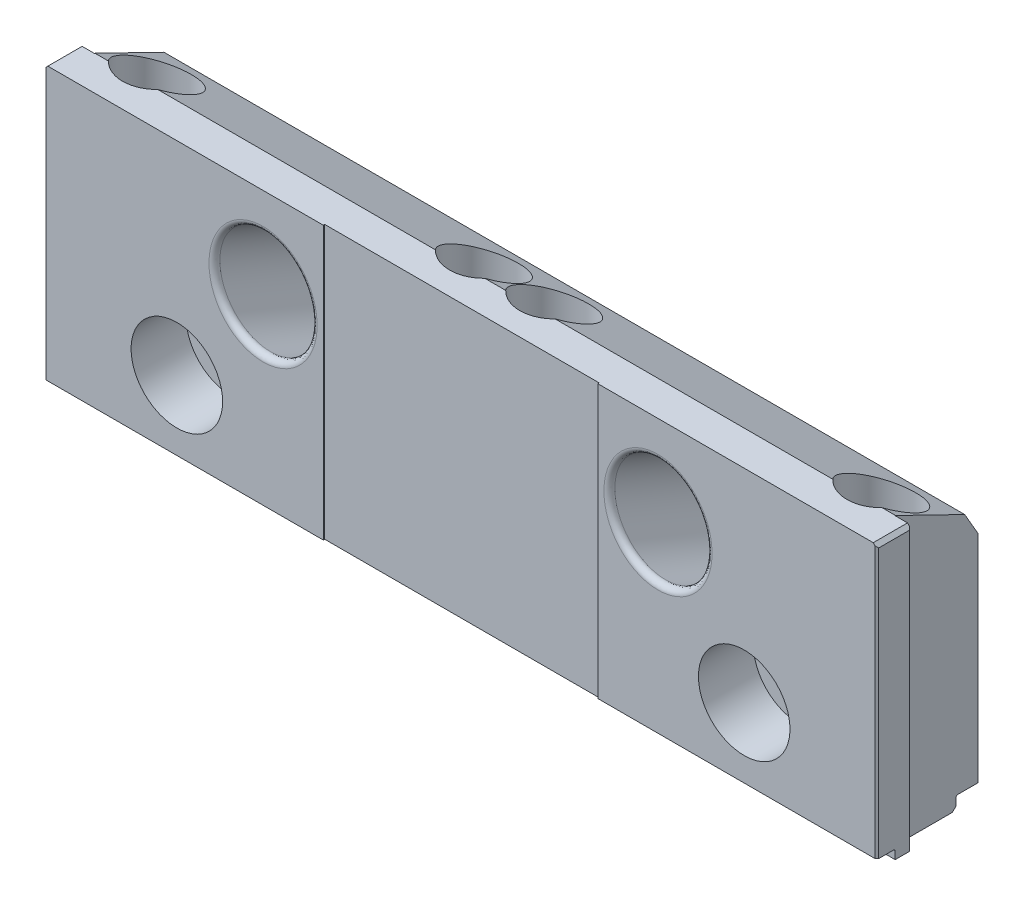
ISO-10303-21;
HEADER;
FILE_DESCRIPTION(('STEP AP214'),'2;1');
FILE_NAME('part.step','',(''),(''),'','','');
FILE_SCHEMA(('AUTOMOTIVE_DESIGN { 1 0 10303 214 1 1 1 1 }'));
ENDSEC;
DATA;
#1=APPLICATION_CONTEXT('core data for automotive mechanical design processes');
#2=APPLICATION_PROTOCOL_DEFINITION('international standard','automotive_design',2000,#1);
#3=PRODUCT_CONTEXT('',#1,'mechanical');
#4=PRODUCT('Part','Part','',(#3));
#5=PRODUCT_RELATED_PRODUCT_CATEGORY('part','',(#4));
#6=PRODUCT_DEFINITION_FORMATION('','',#4);
#7=PRODUCT_DEFINITION_CONTEXT('part definition',#1,'design');
#8=PRODUCT_DEFINITION('design','',#6,#7);
#9=PRODUCT_DEFINITION_SHAPE('','',#8);
#10=(LENGTH_UNIT() NAMED_UNIT(*) SI_UNIT(.MILLI.,.METRE.));
#11=(NAMED_UNIT(*) PLANE_ANGLE_UNIT() SI_UNIT($,.RADIAN.));
#12=(NAMED_UNIT(*) SI_UNIT($,.STERADIAN.) SOLID_ANGLE_UNIT());
#13=UNCERTAINTY_MEASURE_WITH_UNIT(LENGTH_MEASURE(1.E-05),#10,'distance_accuracy_value','');
#14=(GEOMETRIC_REPRESENTATION_CONTEXT(3) GLOBAL_UNCERTAINTY_ASSIGNED_CONTEXT((#13)) GLOBAL_UNIT_ASSIGNED_CONTEXT((#10,
#11,#12)) REPRESENTATION_CONTEXT('',''));
#15=CARTESIAN_POINT('',(0.,0.,0.));
#16=DIRECTION('',(0.,0.,1.));
#17=DIRECTION('',(1.,0.,0.));
#18=AXIS2_PLACEMENT_3D('',#15,#16,#17);
#19=CARTESIAN_POINT('',(57.785,39.624,8.128));
#20=DIRECTION('',(0.,0.,-1.));
#21=DIRECTION('',(0.,1.,0.));
#22=AXIS2_PLACEMENT_3D('',#19,#20,#21);
#23=PLANE('',#22);
#24=CARTESIAN_POINT('',(-39.37,11.43,8.128));
#25=DIRECTION('',(0.,0.,1.));
#26=DIRECTION('',(1.,0.,0.));
#27=AXIS2_PLACEMENT_3D('',#24,#25,#26);
#28=CIRCLE('',#27,6.35);
#29=CARTESIAN_POINT('',(-33.02,11.43,8.128));
#30=VERTEX_POINT('',#29);
#31=EDGE_CURVE('E481',#30,#30,#28,.T.);
#32=ORIENTED_EDGE('',*,*,#31,.F.);
#33=EDGE_LOOP('',(#32));
#34=FACE_BOUND('',#33,.T.);
#35=CARTESIAN_POINT('',(-27.4066,27.1508128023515,8.128));
#36=DIRECTION('',(0.,0.,-1.));
#37=DIRECTION('',(0.,-1.,0.));
#38=AXIS2_PLACEMENT_3D('',#35,#36,#37);
#39=ELLIPSE('',#38,8.15389508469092,7.5057);
#40=CARTESIAN_POINT('',(-27.4066,18.9969177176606,8.128));
#41=VERTEX_POINT('',#40);
#42=EDGE_CURVE('E312',#41,#41,#39,.T.);
#43=ORIENTED_EDGE('',*,*,#42,.T.);
#44=EDGE_LOOP('',(#43));
#45=FACE_BOUND('',#44,.T.);
#46=DIRECTION('',(-1.,0.,0.));
#47=VECTOR('',#46,1.);
#48=CARTESIAN_POINT('',(57.785,1.778,8.128));
#49=LINE('',#48,#47);
#50=CARTESIAN_POINT('',(-19.05,1.778,8.128));
#51=VERTEX_POINT('',#50);
#52=CARTESIAN_POINT('',(-57.531,1.778,8.128));
#53=VERTEX_POINT('',#52);
#54=EDGE_CURVE('E253',#51,#53,#49,.T.);
#55=ORIENTED_EDGE('',*,*,#54,.F.);
#56=DIRECTION('',(0.,-1.,0.));
#57=VECTOR('',#56,1.);
#58=CARTESIAN_POINT('',(-19.05,46.8516803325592,8.128));
#59=LINE('',#58,#57);
#60=CARTESIAN_POINT('',(-19.05,39.624,8.128));
#61=VERTEX_POINT('',#60);
#62=EDGE_CURVE('E241',#61,#51,#59,.T.);
#63=ORIENTED_EDGE('',*,*,#62,.F.);
#64=DIRECTION('',(-1.,0.,0.));
#65=VECTOR('',#64,1.);
#66=CARTESIAN_POINT('',(57.785,39.624,8.128));
#67=LINE('',#66,#65);
#68=CARTESIAN_POINT('',(-57.277,39.624,8.128));
#69=VERTEX_POINT('',#68);
#70=EDGE_CURVE('E250',#61,#69,#67,.T.);
#71=ORIENTED_EDGE('',*,*,#70,.T.);
#72=DIRECTION('',(0.707106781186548,0.707106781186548,0.));
#73=VECTOR('',#72,1.);
#74=CARTESIAN_POINT('',(-57.277,39.624,8.128));
#75=LINE('',#74,#73);
#76=CARTESIAN_POINT('',(-57.531,39.37,8.128));
#77=VERTEX_POINT('',#76);
#78=EDGE_CURVE('E806',#69,#77,#75,.F.);
#79=ORIENTED_EDGE('',*,*,#78,.T.);
#80=DIRECTION('',(0.,-1.,0.));
#81=VECTOR('',#80,1.);
#82=CARTESIAN_POINT('',(-57.531,39.624,8.128));
#83=LINE('',#82,#81);
#84=EDGE_CURVE('E787',#77,#53,#83,.T.);
#85=ORIENTED_EDGE('',*,*,#84,.T.);
#86=EDGE_LOOP('',(#55,#63,#71,#79,#85));
#87=FACE_BOUND('',#86,.T.);
#88=ADVANCED_FACE('F17',(#34,#45,#87),#23,.F.);
#89=CARTESIAN_POINT('',(27.4066,27.1508128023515,8.128));
#90=DIRECTION('',(0.,0.,-1.));
#91=DIRECTION('',(0.,-1.,0.));
#92=AXIS2_PLACEMENT_3D('',#89,#90,#91);
#93=ELLIPSE('',#92,8.15389508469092,7.5057);
#94=CARTESIAN_POINT('',(27.4066,18.9969177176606,8.128));
#95=VERTEX_POINT('',#94);
#96=EDGE_CURVE('E299',#95,#95,#93,.T.);
#97=ORIENTED_EDGE('',*,*,#96,.T.);
#98=EDGE_LOOP('',(#97));
#99=FACE_BOUND('',#98,.T.);
#100=CARTESIAN_POINT('',(57.277,39.624,8.128));
#101=VERTEX_POINT('',#100);
#102=CARTESIAN_POINT('',(19.05,39.624,8.128));
#103=VERTEX_POINT('',#102);
#104=EDGE_CURVE('E261',#101,#103,#67,.T.);
#105=ORIENTED_EDGE('',*,*,#104,.T.);
#106=DIRECTION('',(0.,1.,0.));
#107=VECTOR('',#106,1.);
#108=CARTESIAN_POINT('',(19.05,46.8516803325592,8.128));
#109=LINE('',#108,#107);
#110=CARTESIAN_POINT('',(19.05,1.778,8.128));
#111=VERTEX_POINT('',#110);
#112=EDGE_CURVE('E254',#111,#103,#109,.T.);
#113=ORIENTED_EDGE('',*,*,#112,.F.);
#114=CARTESIAN_POINT('',(57.531,1.778,8.128));
#115=VERTEX_POINT('',#114);
#116=EDGE_CURVE('E262',#115,#111,#49,.T.);
#117=ORIENTED_EDGE('',*,*,#116,.F.);
#118=DIRECTION('',(0.,1.,0.));
#119=VECTOR('',#118,1.);
#120=CARTESIAN_POINT('',(57.531,39.624,8.128));
#121=LINE('',#120,#119);
#122=CARTESIAN_POINT('',(57.531,39.37,8.128));
#123=VERTEX_POINT('',#122);
#124=EDGE_CURVE('E789',#115,#123,#121,.T.);
#125=ORIENTED_EDGE('',*,*,#124,.T.);
#126=DIRECTION('',(-0.707106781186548,0.707106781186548,0.));
#127=VECTOR('',#126,1.);
#128=CARTESIAN_POINT('',(57.785,39.116,8.128));
#129=LINE('',#128,#127);
#130=EDGE_CURVE('E804',#123,#101,#129,.T.);
#131=ORIENTED_EDGE('',*,*,#130,.T.);
#132=EDGE_LOOP('',(#105,#113,#117,#125,#131));
#133=FACE_BOUND('',#132,.T.);
#134=CARTESIAN_POINT('',(39.37,11.43,8.128));
#135=DIRECTION('',(0.,0.,-1.));
#136=DIRECTION('',(-1.,0.,0.));
#137=AXIS2_PLACEMENT_3D('',#134,#135,#136);
#138=CIRCLE('',#137,6.35);
#139=CARTESIAN_POINT('',(33.02,11.43,8.128));
#140=VERTEX_POINT('',#139);
#141=EDGE_CURVE('E627',#140,#140,#138,.T.);
#142=ORIENTED_EDGE('',*,*,#141,.T.);
#143=EDGE_LOOP('',(#142));
#144=FACE_BOUND('',#143,.T.);
#145=ADVANCED_FACE('F331',(#99,#133,#144),#23,.F.);
#146=CARTESIAN_POINT('',(57.785,39.624,3.30883317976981));
#147=DIRECTION('',(0.,-1.,0.));
#148=DIRECTION('',(0.,0.,-1.));
#149=AXIS2_PLACEMENT_3D('',#146,#147,#148);
#150=PLANE('',#149);
#151=ORIENTED_EDGE('',*,*,#70,.F.);
#152=DIRECTION('',(0.,0.,-1.));
#153=VECTOR('',#152,1.);
#154=CARTESIAN_POINT('',(-19.05,39.624,3.30883317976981));
#155=LINE('',#154,#153);
#156=CARTESIAN_POINT('',(-19.05,39.624,7.9375));
#157=VERTEX_POINT('',#156);
#158=EDGE_CURVE('E238',#61,#157,#155,.T.);
#159=ORIENTED_EDGE('',*,*,#158,.T.);
#160=DIRECTION('',(-1.,0.,0.));
#161=VECTOR('',#160,1.);
#162=CARTESIAN_POINT('',(57.785,39.624,7.9375));
#163=LINE('',#162,#161);
#164=CARTESIAN_POINT('',(19.05,39.624,7.9375));
#165=VERTEX_POINT('',#164);
#166=EDGE_CURVE('E613',#165,#157,#163,.T.);
#167=ORIENTED_EDGE('',*,*,#166,.F.);
#168=DIRECTION('',(0.,0.,1.));
#169=VECTOR('',#168,1.);
#170=CARTESIAN_POINT('',(19.05,39.624,3.30883317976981));
#171=LINE('',#170,#169);
#172=EDGE_CURVE('E246',#165,#103,#171,.T.);
#173=ORIENTED_EDGE('',*,*,#172,.T.);
#174=ORIENTED_EDGE('',*,*,#104,.F.);
#175=DIRECTION('',(0.,0.,-1.));
#176=VECTOR('',#175,1.);
#177=CARTESIAN_POINT('',(57.277,39.624,3.62204));
#178=LINE('',#177,#176);
#179=CARTESIAN_POINT('',(57.277,39.624,3.36804));
#180=VERTEX_POINT('',#179);
#181=EDGE_CURVE('E801',#101,#180,#178,.T.);
#182=ORIENTED_EDGE('',*,*,#181,.T.);
#183=DIRECTION('',(1.,0.,0.));
#184=VECTOR('',#183,1.);
#185=CARTESIAN_POINT('',(57.785,39.624,3.36804));
#186=LINE('',#185,#184);
#187=CARTESIAN_POINT('',(55.5625,39.624,3.36804));
#188=VERTEX_POINT('',#187);
#189=EDGE_CURVE('E704',#188,#180,#186,.T.);
#190=ORIENTED_EDGE('',*,*,#189,.F.);
#191=DIRECTION('',(0.,0.,1.));
#192=VECTOR('',#191,1.);
#193=CARTESIAN_POINT('',(55.5625,39.624,3.30883317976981));
#194=LINE('',#193,#192);
#195=CARTESIAN_POINT('',(55.5625,39.624,3.30883317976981));
#196=VERTEX_POINT('',#195);
#197=EDGE_CURVE('E284',#196,#188,#194,.T.);
#198=ORIENTED_EDGE('',*,*,#197,.F.);
#199=DIRECTION('',(-1.,0.,0.));
#200=VECTOR('',#199,1.);
#201=CARTESIAN_POINT('',(57.785,39.624,3.30883317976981));
#202=LINE('',#201,#200);
#203=CARTESIAN_POINT('',(53.691950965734,39.624,3.30883317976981));
#204=VERTEX_POINT('',#203);
#205=EDGE_CURVE('E270',#196,#204,#202,.T.);
#206=ORIENTED_EDGE('',*,*,#205,.T.);
#207=CARTESIAN_POINT('',(50.2666,39.624,0.));
#208=DIRECTION('',(0.,1.,0.));
#209=DIRECTION('',(0.,0.,1.));
#210=AXIS2_PLACEMENT_3D('',#207,#208,#209);
#211=CIRCLE('',#210,4.7625);
#212=CARTESIAN_POINT('',(46.8412490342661,39.624,3.30883317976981));
#213=VERTEX_POINT('',#212);
#214=EDGE_CURVE('E300',#213,#204,#211,.T.);
#215=ORIENTED_EDGE('',*,*,#214,.F.);
#216=CARTESIAN_POINT('',(8.30215096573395,39.624,3.30883317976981));
#217=VERTEX_POINT('',#216);
#218=EDGE_CURVE('E274',#213,#217,#202,.T.);
#219=ORIENTED_EDGE('',*,*,#218,.T.);
#220=CARTESIAN_POINT('',(4.8768,39.624,0.));
#221=DIRECTION('',(0.,1.,0.));
#222=DIRECTION('',(0.,0.,1.));
#223=AXIS2_PLACEMENT_3D('',#220,#221,#222);
#224=CIRCLE('',#223,4.7625);
#225=CARTESIAN_POINT('',(1.45144903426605,39.624,3.30883317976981));
#226=VERTEX_POINT('',#225);
#227=EDGE_CURVE('E295',#226,#217,#224,.T.);
#228=ORIENTED_EDGE('',*,*,#227,.F.);
#229=CARTESIAN_POINT('',(-1.45144903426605,39.624,3.30883317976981));
#230=VERTEX_POINT('',#229);
#231=EDGE_CURVE('E888',#226,#230,#202,.T.);
#232=ORIENTED_EDGE('',*,*,#231,.T.);
#233=CARTESIAN_POINT('',(-4.8768,39.624,0.));
#234=DIRECTION('',(0.,-1.,0.));
#235=DIRECTION('',(0.,0.,-1.));
#236=AXIS2_PLACEMENT_3D('',#233,#234,#235);
#237=CIRCLE('',#236,4.7625);
#238=CARTESIAN_POINT('',(-8.30215096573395,39.624,3.30883317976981));
#239=VERTEX_POINT('',#238);
#240=EDGE_CURVE('E289',#230,#239,#237,.T.);
#241=ORIENTED_EDGE('',*,*,#240,.T.);
#242=CARTESIAN_POINT('',(-46.8412490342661,39.624,3.30883317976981));
#243=VERTEX_POINT('',#242);
#244=EDGE_CURVE('E275',#239,#243,#202,.T.);
#245=ORIENTED_EDGE('',*,*,#244,.T.);
#246=CARTESIAN_POINT('',(-50.2666,39.624,0.));
#247=DIRECTION('',(0.,-1.,0.));
#248=DIRECTION('',(0.,0.,-1.));
#249=AXIS2_PLACEMENT_3D('',#246,#247,#248);
#250=CIRCLE('',#249,4.7625);
#251=CARTESIAN_POINT('',(-53.691950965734,39.624,3.30883317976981));
#252=VERTEX_POINT('',#251);
#253=EDGE_CURVE('E292',#243,#252,#250,.T.);
#254=ORIENTED_EDGE('',*,*,#253,.T.);
#255=CARTESIAN_POINT('',(-55.5625,39.624,3.30883317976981));
#256=VERTEX_POINT('',#255);
#257=EDGE_CURVE('E265',#252,#256,#202,.T.);
#258=ORIENTED_EDGE('',*,*,#257,.T.);
#259=DIRECTION('',(0.,0.,-1.));
#260=VECTOR('',#259,1.);
#261=CARTESIAN_POINT('',(-55.5625,39.624,3.30883317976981));
#262=LINE('',#261,#260);
#263=CARTESIAN_POINT('',(-55.5625,39.624,3.36804));
#264=VERTEX_POINT('',#263);
#265=EDGE_CURVE('E286',#264,#256,#262,.T.);
#266=ORIENTED_EDGE('',*,*,#265,.F.);
#267=CARTESIAN_POINT('',(-57.277,39.624,3.36804));
#268=VERTEX_POINT('',#267);
#269=EDGE_CURVE('E693',#268,#264,#186,.T.);
#270=ORIENTED_EDGE('',*,*,#269,.F.);
#271=DIRECTION('',(0.,0.,1.));
#272=VECTOR('',#271,1.);
#273=CARTESIAN_POINT('',(-57.277,39.624,3.30883317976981));
#274=LINE('',#273,#272);
#275=EDGE_CURVE('E260',#268,#69,#274,.T.);
#276=ORIENTED_EDGE('',*,*,#275,.T.);
#277=EDGE_LOOP('',(#151,#159,#167,#173,#174,#182,#190,#198,#206,#215,#219,#228,#232,#241,#245,
#254,#258,#266,#270,#276));
#278=FACE_BOUND('',#277,.T.);
#279=ADVANCED_FACE('F257',(#278),#150,.F.);
#280=CARTESIAN_POINT('',(57.785,0.,5.588));
#281=DIRECTION('',(0.,1.,0.));
#282=DIRECTION('',(0.,0.,1.));
#283=AXIS2_PLACEMENT_3D('',#280,#281,#282);
#284=PLANE('',#283);
#285=CARTESIAN_POINT('',(50.2666,0.,0.));
#286=DIRECTION('',(0.,1.,0.));
#287=DIRECTION('',(0.,0.,1.));
#288=AXIS2_PLACEMENT_3D('',#285,#286,#287);
#289=CIRCLE('',#288,2.5527);
#290=CARTESIAN_POINT('',(50.2666,0.,2.55270000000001));
#291=VERTEX_POINT('',#290);
#292=EDGE_CURVE('E535',#291,#291,#289,.T.);
#293=ORIENTED_EDGE('',*,*,#292,.T.);
#294=EDGE_LOOP('',(#293));
#295=FACE_BOUND('',#294,.T.);
#296=CARTESIAN_POINT('',(4.8768,0.,0.));
#297=DIRECTION('',(0.,1.,0.));
#298=DIRECTION('',(0.,0.,1.));
#299=AXIS2_PLACEMENT_3D('',#296,#297,#298);
#300=CIRCLE('',#299,2.5527);
#301=CARTESIAN_POINT('',(4.8768,0.,2.55270000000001));
#302=VERTEX_POINT('',#301);
#303=EDGE_CURVE('E539',#302,#302,#300,.T.);
#304=ORIENTED_EDGE('',*,*,#303,.T.);
#305=EDGE_LOOP('',(#304));
#306=FACE_BOUND('',#305,.T.);
#307=CARTESIAN_POINT('',(-50.2666,0.,0.));
#308=DIRECTION('',(0.,1.,0.));
#309=DIRECTION('',(0.,0.,1.));
#310=AXIS2_PLACEMENT_3D('',#307,#308,#309);
#311=CIRCLE('',#310,2.5527);
#312=CARTESIAN_POINT('',(-50.2666,0.,2.55270000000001));
#313=VERTEX_POINT('',#312);
#314=EDGE_CURVE('E543',#313,#313,#311,.T.);
#315=ORIENTED_EDGE('',*,*,#314,.T.);
#316=EDGE_LOOP('',(#315));
#317=FACE_BOUND('',#316,.T.);
#318=CARTESIAN_POINT('',(-4.8768,0.,0.));
#319=DIRECTION('',(0.,1.,0.));
#320=DIRECTION('',(0.,0.,1.));
#321=AXIS2_PLACEMENT_3D('',#318,#319,#320);
#322=CIRCLE('',#321,2.5527);
#323=CARTESIAN_POINT('',(-4.8768,0.,2.55270000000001));
#324=VERTEX_POINT('',#323);
#325=EDGE_CURVE('E547',#324,#324,#322,.T.);
#326=ORIENTED_EDGE('',*,*,#325,.T.);
#327=EDGE_LOOP('',(#326));
#328=FACE_BOUND('',#327,.T.);
#329=DIRECTION('',(-1.,0.,0.));
#330=VECTOR('',#329,1.);
#331=CARTESIAN_POINT('',(57.785,0.,5.08));
#332=LINE('',#331,#330);
#333=CARTESIAN_POINT('',(57.277,0.,5.08));
#334=VERTEX_POINT('',#333);
#335=CARTESIAN_POINT('',(-57.277,0.,5.08));
#336=VERTEX_POINT('',#335);
#337=EDGE_CURVE('E551',#334,#336,#332,.T.);
#338=ORIENTED_EDGE('',*,*,#337,.T.);
#339=DIRECTION('',(0.,0.,-1.));
#340=VECTOR('',#339,1.);
#341=CARTESIAN_POINT('',(-57.277,0.,5.588));
#342=LINE('',#341,#340);
#343=CARTESIAN_POINT('',(-57.277,0.,3.36804));
#344=VERTEX_POINT('',#343);
#345=EDGE_CURVE('E554',#336,#344,#342,.T.);
#346=ORIENTED_EDGE('',*,*,#345,.T.);
#347=DIRECTION('',(-1.,0.,0.));
#348=VECTOR('',#347,1.);
#349=CARTESIAN_POINT('',(57.785,0.,3.36804));
#350=LINE('',#349,#348);
#351=CARTESIAN_POINT('',(-55.5625,0.,3.36804));
#352=VERTEX_POINT('',#351);
#353=EDGE_CURVE('E703',#352,#344,#350,.T.);
#354=ORIENTED_EDGE('',*,*,#353,.F.);
#355=DIRECTION('',(0.,0.,1.));
#356=VECTOR('',#355,1.);
#357=CARTESIAN_POINT('',(-55.5625,0.,5.588));
#358=LINE('',#357,#356);
#359=CARTESIAN_POINT('',(-55.5625,0.,-4.572));
#360=VERTEX_POINT('',#359);
#361=EDGE_CURVE('E728',#360,#352,#358,.T.);
#362=ORIENTED_EDGE('',*,*,#361,.F.);
#363=DIRECTION('',(1.,0.,0.));
#364=VECTOR('',#363,1.);
#365=CARTESIAN_POINT('',(57.785,0.,-4.572));
#366=LINE('',#365,#364);
#367=CARTESIAN_POINT('',(55.5625,0.,-4.572));
#368=VERTEX_POINT('',#367);
#369=EDGE_CURVE('E561',#360,#368,#366,.T.);
#370=ORIENTED_EDGE('',*,*,#369,.T.);
#371=DIRECTION('',(0.,0.,-1.));
#372=VECTOR('',#371,1.);
#373=CARTESIAN_POINT('',(55.5625,0.,5.588));
#374=LINE('',#373,#372);
#375=CARTESIAN_POINT('',(55.5625,0.,3.36804));
#376=VERTEX_POINT('',#375);
#377=EDGE_CURVE('E715',#376,#368,#374,.T.);
#378=ORIENTED_EDGE('',*,*,#377,.F.);
#379=CARTESIAN_POINT('',(57.277,0.,3.36804));
#380=VERTEX_POINT('',#379);
#381=EDGE_CURVE('E706',#380,#376,#350,.T.);
#382=ORIENTED_EDGE('',*,*,#381,.F.);
#383=DIRECTION('',(0.,0.,1.));
#384=VECTOR('',#383,1.);
#385=CARTESIAN_POINT('',(57.277,0.,5.08));
#386=LINE('',#385,#384);
#387=EDGE_CURVE('E558',#380,#334,#386,.T.);
#388=ORIENTED_EDGE('',*,*,#387,.T.);
#389=EDGE_LOOP('',(#338,#346,#354,#362,#370,#378,#382,#388));
#390=FACE_BOUND('',#389,.T.);
#391=ADVANCED_FACE('F525',(#295,#306,#317,#328,#390),#284,.F.);
#392=CARTESIAN_POINT('',(57.785,0.,-5.08));
#393=DIRECTION('',(0.,0.,1.));
#394=DIRECTION('',(0.,-1.,0.));
#395=AXIS2_PLACEMENT_3D('',#392,#393,#394);
#396=PLANE('',#395);
#397=DIRECTION('',(0.,1.,0.));
#398=VECTOR('',#397,1.);
#399=CARTESIAN_POINT('',(55.5625,0.,-5.08));
#400=LINE('',#399,#398);
#401=CARTESIAN_POINT('',(55.5625,0.508,-5.08));
#402=VERTEX_POINT('',#401);
#403=CARTESIAN_POINT('',(55.5625,1.524,-5.08));
#404=VERTEX_POINT('',#403);
#405=EDGE_CURVE('E713',#402,#404,#400,.T.);
#406=ORIENTED_EDGE('',*,*,#405,.F.);
#407=DIRECTION('',(-1.,0.,0.));
#408=VECTOR('',#407,1.);
#409=CARTESIAN_POINT('',(57.785,0.507999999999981,-5.08));
#410=LINE('',#409,#408);
#411=CARTESIAN_POINT('',(-55.5625,0.508000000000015,-5.08));
#412=VERTEX_POINT('',#411);
#413=EDGE_CURVE('E769',#402,#412,#410,.T.);
#414=ORIENTED_EDGE('',*,*,#413,.T.);
#415=DIRECTION('',(0.,-1.,0.));
#416=VECTOR('',#415,1.);
#417=CARTESIAN_POINT('',(-55.5625,0.,-5.08));
#418=LINE('',#417,#416);
#419=CARTESIAN_POINT('',(-55.5625,1.524,-5.08));
#420=VERTEX_POINT('',#419);
#421=EDGE_CURVE('E725',#420,#412,#418,.T.);
#422=ORIENTED_EDGE('',*,*,#421,.F.);
#423=DIRECTION('',(-1.,0.,0.));
#424=VECTOR('',#423,1.);
#425=CARTESIAN_POINT('',(55.5625,1.524,-5.08));
#426=LINE('',#425,#424);
#427=EDGE_CURVE('E755',#420,#404,#426,.F.);
#428=ORIENTED_EDGE('',*,*,#427,.T.);
#429=EDGE_LOOP('',(#406,#414,#422,#428));
#430=FACE_BOUND('',#429,.T.);
#431=ADVANCED_FACE('F522',(#430),#396,.F.);
#432=CARTESIAN_POINT('',(57.785,1.778,-5.08));
#433=DIRECTION('',(0.,1.,0.));
#434=DIRECTION('',(0.,0.,1.));
#435=AXIS2_PLACEMENT_3D('',#432,#433,#434);
#436=PLANE('',#435);
#437=DIRECTION('',(0.,0.,-1.));
#438=VECTOR('',#437,1.);
#439=CARTESIAN_POINT('',(55.5625,1.778,-5.08));
#440=LINE('',#439,#438);
#441=CARTESIAN_POINT('',(55.5625,1.778,-5.334));
#442=VERTEX_POINT('',#441);
#443=CARTESIAN_POINT('',(55.5625,1.778,-8.128));
#444=VERTEX_POINT('',#443);
#445=EDGE_CURVE('E711',#442,#444,#440,.T.);
#446=ORIENTED_EDGE('',*,*,#445,.F.);
#447=DIRECTION('',(-1.,0.,0.));
#448=VECTOR('',#447,1.);
#449=CARTESIAN_POINT('',(-55.5625,1.778,-5.334));
#450=LINE('',#449,#448);
#451=CARTESIAN_POINT('',(-55.5625,1.778,-5.334));
#452=VERTEX_POINT('',#451);
#453=EDGE_CURVE('E757',#442,#452,#450,.T.);
#454=ORIENTED_EDGE('',*,*,#453,.T.);
#455=DIRECTION('',(0.,0.,1.));
#456=VECTOR('',#455,1.);
#457=CARTESIAN_POINT('',(-55.5625,1.778,-5.08));
#458=LINE('',#457,#456);
#459=CARTESIAN_POINT('',(-55.5625,1.778,-8.128));
#460=VERTEX_POINT('',#459);
#461=EDGE_CURVE('E722',#460,#452,#458,.T.);
#462=ORIENTED_EDGE('',*,*,#461,.F.);
#463=DIRECTION('',(-1.,0.,0.));
#464=VECTOR('',#463,1.);
#465=CARTESIAN_POINT('',(57.785,1.778,-8.128));
#466=LINE('',#465,#464);
#467=EDGE_CURVE('E281',#444,#460,#466,.T.);
#468=ORIENTED_EDGE('',*,*,#467,.F.);
#469=EDGE_LOOP('',(#446,#454,#462,#468));
#470=FACE_BOUND('',#469,.T.);
#471=ADVANCED_FACE('F516',(#470),#436,.F.);
#472=CARTESIAN_POINT('',(57.785,1.778,-8.128));
#473=DIRECTION('',(0.,0.,1.));
#474=DIRECTION('',(1.,0.,0.));
#475=AXIS2_PLACEMENT_3D('',#472,#473,#474);
#476=PLANE('',#475);
#477=CARTESIAN_POINT('',(-27.4066,20.8974498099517,-8.128));
#478=DIRECTION('',(0.,0.,1.));
#479=DIRECTION('',(0.,-1.,0.));
#480=AXIS2_PLACEMENT_3D('',#477,#478,#479);
#481=ELLIPSE('',#480,8.15389508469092,7.5057);
#482=CARTESIAN_POINT('',(-27.4066,12.7435547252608,-8.128));
#483=VERTEX_POINT('',#482);
#484=EDGE_CURVE('E492',#483,#483,#481,.T.);
#485=ORIENTED_EDGE('',*,*,#484,.T.);
#486=EDGE_LOOP('',(#485));
#487=FACE_BOUND('',#486,.T.);
#488=CARTESIAN_POINT('',(27.4066,20.8974498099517,-8.128));
#489=DIRECTION('',(0.,0.,1.));
#490=DIRECTION('',(0.,-1.,0.));
#491=AXIS2_PLACEMENT_3D('',#488,#489,#490);
#492=ELLIPSE('',#491,8.15389508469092,7.5057);
#493=CARTESIAN_POINT('',(27.4066,12.7435547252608,-8.128));
#494=VERTEX_POINT('',#493);
#495=EDGE_CURVE('E309',#494,#494,#492,.T.);
#496=ORIENTED_EDGE('',*,*,#495,.T.);
#497=EDGE_LOOP('',(#496));
#498=FACE_BOUND('',#497,.T.);
#499=DIRECTION('',(0.,1.,0.));
#500=VECTOR('',#499,1.);
#501=CARTESIAN_POINT('',(-55.5625,47.8920709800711,-8.128));
#502=LINE('',#501,#500);
#503=CARTESIAN_POINT('',(-55.5625,31.75,-8.128));
#504=VERTEX_POINT('',#503);
#505=EDGE_CURVE('E697',#460,#504,#502,.T.);
#506=ORIENTED_EDGE('',*,*,#505,.T.);
#507=DIRECTION('',(-1.,0.,0.));
#508=VECTOR('',#507,1.);
#509=CARTESIAN_POINT('',(57.785,31.75,-8.128));
#510=LINE('',#509,#508);
#511=CARTESIAN_POINT('',(55.5625,31.75,-8.128));
#512=VERTEX_POINT('',#511);
#513=EDGE_CURVE('E278',#512,#504,#510,.T.);
#514=ORIENTED_EDGE('',*,*,#513,.F.);
#515=DIRECTION('',(0.,-1.,0.));
#516=VECTOR('',#515,1.);
#517=CARTESIAN_POINT('',(55.5625,47.892070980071,-8.128));
#518=LINE('',#517,#516);
#519=EDGE_CURVE('E689',#512,#444,#518,.T.);
#520=ORIENTED_EDGE('',*,*,#519,.T.);
#521=ORIENTED_EDGE('',*,*,#467,.T.);
#522=EDGE_LOOP('',(#506,#514,#520,#521));
#523=FACE_BOUND('',#522,.T.);
#524=ADVANCED_FACE('F510',(#487,#498,#523),#476,.F.);
#525=CARTESIAN_POINT('',(57.785,34.9457960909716,-6.28290626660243));
#526=DIRECTION('',(0.,-0.5,0.866025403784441));
#527=DIRECTION('',(0.,-0.866025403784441,-0.5));
#528=AXIS2_PLACEMENT_3D('',#525,#526,#527);
#529=PLANE('',#528);
#530=DIRECTION('',(0.,-0.866025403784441,-0.5));
#531=VECTOR('',#530,1.);
#532=CARTESIAN_POINT('',(-55.5625,34.9457960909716,-6.28290626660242));
#533=LINE('',#532,#531);
#534=CARTESIAN_POINT('',(-55.5625,34.9457960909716,-6.28290626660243));
#535=VERTEX_POINT('',#534);
#536=EDGE_CURVE('E720',#535,#504,#533,.T.);
#537=ORIENTED_EDGE('',*,*,#536,.F.);
#538=DIRECTION('',(-1.,0.,0.));
#539=VECTOR('',#538,1.);
#540=CARTESIAN_POINT('',(57.785,34.9457960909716,-6.28290626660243));
#541=LINE('',#540,#539);
#542=CARTESIAN_POINT('',(55.5625,34.9457960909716,-6.28290626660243));
#543=VERTEX_POINT('',#542);
#544=EDGE_CURVE('E273',#543,#535,#541,.T.);
#545=ORIENTED_EDGE('',*,*,#544,.F.);
#546=DIRECTION('',(0.,0.866025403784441,0.5));
#547=VECTOR('',#546,1.);
#548=CARTESIAN_POINT('',(55.5625,34.9457960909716,-6.28290626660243));
#549=LINE('',#548,#547);
#550=EDGE_CURVE('E709',#512,#543,#549,.T.);
#551=ORIENTED_EDGE('',*,*,#550,.F.);
#552=ORIENTED_EDGE('',*,*,#513,.T.);
#553=EDGE_LOOP('',(#537,#545,#551,#552));
#554=FACE_BOUND('',#553,.T.);
#555=ADVANCED_FACE('F515',(#554),#529,.F.);
#556=CARTESIAN_POINT('',(57.785,34.9457960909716,-6.28290626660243));
#557=DIRECTION('',(0.,-0.898794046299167,0.438371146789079));
#558=DIRECTION('',(0.,-0.438371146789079,-0.898794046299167));
#559=AXIS2_PLACEMENT_3D('',#556,#557,#558);
#560=PLANE('',#559);
#561=ORIENTED_EDGE('',*,*,#218,.F.);
#562=CARTESIAN_POINT('',(50.2666,38.0101742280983,0.));
#563=DIRECTION('',(0.,-0.898794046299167,0.438371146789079));
#564=DIRECTION('',(0.,0.438371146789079,0.898794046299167));
#565=AXIS2_PLACEMENT_3D('',#562,#563,#564);
#566=ELLIPSE('',#565,5.29876674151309,4.7625);
#567=EDGE_CURVE('E296',#213,#204,#566,.T.);
#568=ORIENTED_EDGE('',*,*,#567,.T.);
#569=ORIENTED_EDGE('',*,*,#205,.F.);
#570=DIRECTION('',(0.,0.438371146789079,0.898794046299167));
#571=VECTOR('',#570,1.);
#572=CARTESIAN_POINT('',(55.5625,34.9457960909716,-6.28290626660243));
#573=LINE('',#572,#571);
#574=EDGE_CURVE('E707',#543,#196,#573,.T.);
#575=ORIENTED_EDGE('',*,*,#574,.F.);
#576=ORIENTED_EDGE('',*,*,#544,.T.);
#577=DIRECTION('',(0.,-0.438371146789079,-0.898794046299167));
#578=VECTOR('',#577,1.);
#579=CARTESIAN_POINT('',(-55.5625,34.9457960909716,-6.28290626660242));
#580=LINE('',#579,#578);
#581=EDGE_CURVE('E718',#256,#535,#580,.T.);
#582=ORIENTED_EDGE('',*,*,#581,.F.);
#583=ORIENTED_EDGE('',*,*,#257,.F.);
#584=CARTESIAN_POINT('',(-50.2666,38.0101742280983,0.));
#585=DIRECTION('',(0.,-0.898794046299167,0.438371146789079));
#586=DIRECTION('',(0.,0.438371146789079,0.898794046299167));
#587=AXIS2_PLACEMENT_3D('',#584,#585,#586);
#588=ELLIPSE('',#587,5.29876674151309,4.7625);
#589=EDGE_CURVE('E676',#252,#243,#588,.T.);
#590=ORIENTED_EDGE('',*,*,#589,.T.);
#591=ORIENTED_EDGE('',*,*,#244,.F.);
#592=CARTESIAN_POINT('',(-4.8768,38.0101742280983,0.));
#593=DIRECTION('',(0.,-0.898794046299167,0.438371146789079));
#594=DIRECTION('',(0.,0.438371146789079,0.898794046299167));
#595=AXIS2_PLACEMENT_3D('',#592,#593,#594);
#596=ELLIPSE('',#595,5.29876674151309,4.7625);
#597=EDGE_CURVE('E686',#239,#230,#596,.T.);
#598=ORIENTED_EDGE('',*,*,#597,.T.);
#599=ORIENTED_EDGE('',*,*,#231,.F.);
#600=CARTESIAN_POINT('',(4.8768,38.0101742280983,0.));
#601=DIRECTION('',(0.,-0.898794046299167,0.438371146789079));
#602=DIRECTION('',(0.,0.438371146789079,0.898794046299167));
#603=AXIS2_PLACEMENT_3D('',#600,#601,#602);
#604=ELLIPSE('',#603,5.29876674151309,4.7625);
#605=EDGE_CURVE('E664',#226,#217,#604,.T.);
#606=ORIENTED_EDGE('',*,*,#605,.T.);
#607=EDGE_LOOP('',(#561,#568,#569,#575,#576,#582,#583,#590,#591,#598,#599,#606));
#608=FACE_BOUND('',#607,.T.);
#609=ADVANCED_FACE('F457',(#608),#560,.F.);
#610=CARTESIAN_POINT('',(57.785,1.778,5.588));
#611=DIRECTION('',(1.,0.,0.));
#612=DIRECTION('',(0.,0.,-1.));
#613=AXIS2_PLACEMENT_3D('',#610,#611,#612);
#614=PLANE('',#613);
#615=DIRECTION('',(0.,-1.,0.));
#616=VECTOR('',#615,1.);
#617=CARTESIAN_POINT('',(57.785,1.778,5.588));
#618=LINE('',#617,#616);
#619=CARTESIAN_POINT('',(57.785,1.524,5.588));
#620=VERTEX_POINT('',#619);
#621=CARTESIAN_POINT('',(57.785,0.508,5.588));
#622=VERTEX_POINT('',#621);
#623=EDGE_CURVE('E731',#620,#622,#618,.T.);
#624=ORIENTED_EDGE('',*,*,#623,.T.);
#625=DIRECTION('',(0.,0.,-1.));
#626=VECTOR('',#625,1.);
#627=CARTESIAN_POINT('',(57.785,0.507999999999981,3.62204));
#628=LINE('',#627,#626);
#629=CARTESIAN_POINT('',(57.785,0.507999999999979,3.62204));
#630=VERTEX_POINT('',#629);
#631=EDGE_CURVE('E582',#622,#630,#628,.T.);
#632=ORIENTED_EDGE('',*,*,#631,.T.);
#633=DIRECTION('',(0.,1.,0.));
#634=VECTOR('',#633,1.);
#635=CARTESIAN_POINT('',(57.785,1.778,3.62204));
#636=LINE('',#635,#634);
#637=CARTESIAN_POINT('',(57.785,39.116,3.62204));
#638=VERTEX_POINT('',#637);
#639=EDGE_CURVE('E779',#630,#638,#636,.T.);
#640=ORIENTED_EDGE('',*,*,#639,.T.);
#641=DIRECTION('',(0.,0.,1.));
#642=VECTOR('',#641,1.);
#643=CARTESIAN_POINT('',(57.785,39.116,7.874));
#644=LINE('',#643,#642);
#645=CARTESIAN_POINT('',(57.785,39.116,7.874));
#646=VERTEX_POINT('',#645);
#647=EDGE_CURVE('E579',#638,#646,#644,.T.);
#648=ORIENTED_EDGE('',*,*,#647,.T.);
#649=DIRECTION('',(0.,-1.,0.));
#650=VECTOR('',#649,1.);
#651=CARTESIAN_POINT('',(57.785,1.778,7.874));
#652=LINE('',#651,#650);
#653=CARTESIAN_POINT('',(57.785,1.778,7.874));
#654=VERTEX_POINT('',#653);
#655=EDGE_CURVE('E782',#646,#654,#652,.T.);
#656=ORIENTED_EDGE('',*,*,#655,.T.);
#657=DIRECTION('',(0.,0.,-1.));
#658=VECTOR('',#657,1.);
#659=CARTESIAN_POINT('',(57.785,1.778,8.128));
#660=LINE('',#659,#658);
#661=CARTESIAN_POINT('',(57.785,1.778,5.842));
#662=VERTEX_POINT('',#661);
#663=EDGE_CURVE('E734',#654,#662,#660,.T.);
#664=ORIENTED_EDGE('',*,*,#663,.T.);
#665=CARTESIAN_POINT('',(57.785,1.524,5.842));
#666=DIRECTION('',(1.,0.,0.));
#667=DIRECTION('',(0.,0.,-1.));
#668=AXIS2_PLACEMENT_3D('',#665,#666,#667);
#669=CIRCLE('',#668,0.254);
#670=EDGE_CURVE('E754',#662,#620,#669,.F.);
#671=ORIENTED_EDGE('',*,*,#670,.T.);
#672=EDGE_LOOP('',(#624,#632,#640,#648,#656,#664,#671));
#673=FACE_BOUND('',#672,.T.);
#674=ADVANCED_FACE('F453',(#673),#614,.T.);
#675=CARTESIAN_POINT('',(-57.785,1.778,5.588));
#676=DIRECTION('',(1.,0.,0.));
#677=DIRECTION('',(0.,0.,-1.));
#678=AXIS2_PLACEMENT_3D('',#675,#676,#677);
#679=PLANE('',#678);
#680=DIRECTION('',(0.,1.,0.));
#681=VECTOR('',#680,1.);
#682=CARTESIAN_POINT('',(-57.785,1.778,7.874));
#683=LINE('',#682,#681);
#684=CARTESIAN_POINT('',(-57.785,1.778,7.874));
#685=VERTEX_POINT('',#684);
#686=CARTESIAN_POINT('',(-57.785,39.116,7.874));
#687=VERTEX_POINT('',#686);
#688=EDGE_CURVE('E796',#685,#687,#683,.T.);
#689=ORIENTED_EDGE('',*,*,#688,.T.);
#690=DIRECTION('',(0.,0.,-1.));
#691=VECTOR('',#690,1.);
#692=CARTESIAN_POINT('',(-57.785,39.116,5.588));
#693=LINE('',#692,#691);
#694=CARTESIAN_POINT('',(-57.785,39.116,3.62204));
#695=VERTEX_POINT('',#694);
#696=EDGE_CURVE('E812',#687,#695,#693,.T.);
#697=ORIENTED_EDGE('',*,*,#696,.T.);
#698=DIRECTION('',(0.,-1.,0.));
#699=VECTOR('',#698,1.);
#700=CARTESIAN_POINT('',(-57.785,0.,3.62204));
#701=LINE('',#700,#699);
#702=CARTESIAN_POINT('',(-57.785,0.508000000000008,3.62204));
#703=VERTEX_POINT('',#702);
#704=EDGE_CURVE('E793',#695,#703,#701,.T.);
#705=ORIENTED_EDGE('',*,*,#704,.T.);
#706=DIRECTION('',(0.,0.,1.));
#707=VECTOR('',#706,1.);
#708=CARTESIAN_POINT('',(-57.785,0.508000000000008,5.588));
#709=LINE('',#708,#707);
#710=CARTESIAN_POINT('',(-57.785,0.508,5.588));
#711=VERTEX_POINT('',#710);
#712=EDGE_CURVE('E810',#703,#711,#709,.T.);
#713=ORIENTED_EDGE('',*,*,#712,.T.);
#714=DIRECTION('',(0.,-1.,0.));
#715=VECTOR('',#714,1.);
#716=CARTESIAN_POINT('',(-57.785,1.778,5.588));
#717=LINE('',#716,#715);
#718=CARTESIAN_POINT('',(-57.785,1.524,5.588));
#719=VERTEX_POINT('',#718);
#720=EDGE_CURVE('E730',#719,#711,#717,.T.);
#721=ORIENTED_EDGE('',*,*,#720,.F.);
#722=CARTESIAN_POINT('',(-57.785,1.524,5.842));
#723=DIRECTION('',(1.,0.,0.));
#724=DIRECTION('',(0.,0.,-1.));
#725=AXIS2_PLACEMENT_3D('',#722,#723,#724);
#726=CIRCLE('',#725,0.254);
#727=CARTESIAN_POINT('',(-57.785,1.778,5.842));
#728=VERTEX_POINT('',#727);
#729=EDGE_CURVE('E750',#719,#728,#726,.T.);
#730=ORIENTED_EDGE('',*,*,#729,.T.);
#731=DIRECTION('',(0.,0.,-1.));
#732=VECTOR('',#731,1.);
#733=CARTESIAN_POINT('',(-57.785,1.778,8.128));
#734=LINE('',#733,#732);
#735=EDGE_CURVE('E735',#685,#728,#734,.T.);
#736=ORIENTED_EDGE('',*,*,#735,.F.);
#737=EDGE_LOOP('',(#689,#697,#705,#713,#721,#730,#736));
#738=FACE_BOUND('',#737,.T.);
#739=ADVANCED_FACE('F456',(#738),#679,.F.);
#740=CARTESIAN_POINT('',(57.785,1.778,5.588));
#741=DIRECTION('',(0.,0.,-1.));
#742=DIRECTION('',(0.,1.,0.));
#743=AXIS2_PLACEMENT_3D('',#740,#741,#742);
#744=PLANE('',#743);
#745=ORIENTED_EDGE('',*,*,#720,.T.);
#746=DIRECTION('',(1.,0.,0.));
#747=VECTOR('',#746,1.);
#748=CARTESIAN_POINT('',(57.785,0.508,5.588));
#749=LINE('',#748,#747);
#750=EDGE_CURVE('E776',#711,#622,#749,.T.);
#751=ORIENTED_EDGE('',*,*,#750,.T.);
#752=ORIENTED_EDGE('',*,*,#623,.F.);
#753=DIRECTION('',(-1.,0.,0.));
#754=VECTOR('',#753,1.);
#755=CARTESIAN_POINT('',(-57.785,1.524,5.588));
#756=LINE('',#755,#754);
#757=EDGE_CURVE('E495',#620,#719,#756,.T.);
#758=ORIENTED_EDGE('',*,*,#757,.T.);
#759=EDGE_LOOP('',(#745,#751,#752,#758));
#760=FACE_BOUND('',#759,.T.);
#761=ADVANCED_FACE('F327',(#760),#744,.F.);
#762=CARTESIAN_POINT('',(57.785,1.778,8.128));
#763=DIRECTION('',(0.,1.,0.));
#764=DIRECTION('',(0.,0.,1.));
#765=AXIS2_PLACEMENT_3D('',#762,#763,#764);
#766=PLANE('',#765);
#767=DIRECTION('',(1.,0.,0.));
#768=VECTOR('',#767,1.);
#769=CARTESIAN_POINT('',(57.785,1.778,7.9375));
#770=LINE('',#769,#768);
#771=CARTESIAN_POINT('',(-19.05,1.778,7.9375));
#772=VERTEX_POINT('',#771);
#773=CARTESIAN_POINT('',(19.05,1.778,7.9375));
#774=VERTEX_POINT('',#773);
#775=EDGE_CURVE('E594',#772,#774,#770,.T.);
#776=ORIENTED_EDGE('',*,*,#775,.F.);
#777=DIRECTION('',(0.,0.,1.));
#778=VECTOR('',#777,1.);
#779=CARTESIAN_POINT('',(-19.05,1.778,8.128));
#780=LINE('',#779,#778);
#781=EDGE_CURVE('E10',#772,#51,#780,.T.);
#782=ORIENTED_EDGE('',*,*,#781,.T.);
#783=ORIENTED_EDGE('',*,*,#54,.T.);
#784=DIRECTION('',(0.707106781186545,0.,0.70710678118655));
#785=VECTOR('',#784,1.);
#786=CARTESIAN_POINT('',(-57.531,1.778,8.128));
#787=LINE('',#786,#785);
#788=EDGE_CURVE('E746',#53,#685,#787,.F.);
#789=ORIENTED_EDGE('',*,*,#788,.T.);
#790=ORIENTED_EDGE('',*,*,#735,.T.);
#791=DIRECTION('',(-1.,0.,0.));
#792=VECTOR('',#791,1.);
#793=CARTESIAN_POINT('',(57.785,1.778,5.842));
#794=LINE('',#793,#792);
#795=EDGE_CURVE('E743',#728,#662,#794,.F.);
#796=ORIENTED_EDGE('',*,*,#795,.T.);
#797=ORIENTED_EDGE('',*,*,#663,.F.);
#798=DIRECTION('',(-0.707106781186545,0.,0.70710678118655));
#799=VECTOR('',#798,1.);
#800=CARTESIAN_POINT('',(57.785,1.778,7.874));
#801=LINE('',#800,#799);
#802=EDGE_CURVE('E785',#654,#115,#801,.T.);
#803=ORIENTED_EDGE('',*,*,#802,.T.);
#804=ORIENTED_EDGE('',*,*,#116,.T.);
#805=DIRECTION('',(0.,0.,-1.));
#806=VECTOR('',#805,1.);
#807=CARTESIAN_POINT('',(19.05,1.778,8.128));
#808=LINE('',#807,#806);
#809=EDGE_CURVE('E25',#111,#774,#808,.T.);
#810=ORIENTED_EDGE('',*,*,#809,.T.);
#811=EDGE_LOOP('',(#776,#782,#783,#789,#790,#796,#797,#803,#804,#810));
#812=FACE_BOUND('',#811,.T.);
#813=ADVANCED_FACE('F461',(#812),#766,.F.);
#814=CARTESIAN_POINT('',(57.785,39.624,3.36804));
#815=DIRECTION('',(0.,0.,-1.));
#816=DIRECTION('',(0.,1.,0.));
#817=AXIS2_PLACEMENT_3D('',#814,#815,#816);
#818=PLANE('',#817);
#819=DIRECTION('',(0.,1.,0.));
#820=VECTOR('',#819,1.);
#821=CARTESIAN_POINT('',(-57.531,39.624,3.36804));
#822=LINE('',#821,#820);
#823=CARTESIAN_POINT('',(-57.531,0.253999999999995,3.36804));
#824=VERTEX_POINT('',#823);
#825=CARTESIAN_POINT('',(-57.531,39.37,3.36804));
#826=VERTEX_POINT('',#825);
#827=EDGE_CURVE('E798',#824,#826,#822,.T.);
#828=ORIENTED_EDGE('',*,*,#827,.T.);
#829=DIRECTION('',(-0.707106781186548,-0.707106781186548,0.));
#830=VECTOR('',#829,1.);
#831=CARTESIAN_POINT('',(0.254000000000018,97.155,3.36804));
#832=LINE('',#831,#830);
#833=EDGE_CURVE('E574',#826,#268,#832,.F.);
#834=ORIENTED_EDGE('',*,*,#833,.T.);
#835=ORIENTED_EDGE('',*,*,#269,.T.);
#836=DIRECTION('',(0.,-1.,0.));
#837=VECTOR('',#836,1.);
#838=CARTESIAN_POINT('',(-55.5625,47.8920709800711,3.36804));
#839=LINE('',#838,#837);
#840=EDGE_CURVE('E690',#264,#352,#839,.T.);
#841=ORIENTED_EDGE('',*,*,#840,.T.);
#842=ORIENTED_EDGE('',*,*,#353,.T.);
#843=DIRECTION('',(0.707106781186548,-0.707106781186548,0.));
#844=VECTOR('',#843,1.);
#845=CARTESIAN_POINT('',(-19.558,-37.719,3.36804));
#846=LINE('',#845,#844);
#847=EDGE_CURVE('E570',#344,#824,#846,.F.);
#848=ORIENTED_EDGE('',*,*,#847,.T.);
#849=EDGE_LOOP('',(#828,#834,#835,#841,#842,#848));
#850=FACE_BOUND('',#849,.T.);
#851=ADVANCED_FACE('F445',(#850),#818,.T.);
#852=CARTESIAN_POINT('',(-55.5625,47.8920709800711,140.984450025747));
#853=DIRECTION('',(-1.,0.,0.));
#854=DIRECTION('',(0.,-1.,0.));
#855=AXIS2_PLACEMENT_3D('',#852,#853,#854);
#856=PLANE('',#855);
#857=ORIENTED_EDGE('',*,*,#421,.T.);
#858=DIRECTION('',(0.,0.707106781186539,-0.707106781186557));
#859=VECTOR('',#858,1.);
#860=CARTESIAN_POINT('',(-55.5625,-48.8321895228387,44.2601895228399));
#861=LINE('',#860,#859);
#862=EDGE_CURVE('E562',#412,#360,#861,.F.);
#863=ORIENTED_EDGE('',*,*,#862,.T.);
#864=ORIENTED_EDGE('',*,*,#361,.T.);
#865=ORIENTED_EDGE('',*,*,#840,.F.);
#866=ORIENTED_EDGE('',*,*,#265,.T.);
#867=ORIENTED_EDGE('',*,*,#581,.T.);
#868=ORIENTED_EDGE('',*,*,#536,.T.);
#869=ORIENTED_EDGE('',*,*,#505,.F.);
#870=ORIENTED_EDGE('',*,*,#461,.T.);
#871=CARTESIAN_POINT('',(-55.5625,1.524,-5.334));
#872=DIRECTION('',(-1.,0.,0.));
#873=DIRECTION('',(0.,-1.,0.));
#874=AXIS2_PLACEMENT_3D('',#871,#872,#873);
#875=CIRCLE('',#874,0.254);
#876=EDGE_CURVE('E765',#452,#420,#875,.F.);
#877=ORIENTED_EDGE('',*,*,#876,.T.);
#878=EDGE_LOOP('',(#857,#863,#864,#865,#866,#867,#868,#869,#870,#877));
#879=FACE_BOUND('',#878,.T.);
#880=ADVANCED_FACE('F446',(#879),#856,.T.);
#881=CARTESIAN_POINT('',(55.5625,47.892070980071,140.984450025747));
#882=DIRECTION('',(1.,0.,0.));
#883=DIRECTION('',(0.,1.,0.));
#884=AXIS2_PLACEMENT_3D('',#881,#882,#883);
#885=PLANE('',#884);
#886=ORIENTED_EDGE('',*,*,#377,.T.);
#887=DIRECTION('',(0.,-0.707106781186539,0.707106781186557));
#888=VECTOR('',#887,1.);
#889=CARTESIAN_POINT('',(55.5625,-48.8321895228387,44.2601895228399));
#890=LINE('',#889,#888);
#891=EDGE_CURVE('E774',#368,#402,#890,.F.);
#892=ORIENTED_EDGE('',*,*,#891,.T.);
#893=ORIENTED_EDGE('',*,*,#405,.T.);
#894=CARTESIAN_POINT('',(55.5625,1.524,-5.334));
#895=DIRECTION('',(1.,0.,0.));
#896=DIRECTION('',(0.,1.,0.));
#897=AXIS2_PLACEMENT_3D('',#894,#895,#896);
#898=CIRCLE('',#897,0.254);
#899=EDGE_CURVE('E767',#404,#442,#898,.F.);
#900=ORIENTED_EDGE('',*,*,#899,.T.);
#901=ORIENTED_EDGE('',*,*,#445,.T.);
#902=ORIENTED_EDGE('',*,*,#519,.F.);
#903=ORIENTED_EDGE('',*,*,#550,.T.);
#904=ORIENTED_EDGE('',*,*,#574,.T.);
#905=ORIENTED_EDGE('',*,*,#197,.T.);
#906=DIRECTION('',(0.,1.,0.));
#907=VECTOR('',#906,1.);
#908=CARTESIAN_POINT('',(55.5625,47.8920709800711,3.36804));
#909=LINE('',#908,#907);
#910=EDGE_CURVE('E694',#376,#188,#909,.T.);
#911=ORIENTED_EDGE('',*,*,#910,.F.);
#912=EDGE_LOOP('',(#886,#892,#893,#900,#901,#902,#903,#904,#905,#911));
#913=FACE_BOUND('',#912,.T.);
#914=ADVANCED_FACE('F443',(#913),#885,.T.);
#915=DIRECTION('',(0.,-1.,0.));
#916=VECTOR('',#915,1.);
#917=CARTESIAN_POINT('',(57.531,39.624,3.36804));
#918=LINE('',#917,#916);
#919=CARTESIAN_POINT('',(57.531,39.37,3.36804));
#920=VERTEX_POINT('',#919);
#921=CARTESIAN_POINT('',(57.531,0.253999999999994,3.36804));
#922=VERTEX_POINT('',#921);
#923=EDGE_CURVE('E791',#920,#922,#918,.T.);
#924=ORIENTED_EDGE('',*,*,#923,.T.);
#925=DIRECTION('',(-0.707106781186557,-0.707106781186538,0.));
#926=VECTOR('',#925,1.);
#927=CARTESIAN_POINT('',(77.343,20.0659999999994,3.36804));
#928=LINE('',#927,#926);
#929=EDGE_CURVE('E590',#922,#380,#928,.T.);
#930=ORIENTED_EDGE('',*,*,#929,.T.);
#931=ORIENTED_EDGE('',*,*,#381,.T.);
#932=ORIENTED_EDGE('',*,*,#910,.T.);
#933=ORIENTED_EDGE('',*,*,#189,.T.);
#934=DIRECTION('',(0.707106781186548,-0.707106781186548,0.));
#935=VECTOR('',#934,1.);
#936=CARTESIAN_POINT('',(57.531,39.37,3.36804));
#937=LINE('',#936,#935);
#938=EDGE_CURVE('E588',#180,#920,#937,.T.);
#939=ORIENTED_EDGE('',*,*,#938,.T.);
#940=EDGE_LOOP('',(#924,#930,#931,#932,#933,#939));
#941=FACE_BOUND('',#940,.T.);
#942=ADVANCED_FACE('F439',(#941),#818,.T.);
#943=CARTESIAN_POINT('',(-4.8768,39.624,0.));
#944=DIRECTION('',(0.,1.,0.));
#945=DIRECTION('',(0.,0.,1.));
#946=AXIS2_PLACEMENT_3D('',#943,#944,#945);
#947=CYLINDRICAL_SURFACE('',#946,4.7625);
#948=CARTESIAN_POINT('',(-4.8768,30.734,0.));
#949=DIRECTION('',(0.,1.,0.));
#950=DIRECTION('',(0.,0.,1.));
#951=AXIS2_PLACEMENT_3D('',#948,#949,#950);
#952=CIRCLE('',#951,4.7625);
#953=CARTESIAN_POINT('',(-4.8768,30.734,4.76250000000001));
#954=VERTEX_POINT('',#953);
#955=EDGE_CURVE('E683',#954,#954,#952,.T.);
#956=ORIENTED_EDGE('',*,*,#955,.F.);
#957=EDGE_LOOP('',(#956));
#958=FACE_BOUND('',#957,.T.);
#959=ORIENTED_EDGE('',*,*,#240,.F.);
#960=ORIENTED_EDGE('',*,*,#597,.F.);
#961=EDGE_LOOP('',(#959,#960));
#962=FACE_BOUND('',#961,.T.);
#963=ADVANCED_FACE('F435',(#958,#962),#947,.F.);
#964=CARTESIAN_POINT('',(-2.3241,30.734,0.));
#965=DIRECTION('',(0.,-1.,0.));
#966=DIRECTION('',(0.,0.,-1.));
#967=AXIS2_PLACEMENT_3D('',#964,#965,#966);
#968=PLANE('',#967);
#969=CARTESIAN_POINT('',(-4.8768,30.734,0.));
#970=DIRECTION('',(0.,1.,0.));
#971=DIRECTION('',(0.,0.,1.));
#972=AXIS2_PLACEMENT_3D('',#969,#970,#971);
#973=CIRCLE('',#972,2.5527);
#974=CARTESIAN_POINT('',(-4.8768,30.734,2.55270000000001));
#975=VERTEX_POINT('',#974);
#976=EDGE_CURVE('E680',#975,#975,#973,.T.);
#977=ORIENTED_EDGE('',*,*,#976,.F.);
#978=EDGE_LOOP('',(#977));
#979=FACE_BOUND('',#978,.T.);
#980=ORIENTED_EDGE('',*,*,#955,.T.);
#981=EDGE_LOOP('',(#980));
#982=FACE_BOUND('',#981,.T.);
#983=ADVANCED_FACE('F431',(#979,#982),#968,.F.);
#984=CARTESIAN_POINT('',(-4.8768,39.624,0.));
#985=DIRECTION('',(0.,1.,0.));
#986=DIRECTION('',(0.,0.,1.));
#987=AXIS2_PLACEMENT_3D('',#984,#985,#986);
#988=CYLINDRICAL_SURFACE('',#987,2.5527);
#989=ORIENTED_EDGE('',*,*,#325,.F.);
#990=EDGE_LOOP('',(#989));
#991=FACE_BOUND('',#990,.T.);
#992=ORIENTED_EDGE('',*,*,#976,.T.);
#993=EDGE_LOOP('',(#992));
#994=FACE_BOUND('',#993,.T.);
#995=ADVANCED_FACE('F427',(#991,#994),#988,.F.);
#996=CARTESIAN_POINT('',(-50.2666,39.624,0.));
#997=DIRECTION('',(0.,1.,0.));
#998=DIRECTION('',(0.,0.,1.));
#999=AXIS2_PLACEMENT_3D('',#996,#997,#998);
#1000=CYLINDRICAL_SURFACE('',#999,4.7625);
#1001=CARTESIAN_POINT('',(-50.2666,30.734,0.));
#1002=DIRECTION('',(0.,1.,0.));
#1003=DIRECTION('',(0.,0.,1.));
#1004=AXIS2_PLACEMENT_3D('',#1001,#1002,#1003);
#1005=CIRCLE('',#1004,4.7625);
#1006=CARTESIAN_POINT('',(-50.2666,30.734,4.76250000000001));
#1007=VERTEX_POINT('',#1006);
#1008=EDGE_CURVE('E673',#1007,#1007,#1005,.T.);
#1009=ORIENTED_EDGE('',*,*,#1008,.F.);
#1010=EDGE_LOOP('',(#1009));
#1011=FACE_BOUND('',#1010,.T.);
#1012=ORIENTED_EDGE('',*,*,#253,.F.);
#1013=ORIENTED_EDGE('',*,*,#589,.F.);
#1014=EDGE_LOOP('',(#1012,#1013));
#1015=FACE_BOUND('',#1014,.T.);
#1016=ADVANCED_FACE('F423',(#1011,#1015),#1000,.F.);
#1017=CARTESIAN_POINT('',(-47.7139,30.734,0.));
#1018=DIRECTION('',(0.,-1.,0.));
#1019=DIRECTION('',(0.,0.,-1.));
#1020=AXIS2_PLACEMENT_3D('',#1017,#1018,#1019);
#1021=PLANE('',#1020);
#1022=CARTESIAN_POINT('',(-50.2666,30.734,0.));
#1023=DIRECTION('',(0.,1.,0.));
#1024=DIRECTION('',(0.,0.,1.));
#1025=AXIS2_PLACEMENT_3D('',#1022,#1023,#1024);
#1026=CIRCLE('',#1025,2.5527);
#1027=CARTESIAN_POINT('',(-50.2666,30.734,2.55270000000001));
#1028=VERTEX_POINT('',#1027);
#1029=EDGE_CURVE('E670',#1028,#1028,#1026,.T.);
#1030=ORIENTED_EDGE('',*,*,#1029,.F.);
#1031=EDGE_LOOP('',(#1030));
#1032=FACE_BOUND('',#1031,.T.);
#1033=ORIENTED_EDGE('',*,*,#1008,.T.);
#1034=EDGE_LOOP('',(#1033));
#1035=FACE_BOUND('',#1034,.T.);
#1036=ADVANCED_FACE('F419',(#1032,#1035),#1021,.F.);
#1037=CARTESIAN_POINT('',(-50.2666,39.624,0.));
#1038=DIRECTION('',(0.,1.,0.));
#1039=DIRECTION('',(0.,0.,1.));
#1040=AXIS2_PLACEMENT_3D('',#1037,#1038,#1039);
#1041=CYLINDRICAL_SURFACE('',#1040,2.5527);
#1042=ORIENTED_EDGE('',*,*,#314,.F.);
#1043=EDGE_LOOP('',(#1042));
#1044=FACE_BOUND('',#1043,.T.);
#1045=ORIENTED_EDGE('',*,*,#1029,.T.);
#1046=EDGE_LOOP('',(#1045));
#1047=FACE_BOUND('',#1046,.T.);
#1048=ADVANCED_FACE('F415',(#1044,#1047),#1041,.F.);
#1049=CARTESIAN_POINT('',(4.8768,39.624,0.));
#1050=DIRECTION('',(0.,1.,0.));
#1051=DIRECTION('',(0.,0.,1.));
#1052=AXIS2_PLACEMENT_3D('',#1049,#1050,#1051);
#1053=CYLINDRICAL_SURFACE('',#1052,4.7625);
#1054=CARTESIAN_POINT('',(4.8768,30.734,0.));
#1055=DIRECTION('',(0.,1.,0.));
#1056=DIRECTION('',(0.,0.,1.));
#1057=AXIS2_PLACEMENT_3D('',#1054,#1055,#1056);
#1058=CIRCLE('',#1057,4.7625);
#1059=CARTESIAN_POINT('',(4.8768,30.734,4.76250000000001));
#1060=VERTEX_POINT('',#1059);
#1061=EDGE_CURVE('E661',#1060,#1060,#1058,.T.);
#1062=ORIENTED_EDGE('',*,*,#1061,.F.);
#1063=EDGE_LOOP('',(#1062));
#1064=FACE_BOUND('',#1063,.T.);
#1065=ORIENTED_EDGE('',*,*,#227,.T.);
#1066=ORIENTED_EDGE('',*,*,#605,.F.);
#1067=EDGE_LOOP('',(#1065,#1066));
#1068=FACE_BOUND('',#1067,.T.);
#1069=ADVANCED_FACE('F411',(#1064,#1068),#1053,.F.);
#1070=CARTESIAN_POINT('',(7.4295,30.734,0.));
#1071=DIRECTION('',(0.,-1.,0.));
#1072=DIRECTION('',(0.,0.,-1.));
#1073=AXIS2_PLACEMENT_3D('',#1070,#1071,#1072);
#1074=PLANE('',#1073);
#1075=CARTESIAN_POINT('',(4.8768,30.734,0.));
#1076=DIRECTION('',(0.,1.,0.));
#1077=DIRECTION('',(0.,0.,1.));
#1078=AXIS2_PLACEMENT_3D('',#1075,#1076,#1077);
#1079=CIRCLE('',#1078,2.5527);
#1080=CARTESIAN_POINT('',(4.8768,30.734,2.55270000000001));
#1081=VERTEX_POINT('',#1080);
#1082=EDGE_CURVE('E658',#1081,#1081,#1079,.T.);
#1083=ORIENTED_EDGE('',*,*,#1082,.F.);
#1084=EDGE_LOOP('',(#1083));
#1085=FACE_BOUND('',#1084,.T.);
#1086=ORIENTED_EDGE('',*,*,#1061,.T.);
#1087=EDGE_LOOP('',(#1086));
#1088=FACE_BOUND('',#1087,.T.);
#1089=ADVANCED_FACE('F407',(#1085,#1088),#1074,.F.);
#1090=CARTESIAN_POINT('',(4.8768,39.624,0.));
#1091=DIRECTION('',(0.,1.,0.));
#1092=DIRECTION('',(0.,0.,1.));
#1093=AXIS2_PLACEMENT_3D('',#1090,#1091,#1092);
#1094=CYLINDRICAL_SURFACE('',#1093,2.5527);
#1095=ORIENTED_EDGE('',*,*,#303,.F.);
#1096=EDGE_LOOP('',(#1095));
#1097=FACE_BOUND('',#1096,.T.);
#1098=ORIENTED_EDGE('',*,*,#1082,.T.);
#1099=EDGE_LOOP('',(#1098));
#1100=FACE_BOUND('',#1099,.T.);
#1101=ADVANCED_FACE('F403',(#1097,#1100),#1094,.F.);
#1102=CARTESIAN_POINT('',(50.2666,39.624,0.));
#1103=DIRECTION('',(0.,1.,0.));
#1104=DIRECTION('',(0.,0.,1.));
#1105=AXIS2_PLACEMENT_3D('',#1102,#1103,#1104);
#1106=CYLINDRICAL_SURFACE('',#1105,4.7625);
#1107=CARTESIAN_POINT('',(50.2666,30.734,0.));
#1108=DIRECTION('',(0.,1.,0.));
#1109=DIRECTION('',(0.,0.,1.));
#1110=AXIS2_PLACEMENT_3D('',#1107,#1108,#1109);
#1111=CIRCLE('',#1110,4.7625);
#1112=CARTESIAN_POINT('',(50.2666,30.734,4.76250000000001));
#1113=VERTEX_POINT('',#1112);
#1114=EDGE_CURVE('E653',#1113,#1113,#1111,.T.);
#1115=ORIENTED_EDGE('',*,*,#1114,.F.);
#1116=EDGE_LOOP('',(#1115));
#1117=FACE_BOUND('',#1116,.T.);
#1118=ORIENTED_EDGE('',*,*,#214,.T.);
#1119=ORIENTED_EDGE('',*,*,#567,.F.);
#1120=EDGE_LOOP('',(#1118,#1119));
#1121=FACE_BOUND('',#1120,.T.);
#1122=ADVANCED_FACE('F399',(#1117,#1121),#1106,.F.);
#1123=CARTESIAN_POINT('',(52.8193,30.734,0.));
#1124=DIRECTION('',(0.,-1.,0.));
#1125=DIRECTION('',(0.,0.,-1.));
#1126=AXIS2_PLACEMENT_3D('',#1123,#1124,#1125);
#1127=PLANE('',#1126);
#1128=CARTESIAN_POINT('',(50.2666,30.734,0.));
#1129=DIRECTION('',(0.,1.,0.));
#1130=DIRECTION('',(0.,0.,1.));
#1131=AXIS2_PLACEMENT_3D('',#1128,#1129,#1130);
#1132=CIRCLE('',#1131,2.5527);
#1133=CARTESIAN_POINT('',(50.2666,30.734,2.55270000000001));
#1134=VERTEX_POINT('',#1133);
#1135=EDGE_CURVE('E650',#1134,#1134,#1132,.T.);
#1136=ORIENTED_EDGE('',*,*,#1135,.F.);
#1137=EDGE_LOOP('',(#1136));
#1138=FACE_BOUND('',#1137,.T.);
#1139=ORIENTED_EDGE('',*,*,#1114,.T.);
#1140=EDGE_LOOP('',(#1139));
#1141=FACE_BOUND('',#1140,.T.);
#1142=ADVANCED_FACE('F395',(#1138,#1141),#1127,.F.);
#1143=CARTESIAN_POINT('',(50.2666,39.624,0.));
#1144=DIRECTION('',(0.,1.,0.));
#1145=DIRECTION('',(0.,0.,1.));
#1146=AXIS2_PLACEMENT_3D('',#1143,#1144,#1145);
#1147=CYLINDRICAL_SURFACE('',#1146,2.5527);
#1148=ORIENTED_EDGE('',*,*,#292,.F.);
#1149=EDGE_LOOP('',(#1148));
#1150=FACE_BOUND('',#1149,.T.);
#1151=ORIENTED_EDGE('',*,*,#1135,.T.);
#1152=EDGE_LOOP('',(#1151));
#1153=FACE_BOUND('',#1152,.T.);
#1154=ADVANCED_FACE('F391',(#1150,#1153),#1147,.F.);
#1155=CARTESIAN_POINT('',(-39.37,11.43,0.508));
#1156=DIRECTION('',(0.,0.,1.));
#1157=DIRECTION('',(1.,0.,0.));
#1158=AXIS2_PLACEMENT_3D('',#1155,#1156,#1157);
#1159=CYLINDRICAL_SURFACE('',#1158,6.35);
#1160=CARTESIAN_POINT('',(-39.37,11.43,0.508));
#1161=DIRECTION('',(0.,0.,1.));
#1162=DIRECTION('',(1.,0.,0.));
#1163=AXIS2_PLACEMENT_3D('',#1160,#1161,#1162);
#1164=CIRCLE('',#1163,6.35);
#1165=CARTESIAN_POINT('',(-33.02,11.43,0.508));
#1166=VERTEX_POINT('',#1165);
#1167=EDGE_CURVE('E645',#1166,#1166,#1164,.T.);
#1168=ORIENTED_EDGE('',*,*,#1167,.F.);
#1169=EDGE_LOOP('',(#1168));
#1170=FACE_BOUND('',#1169,.T.);
#1171=ORIENTED_EDGE('',*,*,#31,.T.);
#1172=EDGE_LOOP('',(#1171));
#1173=FACE_BOUND('',#1172,.T.);
#1174=ADVANCED_FACE('F387',(#1170,#1173),#1159,.F.);
#1175=CARTESIAN_POINT('',(-39.37,11.43,0.508));
#1176=DIRECTION('',(0.,0.,1.));
#1177=DIRECTION('',(1.,0.,0.));
#1178=AXIS2_PLACEMENT_3D('',#1175,#1176,#1177);
#1179=PLANE('',#1178);
#1180=CARTESIAN_POINT('',(-39.37,15.24,0.508));
#1181=DIRECTION('',(0.,0.,1.));
#1182=DIRECTION('',(1.,0.,0.));
#1183=AXIS2_PLACEMENT_3D('',#1180,#1181,#1182);
#1184=CIRCLE('',#1183,1.0922);
#1185=CARTESIAN_POINT('',(-38.2778,15.24,0.508));
#1186=VERTEX_POINT('',#1185);
#1187=EDGE_CURVE('E642',#1186,#1186,#1184,.T.);
#1188=ORIENTED_EDGE('',*,*,#1187,.F.);
#1189=EDGE_LOOP('',(#1188));
#1190=FACE_BOUND('',#1189,.T.);
#1191=ORIENTED_EDGE('',*,*,#1167,.T.);
#1192=EDGE_LOOP('',(#1191));
#1193=FACE_BOUND('',#1192,.T.);
#1194=ADVANCED_FACE('F383',(#1190,#1193),#1179,.T.);
#1195=CARTESIAN_POINT('',(-39.37,15.24,0.508));
#1196=DIRECTION('',(0.,0.,1.));
#1197=DIRECTION('',(1.,0.,0.));
#1198=AXIS2_PLACEMENT_3D('',#1195,#1196,#1197);
#1199=CYLINDRICAL_SURFACE('',#1198,1.0922);
#1200=CARTESIAN_POINT('',(-39.37,15.24,-5.842));
#1201=DIRECTION('',(0.,0.,1.));
#1202=DIRECTION('',(1.,0.,0.));
#1203=AXIS2_PLACEMENT_3D('',#1200,#1201,#1202);
#1204=CIRCLE('',#1203,1.0922);
#1205=CARTESIAN_POINT('',(-38.2778,15.24,-5.842));
#1206=VERTEX_POINT('',#1205);
#1207=EDGE_CURVE('E639',#1206,#1206,#1204,.T.);
#1208=ORIENTED_EDGE('',*,*,#1207,.F.);
#1209=EDGE_LOOP('',(#1208));
#1210=FACE_BOUND('',#1209,.T.);
#1211=ORIENTED_EDGE('',*,*,#1187,.T.);
#1212=EDGE_LOOP('',(#1211));
#1213=FACE_BOUND('',#1212,.T.);
#1214=ADVANCED_FACE('F379',(#1210,#1213),#1199,.F.);
#1215=CARTESIAN_POINT('',(-38.481,15.24,-5.842));
#1216=DIRECTION('',(0.,0.,-1.));
#1217=DIRECTION('',(-1.,0.,0.));
#1218=AXIS2_PLACEMENT_3D('',#1215,#1216,#1217);
#1219=PLANE('',#1218);
#1220=CARTESIAN_POINT('',(-39.37,15.24,-5.842));
#1221=DIRECTION('',(0.,0.,1.));
#1222=DIRECTION('',(1.,0.,0.));
#1223=AXIS2_PLACEMENT_3D('',#1220,#1221,#1222);
#1224=CIRCLE('',#1223,0.889);
#1225=CARTESIAN_POINT('',(-38.481,15.24,-5.842));
#1226=VERTEX_POINT('',#1225);
#1227=EDGE_CURVE('E636',#1226,#1226,#1224,.T.);
#1228=ORIENTED_EDGE('',*,*,#1227,.F.);
#1229=EDGE_LOOP('',(#1228));
#1230=FACE_BOUND('',#1229,.T.);
#1231=ORIENTED_EDGE('',*,*,#1207,.T.);
#1232=EDGE_LOOP('',(#1231));
#1233=FACE_BOUND('',#1232,.T.);
#1234=ADVANCED_FACE('F375',(#1230,#1233),#1219,.F.);
#1235=CARTESIAN_POINT('',(-39.37,15.24,0.508));
#1236=DIRECTION('',(0.,0.,1.));
#1237=DIRECTION('',(1.,0.,0.));
#1238=AXIS2_PLACEMENT_3D('',#1235,#1236,#1237);
#1239=CYLINDRICAL_SURFACE('',#1238,0.889);
#1240=CARTESIAN_POINT('',(-39.37,15.24,-7.20598));
#1241=DIRECTION('',(0.,0.,1.));
#1242=DIRECTION('',(1.,0.,0.));
#1243=AXIS2_PLACEMENT_3D('',#1240,#1241,#1242);
#1244=CIRCLE('',#1243,0.889);
#1245=CARTESIAN_POINT('',(-38.481,15.24,-7.20598));
#1246=VERTEX_POINT('',#1245);
#1247=EDGE_CURVE('E631',#1246,#1246,#1244,.T.);
#1248=ORIENTED_EDGE('',*,*,#1247,.F.);
#1249=EDGE_LOOP('',(#1248));
#1250=FACE_BOUND('',#1249,.T.);
#1251=ORIENTED_EDGE('',*,*,#1227,.T.);
#1252=EDGE_LOOP('',(#1251));
#1253=FACE_BOUND('',#1252,.T.);
#1254=ADVANCED_FACE('F371',(#1250,#1253),#1239,.F.);
#1255=CARTESIAN_POINT('',(-39.37,15.24,-7.20598));
#1256=DIRECTION('',(0.,0.,1.));
#1257=DIRECTION('',(1.,0.,0.));
#1258=AXIS2_PLACEMENT_3D('',#1255,#1256,#1257);
#1259=CONICAL_SURFACE('',#1258,0.889,1.02974425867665);
#1260=CARTESIAN_POINT('',(-39.37,15.24,-7.7401450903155));
#1261=VERTEX_POINT('',#1260);
#1262=VERTEX_LOOP('',#1261);
#1263=FACE_BOUND('',#1262,.T.);
#1264=ORIENTED_EDGE('',*,*,#1247,.T.);
#1265=EDGE_LOOP('',(#1264));
#1266=FACE_BOUND('',#1265,.T.);
#1267=ADVANCED_FACE('F367',(#1263,#1266),#1259,.F.);
#1268=CARTESIAN_POINT('',(39.37,11.43,0.508));
#1269=DIRECTION('',(0.,0.,1.));
#1270=DIRECTION('',(1.,0.,0.));
#1271=AXIS2_PLACEMENT_3D('',#1268,#1269,#1270);
#1272=CYLINDRICAL_SURFACE('',#1271,6.35);
#1273=CARTESIAN_POINT('',(39.37,11.43,0.508));
#1274=DIRECTION('',(0.,0.,-1.));
#1275=DIRECTION('',(-1.,0.,0.));
#1276=AXIS2_PLACEMENT_3D('',#1273,#1274,#1275);
#1277=CIRCLE('',#1276,6.35);
#1278=CARTESIAN_POINT('',(33.02,11.43,0.508));
#1279=VERTEX_POINT('',#1278);
#1280=EDGE_CURVE('E628',#1279,#1279,#1277,.T.);
#1281=ORIENTED_EDGE('',*,*,#1280,.T.);
#1282=EDGE_LOOP('',(#1281));
#1283=FACE_BOUND('',#1282,.T.);
#1284=ORIENTED_EDGE('',*,*,#141,.F.);
#1285=EDGE_LOOP('',(#1284));
#1286=FACE_BOUND('',#1285,.T.);
#1287=ADVANCED_FACE('F363',(#1283,#1286),#1272,.F.);
#1288=CARTESIAN_POINT('',(39.37,11.43,0.508));
#1289=DIRECTION('',(0.,0.,1.));
#1290=DIRECTION('',(-1.,0.,0.));
#1291=AXIS2_PLACEMENT_3D('',#1288,#1289,#1290);
#1292=PLANE('',#1291);
#1293=CARTESIAN_POINT('',(39.37,15.24,0.508));
#1294=DIRECTION('',(0.,0.,1.));
#1295=DIRECTION('',(1.,0.,0.));
#1296=AXIS2_PLACEMENT_3D('',#1293,#1294,#1295);
#1297=CIRCLE('',#1296,1.0922);
#1298=CARTESIAN_POINT('',(40.4622,15.24,0.508));
#1299=VERTEX_POINT('',#1298);
#1300=EDGE_CURVE('E624',#1299,#1299,#1297,.T.);
#1301=ORIENTED_EDGE('',*,*,#1300,.F.);
#1302=EDGE_LOOP('',(#1301));
#1303=FACE_BOUND('',#1302,.T.);
#1304=ORIENTED_EDGE('',*,*,#1280,.F.);
#1305=EDGE_LOOP('',(#1304));
#1306=FACE_BOUND('',#1305,.T.);
#1307=ADVANCED_FACE('F359',(#1303,#1306),#1292,.T.);
#1308=CARTESIAN_POINT('',(39.37,15.24,0.508));
#1309=DIRECTION('',(0.,0.,1.));
#1310=DIRECTION('',(1.,0.,0.));
#1311=AXIS2_PLACEMENT_3D('',#1308,#1309,#1310);
#1312=CYLINDRICAL_SURFACE('',#1311,1.0922);
#1313=CARTESIAN_POINT('',(39.37,15.24,-5.842));
#1314=DIRECTION('',(0.,0.,1.));
#1315=DIRECTION('',(1.,0.,0.));
#1316=AXIS2_PLACEMENT_3D('',#1313,#1314,#1315);
#1317=CIRCLE('',#1316,1.0922);
#1318=CARTESIAN_POINT('',(40.4622,15.24,-5.842));
#1319=VERTEX_POINT('',#1318);
#1320=EDGE_CURVE('E621',#1319,#1319,#1317,.T.);
#1321=ORIENTED_EDGE('',*,*,#1320,.F.);
#1322=EDGE_LOOP('',(#1321));
#1323=FACE_BOUND('',#1322,.T.);
#1324=ORIENTED_EDGE('',*,*,#1300,.T.);
#1325=EDGE_LOOP('',(#1324));
#1326=FACE_BOUND('',#1325,.T.);
#1327=ADVANCED_FACE('F355',(#1323,#1326),#1312,.F.);
#1328=CARTESIAN_POINT('',(40.259,15.24,-5.842));
#1329=DIRECTION('',(0.,0.,-1.));
#1330=DIRECTION('',(-1.,0.,0.));
#1331=AXIS2_PLACEMENT_3D('',#1328,#1329,#1330);
#1332=PLANE('',#1331);
#1333=CARTESIAN_POINT('',(39.37,15.24,-5.842));
#1334=DIRECTION('',(0.,0.,1.));
#1335=DIRECTION('',(1.,0.,0.));
#1336=AXIS2_PLACEMENT_3D('',#1333,#1334,#1335);
#1337=CIRCLE('',#1336,0.889);
#1338=CARTESIAN_POINT('',(40.259,15.24,-5.842));
#1339=VERTEX_POINT('',#1338);
#1340=EDGE_CURVE('E618',#1339,#1339,#1337,.T.);
#1341=ORIENTED_EDGE('',*,*,#1340,.F.);
#1342=EDGE_LOOP('',(#1341));
#1343=FACE_BOUND('',#1342,.T.);
#1344=ORIENTED_EDGE('',*,*,#1320,.T.);
#1345=EDGE_LOOP('',(#1344));
#1346=FACE_BOUND('',#1345,.T.);
#1347=ADVANCED_FACE('F351',(#1343,#1346),#1332,.F.);
#1348=CARTESIAN_POINT('',(39.37,15.24,0.508));
#1349=DIRECTION('',(0.,0.,1.));
#1350=DIRECTION('',(1.,0.,0.));
#1351=AXIS2_PLACEMENT_3D('',#1348,#1349,#1350);
#1352=CYLINDRICAL_SURFACE('',#1351,0.889);
#1353=CARTESIAN_POINT('',(39.37,15.24,-7.20598));
#1354=DIRECTION('',(0.,0.,1.));
#1355=DIRECTION('',(1.,0.,0.));
#1356=AXIS2_PLACEMENT_3D('',#1353,#1354,#1355);
#1357=CIRCLE('',#1356,0.889);
#1358=CARTESIAN_POINT('',(40.259,15.24,-7.20598));
#1359=VERTEX_POINT('',#1358);
#1360=EDGE_CURVE('E245',#1359,#1359,#1357,.T.);
#1361=ORIENTED_EDGE('',*,*,#1360,.F.);
#1362=EDGE_LOOP('',(#1361));
#1363=FACE_BOUND('',#1362,.T.);
#1364=ORIENTED_EDGE('',*,*,#1340,.T.);
#1365=EDGE_LOOP('',(#1364));
#1366=FACE_BOUND('',#1365,.T.);
#1367=ADVANCED_FACE('F347',(#1363,#1366),#1352,.F.);
#1368=CARTESIAN_POINT('',(39.37,15.24,-7.20598));
#1369=DIRECTION('',(0.,0.,1.));
#1370=DIRECTION('',(1.,0.,0.));
#1371=AXIS2_PLACEMENT_3D('',#1368,#1369,#1370);
#1372=CONICAL_SURFACE('',#1371,0.889,1.02974425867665);
#1373=CARTESIAN_POINT('',(39.37,15.24,-7.7401450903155));
#1374=VERTEX_POINT('',#1373);
#1375=VERTEX_LOOP('',#1374);
#1376=FACE_BOUND('',#1375,.T.);
#1377=ORIENTED_EDGE('',*,*,#1360,.T.);
#1378=EDGE_LOOP('',(#1377));
#1379=FACE_BOUND('',#1378,.T.);
#1380=ADVANCED_FACE('F339',(#1376,#1379),#1372,.F.);
#1381=CARTESIAN_POINT('',(27.4066,17.1512594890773,-16.1914713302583));
#1382=DIRECTION('',(0.,-0.390731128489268,-0.920504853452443));
#1383=DIRECTION('',(0.,0.920504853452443,-0.390731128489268));
#1384=AXIS2_PLACEMENT_3D('',#1381,#1382,#1383);
#1385=CYLINDRICAL_SURFACE('',#1384,6.7437);
#1386=CARTESIAN_POINT('',(27.4066,27.1508128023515,7.366));
#1387=DIRECTION('',(0.,-0.0399196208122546,0.999202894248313));
#1388=DIRECTION('',(0.,-0.999202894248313,-0.0399196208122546));
#1389=AXIS2_PLACEMENT_3D('',#1386,#1387,#1388);
#1390=ELLIPSE('',#1389,7.45841553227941,6.7437);
#1391=CARTESIAN_POINT('',(27.4066,19.6983424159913,7.06826288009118));
#1392=VERTEX_POINT('',#1391);
#1393=EDGE_CURVE('E306',#1392,#1392,#1390,.T.);
#1394=ORIENTED_EDGE('',*,*,#1393,.T.);
#1395=EDGE_LOOP('',(#1394));
#1396=FACE_BOUND('',#1395,.T.);
#1397=CARTESIAN_POINT('',(27.4066,20.8974498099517,-7.366));
#1398=DIRECTION('',(0.,0.0399196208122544,-0.999202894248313));
#1399=DIRECTION('',(0.,-0.999202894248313,-0.0399196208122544));
#1400=AXIS2_PLACEMENT_3D('',#1397,#1398,#1399);
#1401=ELLIPSE('',#1400,7.45841553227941,6.7437);
#1402=CARTESIAN_POINT('',(27.4066,13.4449794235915,-7.66373711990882));
#1403=VERTEX_POINT('',#1402);
#1404=EDGE_CURVE('E303',#1403,#1403,#1401,.T.);
#1405=ORIENTED_EDGE('',*,*,#1404,.T.);
#1406=EDGE_LOOP('',(#1405));
#1407=FACE_BOUND('',#1406,.T.);
#1408=ADVANCED_FACE('F325',(#1396,#1407),#1385,.F.);
#1409=CARTESIAN_POINT('',(27.4066,19.6983424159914,7.06826288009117));
#1410=CARTESIAN_POINT('',(27.4066,20.1481741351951,8.128));
#1411=CARTESIAN_POINT('',(27.4066,18.9969177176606,8.12799999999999));
#1412=CARTESIAN_POINT('',(27.1122011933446,19.6983424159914,7.06826288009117));
#1413=CARTESIAN_POINT('',(27.1335291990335,20.1481741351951,8.128));
#1414=CARTESIAN_POINT('',(27.0789357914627,18.9969177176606,8.12799999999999));
#1415=CARTESIAN_POINT('',(26.8178023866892,19.719699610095,7.06911613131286));
#1416=CARTESIAN_POINT('',(26.8609604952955,20.1660305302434,8.128));
#1417=CARTESIAN_POINT('',(26.7512715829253,19.0202850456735,8.12799999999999));
#1418=CARTESIAN_POINT('',(26.2340537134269,19.8046278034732,7.07250913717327));
#1419=CARTESIAN_POINT('',(26.3177335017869,20.2376569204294,8.128));
#1420=CARTESIAN_POINT('',(26.1015626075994,19.1132066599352,8.12799999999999));
#1421=CARTESIAN_POINT('',(25.9447218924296,19.8683267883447,7.07505400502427));
#1422=CARTESIAN_POINT('',(26.0480462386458,20.2912771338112,8.128));
#1423=CARTESIAN_POINT('',(25.7795379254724,19.1829009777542,8.12799999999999));
#1424=CARTESIAN_POINT('',(25.3760313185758,20.0367203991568,7.08178157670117));
#1425=CARTESIAN_POINT('',(25.5138154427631,20.4346361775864,8.128));
#1426=CARTESIAN_POINT('',(25.1465885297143,19.3671437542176,8.12799999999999));
#1427=CARTESIAN_POINT('',(25.0967404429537,20.1416515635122,7.0859737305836));
#1428=CARTESIAN_POINT('',(25.2501476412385,20.5240919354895,8.128));
#1429=CARTESIAN_POINT('',(24.8357393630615,19.4819510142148,8.12799999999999));
#1430=CARTESIAN_POINT('',(24.5528531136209,20.390612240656,7.09592007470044));
#1431=CARTESIAN_POINT('',(24.7316614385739,20.7391050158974,8.128));
#1432=CARTESIAN_POINT('',(24.2303958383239,19.7543438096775,8.12799999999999));
#1433=CARTESIAN_POINT('',(24.2883945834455,20.5349526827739,7.10168668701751));
#1434=CARTESIAN_POINT('',(24.4775728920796,20.864275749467,8.128));
#1435=CARTESIAN_POINT('',(23.9360549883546,19.9122695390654,8.12799999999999));
#1436=CARTESIAN_POINT('',(23.7786224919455,20.8601997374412,7.1146807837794));
#1437=CARTESIAN_POINT('',(23.9824296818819,21.1502034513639,8.128));
#1438=CARTESIAN_POINT('',(23.3686815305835,20.2681287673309,8.12799999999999));
#1439=CARTESIAN_POINT('',(23.5335216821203,21.0414504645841,7.12192201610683));
#1440=CARTESIAN_POINT('',(23.7419244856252,21.3105080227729,8.128));
#1441=CARTESIAN_POINT('',(23.0958857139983,20.4664387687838,8.128));
#1442=CARTESIAN_POINT('',(23.0665839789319,21.4373981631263,7.13774070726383));
#1443=CARTESIAN_POINT('',(23.2784780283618,21.6654477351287,8.128));
#1444=CARTESIAN_POINT('',(22.5761866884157,20.8996529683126,8.128));
#1445=CARTESIAN_POINT('',(22.8450241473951,21.6524323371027,7.14633163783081));
#1446=CARTESIAN_POINT('',(23.0558884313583,21.8596044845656,8.128));
#1447=CARTESIAN_POINT('',(22.3295918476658,21.1349261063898,8.128));
#1448=CARTESIAN_POINT('',(22.4288993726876,22.1122889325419,7.16470358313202));
#1449=CARTESIAN_POINT('',(22.6329239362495,22.2801010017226,8.128));
#1450=CARTESIAN_POINT('',(21.8664473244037,21.6380642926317,8.128));
#1451=CARTESIAN_POINT('',(22.2346532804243,22.3574091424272,7.1744964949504));
#1452=CARTESIAN_POINT('',(22.4327005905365,22.5059735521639,8.128));
#1453=CARTESIAN_POINT('',(21.6502525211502,21.9062551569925,8.128));
#1454=CARTESIAN_POINT('',(21.8764453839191,22.8732953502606,7.19510690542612));
#1455=CARTESIAN_POINT('',(22.0589835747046,22.9868182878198,8.128));
#1456=CARTESIAN_POINT('',(21.2515691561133,22.4706964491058,8.128));
#1457=CARTESIAN_POINT('',(21.7128146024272,23.1442985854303,7.20593388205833));
#1458=CARTESIAN_POINT('',(21.8854504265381,23.2413661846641,8.128));
#1459=CARTESIAN_POINT('',(21.0694490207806,22.7672064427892,8.128));
#1460=CARTESIAN_POINT('',(21.4186343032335,23.7073833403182,7.22842994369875));
#1461=CARTESIAN_POINT('',(21.5692534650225,23.7755922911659,8.128));
#1462=CARTESIAN_POINT('',(20.7420280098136,23.3832885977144,8.128));
#1463=CARTESIAN_POINT('',(21.2883963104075,23.999632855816,7.24010574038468));
#1464=CARTESIAN_POINT('',(21.4263756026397,24.0549147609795,8.128));
#1465=CARTESIAN_POINT('',(20.5970738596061,23.7030445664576,8.128));
#1466=CARTESIAN_POINT('',(21.0632592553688,24.6002842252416,7.26410264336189));
#1467=CARTESIAN_POINT('',(21.1750587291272,24.6339501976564,8.128));
#1468=CARTESIAN_POINT('',(20.3464975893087,24.3602290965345,8.128));
#1469=CARTESIAN_POINT('',(20.9686227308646,24.9087876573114,7.2764278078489));
#1470=CARTESIAN_POINT('',(21.0662517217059,24.9333962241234,8.128));
#1471=CARTESIAN_POINT('',(20.2411676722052,24.6977687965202,8.128));
#1472=CARTESIAN_POINT('',(20.8163658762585,25.5367366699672,7.30151529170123));
#1473=CARTESIAN_POINT('',(20.885934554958,25.5473204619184,8.128));
#1474=CARTESIAN_POINT('',(20.0717066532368,25.384820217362,8.128));
#1475=CARTESIAN_POINT('',(20.7589348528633,25.8562296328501,7.31427950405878));
#1476=CARTESIAN_POINT('',(20.8139253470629,25.86163684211,8.128));
#1477=CARTESIAN_POINT('',(20.0077862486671,25.7343837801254,8.128));
#1478=CARTESIAN_POINT('',(20.6821523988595,26.5007445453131,7.34002881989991));
#1479=CARTESIAN_POINT('',(20.7092589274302,26.4994911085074,8.128));
#1480=CARTESIAN_POINT('',(19.92232781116,26.4395602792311,8.128));
#1481=CARTESIAN_POINT('',(20.6629,26.8257786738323,7.35301440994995));
#1482=CARTESIAN_POINT('',(20.6759962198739,26.8229859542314,8.128));
#1483=CARTESIAN_POINT('',(19.9009,26.7951865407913,8.128));
#1484=CARTESIAN_POINT('',(20.6629,27.4758469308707,7.37898559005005));
#1485=CARTESIAN_POINT('',(20.6500250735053,27.4731001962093,8.128));
#1486=CARTESIAN_POINT('',(19.9009,27.5064390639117,8.128));
#1487=CARTESIAN_POINT('',(20.6821523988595,27.8008810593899,7.39197118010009));
#1488=CARTESIAN_POINT('',(20.6566314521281,27.7998070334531,8.128));
#1489=CARTESIAN_POINT('',(19.92232781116,27.8620653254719,8.128));
#1490=CARTESIAN_POINT('',(20.7589348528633,28.4453959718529,7.41772049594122));
#1491=CARTESIAN_POINT('',(20.7107296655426,28.4501207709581,8.128));
#1492=CARTESIAN_POINT('',(20.0077862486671,28.5672418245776,8.128));
#1493=CARTESIAN_POINT('',(20.8163658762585,28.7648889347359,7.43048470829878));
#1494=CARTESIAN_POINT('',(20.7574865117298,28.7739549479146,8.128));
#1495=CARTESIAN_POINT('',(20.0717066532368,28.916805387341,8.128));
#1496=CARTESIAN_POINT('',(20.9686227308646,29.3928379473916,7.4555721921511));
#1497=CARTESIAN_POINT('',(20.8913514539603,29.4123200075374,8.128));
#1498=CARTESIAN_POINT('',(20.2411676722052,29.6038568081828,8.128));
#1499=CARTESIAN_POINT('',(21.0632592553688,29.7013413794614,7.46789735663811));
#1500=CARTESIAN_POINT('',(20.9777087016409,29.727223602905,8.128));
#1501=CARTESIAN_POINT('',(20.3464975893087,29.9413965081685,8.128));
#1502=CARTESIAN_POINT('',(21.2883963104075,30.301992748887,7.49189425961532));
#1503=CARTESIAN_POINT('',(21.1893988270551,30.3416836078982,8.128));
#1504=CARTESIAN_POINT('',(20.5970738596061,30.5985810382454,8.128));
#1505=CARTESIAN_POINT('',(21.4186343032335,30.5942422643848,7.50357005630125));
#1506=CARTESIAN_POINT('',(21.3140033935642,30.6417576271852,8.128));
#1507=CARTESIAN_POINT('',(20.7420280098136,30.9183370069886,8.128));
#1508=CARTESIAN_POINT('',(21.7128146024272,31.1573270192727,7.52606611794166));
#1509=CARTESIAN_POINT('',(21.6000099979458,31.2208028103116,8.128));
#1510=CARTESIAN_POINT('',(21.0694490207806,31.5344191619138,8.128));
#1511=CARTESIAN_POINT('',(21.8764453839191,31.4283302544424,7.53689309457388));
#1512=CARTESIAN_POINT('',(21.7607484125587,31.5004267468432,8.128));
#1513=CARTESIAN_POINT('',(21.2515691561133,31.8309291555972,8.128));
#1514=CARTESIAN_POINT('',(22.2346532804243,31.9442164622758,7.55750350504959));
#1515=CARTESIAN_POINT('',(22.1160942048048,32.033224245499,8.128));
#1516=CARTESIAN_POINT('',(21.6502525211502,32.3953704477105,8.128));
#1517=CARTESIAN_POINT('',(22.4288993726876,32.1893366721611,7.56729641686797));
#1518=CARTESIAN_POINT('',(22.3101463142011,32.2871636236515,8.128));
#1519=CARTESIAN_POINT('',(21.8664473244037,32.6635613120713,8.128));
#1520=CARTESIAN_POINT('',(22.8450241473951,32.6491932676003,7.58566836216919));
#1521=CARTESIAN_POINT('',(22.7285058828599,32.7637638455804,8.128));
#1522=CARTESIAN_POINT('',(22.3295918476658,33.1666994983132,8.128));
#1523=CARTESIAN_POINT('',(23.0665839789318,32.8642274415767,7.59425929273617));
#1524=CARTESIAN_POINT('',(22.9524075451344,32.9872665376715,8.128));
#1525=CARTESIAN_POINT('',(22.5761866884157,33.4019726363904,8.128));
#1526=CARTESIAN_POINT('',(23.5335216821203,33.260175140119,7.61007798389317));
#1527=CARTESIAN_POINT('',(23.4262463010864,33.3987860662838,8.128));
#1528=CARTESIAN_POINT('',(23.0958857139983,33.8351868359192,8.128));
#1529=CARTESIAN_POINT('',(23.7786224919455,33.4414258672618,7.61731921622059));
#1530=CARTESIAN_POINT('',(23.6759598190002,33.5876681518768,8.128));
#1531=CARTESIAN_POINT('',(23.3686815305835,34.0334968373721,8.128));
#1532=CARTESIAN_POINT('',(24.2883945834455,33.7666729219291,7.63031331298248));
#1533=CARTESIAN_POINT('',(24.1966889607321,33.9264493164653,8.128));
#1534=CARTESIAN_POINT('',(23.9360549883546,34.3893560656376,8.128));
#1535=CARTESIAN_POINT('',(24.5528531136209,33.9110133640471,7.63607992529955));
#1536=CARTESIAN_POINT('',(24.4676807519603,34.0771710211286,8.128));
#1537=CARTESIAN_POINT('',(24.2303958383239,34.5472817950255,8.128));
#1538=CARTESIAN_POINT('',(25.0967404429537,34.1599740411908,7.64602626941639));
#1539=CARTESIAN_POINT('',(25.0258263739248,34.3369178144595,8.128));
#1540=CARTESIAN_POINT('',(24.8357393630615,34.8196745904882,8.128));
#1541=CARTESIAN_POINT('',(25.3760313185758,34.2649052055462,7.65021842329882));
#1542=CARTESIAN_POINT('',(25.3131519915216,34.4466495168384,8.128));
#1543=CARTESIAN_POINT('',(25.1465885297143,34.9344818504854,8.128));
#1544=CARTESIAN_POINT('',(25.9447218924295,34.4332988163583,7.65694599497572));
#1545=CARTESIAN_POINT('',(25.8985366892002,34.6225390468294,8.128));
#1546=CARTESIAN_POINT('',(25.7795379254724,35.1187246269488,8.128));
#1547=CARTESIAN_POINT('',(26.2340537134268,34.4969978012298,7.65949086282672));
#1548=CARTESIAN_POINT('',(26.1969335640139,34.6892164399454,8.128));
#1549=CARTESIAN_POINT('',(26.1015626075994,35.1884189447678,8.128));
#1550=CARTESIAN_POINT('',(26.8178023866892,34.581925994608,7.66288386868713));
#1551=CARTESIAN_POINT('',(26.7988687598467,34.7779846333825,8.128));
#1552=CARTESIAN_POINT('',(26.7512715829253,35.2813405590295,8.128));
#1553=CARTESIAN_POINT('',(27.1122011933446,34.6032831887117,7.66373711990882));
#1554=CARTESIAN_POINT('',(27.102856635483,34.8003510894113,8.128));
#1555=CARTESIAN_POINT('',(27.0789357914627,35.3047078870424,8.128));
#1556=CARTESIAN_POINT('',(27.7009988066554,34.6032831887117,7.66373711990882));
#1557=CARTESIAN_POINT('',(27.710343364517,34.8003510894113,8.128));
#1558=CARTESIAN_POINT('',(27.7342642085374,35.3047078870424,8.128));
#1559=CARTESIAN_POINT('',(27.9953976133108,34.581925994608,7.66288386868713));
#1560=CARTESIAN_POINT('',(28.0143312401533,34.7779846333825,8.128));
#1561=CARTESIAN_POINT('',(28.0619284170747,35.2813405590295,8.128));
#1562=CARTESIAN_POINT('',(28.5791462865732,34.4969978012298,7.65949086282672));
#1563=CARTESIAN_POINT('',(28.6162664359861,34.6892164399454,8.128));
#1564=CARTESIAN_POINT('',(28.7116373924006,35.1884189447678,8.128));
#1565=CARTESIAN_POINT('',(28.8684781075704,34.4332988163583,7.65694599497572));
#1566=CARTESIAN_POINT('',(28.9146633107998,34.6225390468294,8.128));
#1567=CARTESIAN_POINT('',(29.0336620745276,35.1187246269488,8.128));
#1568=CARTESIAN_POINT('',(29.4371686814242,34.2649052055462,7.65021842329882));
#1569=CARTESIAN_POINT('',(29.5000480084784,34.4466495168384,8.128));
#1570=CARTESIAN_POINT('',(29.6666114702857,34.9344818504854,8.128));
#1571=CARTESIAN_POINT('',(29.7164595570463,34.1599740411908,7.64602626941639));
#1572=CARTESIAN_POINT('',(29.7873736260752,34.3369178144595,8.128));
#1573=CARTESIAN_POINT('',(29.9774606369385,34.8196745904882,8.128));
#1574=CARTESIAN_POINT('',(30.2603468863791,33.9110133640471,7.63607992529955));
#1575=CARTESIAN_POINT('',(30.3455192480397,34.0771710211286,8.128));
#1576=CARTESIAN_POINT('',(30.5828041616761,34.5472817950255,8.128));
#1577=CARTESIAN_POINT('',(30.5248054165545,33.7666729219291,7.63031331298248));
#1578=CARTESIAN_POINT('',(30.6165110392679,33.9264493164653,8.128));
#1579=CARTESIAN_POINT('',(30.8771450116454,34.3893560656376,8.128));
#1580=CARTESIAN_POINT('',(31.0345775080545,33.4414258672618,7.61731921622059));
#1581=CARTESIAN_POINT('',(31.1372401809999,33.5876681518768,8.128));
#1582=CARTESIAN_POINT('',(31.4445184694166,34.0334968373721,8.128));
#1583=CARTESIAN_POINT('',(31.2796783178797,33.260175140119,7.61007798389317));
#1584=CARTESIAN_POINT('',(31.3869536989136,33.3987860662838,8.128));
#1585=CARTESIAN_POINT('',(31.7173142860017,33.8351868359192,8.128));
#1586=CARTESIAN_POINT('',(31.7466160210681,32.8642274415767,7.59425929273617));
#1587=CARTESIAN_POINT('',(31.8607924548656,32.9872665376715,8.128));
#1588=CARTESIAN_POINT('',(32.2370133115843,33.4019726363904,8.128));
#1589=CARTESIAN_POINT('',(31.9681758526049,32.6491932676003,7.58566836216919));
#1590=CARTESIAN_POINT('',(32.0846941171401,32.7637638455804,8.128));
#1591=CARTESIAN_POINT('',(32.4836081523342,33.1666994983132,8.128));
#1592=CARTESIAN_POINT('',(32.3843006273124,32.1893366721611,7.56729641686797));
#1593=CARTESIAN_POINT('',(32.5030536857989,32.2871636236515,8.128));
#1594=CARTESIAN_POINT('',(32.9467526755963,32.6635613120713,8.128));
#1595=CARTESIAN_POINT('',(32.5785467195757,31.9442164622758,7.55750350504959));
#1596=CARTESIAN_POINT('',(32.6971057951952,32.033224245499,8.128));
#1597=CARTESIAN_POINT('',(33.1629474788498,32.3953704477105,8.128));
#1598=CARTESIAN_POINT('',(32.9367546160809,31.4283302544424,7.53689309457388));
#1599=CARTESIAN_POINT('',(33.0524515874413,31.5004267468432,8.128));
#1600=CARTESIAN_POINT('',(33.5616308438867,31.8309291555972,8.128));
#1601=CARTESIAN_POINT('',(33.1003853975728,31.1573270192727,7.52606611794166));
#1602=CARTESIAN_POINT('',(33.2131900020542,31.2208028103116,8.128));
#1603=CARTESIAN_POINT('',(33.7437509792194,31.5344191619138,8.128));
#1604=CARTESIAN_POINT('',(33.3945656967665,30.5942422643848,7.50357005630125));
#1605=CARTESIAN_POINT('',(33.4991966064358,30.6417576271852,8.128));
#1606=CARTESIAN_POINT('',(34.0711719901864,30.9183370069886,8.128));
#1607=CARTESIAN_POINT('',(33.5248036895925,30.301992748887,7.49189425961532));
#1608=CARTESIAN_POINT('',(33.6238011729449,30.3416836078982,8.128));
#1609=CARTESIAN_POINT('',(34.2161261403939,30.5985810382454,8.128));
#1610=CARTESIAN_POINT('',(33.7499407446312,29.7013413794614,7.46789735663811));
#1611=CARTESIAN_POINT('',(33.8354912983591,29.727223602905,8.128));
#1612=CARTESIAN_POINT('',(34.4667024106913,29.9413965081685,8.128));
#1613=CARTESIAN_POINT('',(33.8445772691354,29.3928379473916,7.4555721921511));
#1614=CARTESIAN_POINT('',(33.9218485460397,29.4123200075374,8.128));
#1615=CARTESIAN_POINT('',(34.5720323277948,29.6038568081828,8.128));
#1616=CARTESIAN_POINT('',(33.9968341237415,28.7648889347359,7.43048470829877));
#1617=CARTESIAN_POINT('',(34.0557134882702,28.7739549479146,8.128));
#1618=CARTESIAN_POINT('',(34.7414933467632,28.916805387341,8.128));
#1619=CARTESIAN_POINT('',(34.0542651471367,28.4453959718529,7.41772049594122));
#1620=CARTESIAN_POINT('',(34.1024703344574,28.4501207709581,8.128));
#1621=CARTESIAN_POINT('',(34.8054137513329,28.5672418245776,8.128));
#1622=CARTESIAN_POINT('',(34.1310476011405,27.8008810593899,7.39197118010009));
#1623=CARTESIAN_POINT('',(34.1565685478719,27.7998070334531,8.128));
#1624=CARTESIAN_POINT('',(34.89087218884,27.8620653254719,8.128));
#1625=CARTESIAN_POINT('',(34.1503,27.4758469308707,7.37898559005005));
#1626=CARTESIAN_POINT('',(34.1631749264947,27.4731001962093,8.128));
#1627=CARTESIAN_POINT('',(34.9123,27.5064390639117,8.128));
#1628=CARTESIAN_POINT('',(34.1503,26.8257786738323,7.35301440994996));
#1629=CARTESIAN_POINT('',(34.1372037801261,26.8229859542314,8.128));
#1630=CARTESIAN_POINT('',(34.9123,26.7951865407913,8.128));
#1631=CARTESIAN_POINT('',(34.1310476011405,26.5007445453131,7.34002881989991));
#1632=CARTESIAN_POINT('',(34.1039410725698,26.4994911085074,8.128));
#1633=CARTESIAN_POINT('',(34.89087218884,26.4395602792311,8.128));
#1634=CARTESIAN_POINT('',(34.0542651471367,25.8562296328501,7.31427950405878));
#1635=CARTESIAN_POINT('',(33.9992746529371,25.86163684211,8.128));
#1636=CARTESIAN_POINT('',(34.8054137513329,25.7343837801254,8.128));
#1637=CARTESIAN_POINT('',(33.9968341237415,25.5367366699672,7.30151529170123));
#1638=CARTESIAN_POINT('',(33.9272654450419,25.5473204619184,8.128));
#1639=CARTESIAN_POINT('',(34.7414933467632,25.384820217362,8.128));
#1640=CARTESIAN_POINT('',(33.8445772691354,24.9087876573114,7.2764278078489));
#1641=CARTESIAN_POINT('',(33.7469482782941,24.9333962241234,8.128));
#1642=CARTESIAN_POINT('',(34.5720323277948,24.6977687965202,8.128));
#1643=CARTESIAN_POINT('',(33.7499407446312,24.6002842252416,7.26410264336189));
#1644=CARTESIAN_POINT('',(33.6381412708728,24.6339501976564,8.128));
#1645=CARTESIAN_POINT('',(34.4667024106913,24.3602290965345,8.128));
#1646=CARTESIAN_POINT('',(33.5248036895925,23.999632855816,7.24010574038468));
#1647=CARTESIAN_POINT('',(33.3868243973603,24.0549147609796,8.128));
#1648=CARTESIAN_POINT('',(34.2161261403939,23.7030445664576,8.128));
#1649=CARTESIAN_POINT('',(33.3945656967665,23.7073833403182,7.22842994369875));
#1650=CARTESIAN_POINT('',(33.2439465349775,23.7755922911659,8.128));
#1651=CARTESIAN_POINT('',(34.0711719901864,23.3832885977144,8.128));
#1652=CARTESIAN_POINT('',(33.1003853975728,23.1442985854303,7.20593388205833));
#1653=CARTESIAN_POINT('',(32.9277495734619,23.2413661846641,8.128));
#1654=CARTESIAN_POINT('',(33.7437509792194,22.7672064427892,8.128));
#1655=CARTESIAN_POINT('',(32.9367546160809,22.8732953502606,7.19510690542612));
#1656=CARTESIAN_POINT('',(32.7542164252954,22.9868182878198,8.128));
#1657=CARTESIAN_POINT('',(33.5616308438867,22.4706964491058,8.128));
#1658=CARTESIAN_POINT('',(32.5785467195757,22.3574091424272,7.1744964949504));
#1659=CARTESIAN_POINT('',(32.3804994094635,22.5059735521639,8.128));
#1660=CARTESIAN_POINT('',(33.1629474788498,21.9062551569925,8.128));
#1661=CARTESIAN_POINT('',(32.3843006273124,22.1122889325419,7.16470358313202));
#1662=CARTESIAN_POINT('',(32.1802760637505,22.2801010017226,8.128));
#1663=CARTESIAN_POINT('',(32.9467526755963,21.6380642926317,8.128));
#1664=CARTESIAN_POINT('',(31.9681758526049,21.6524323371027,7.14633163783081));
#1665=CARTESIAN_POINT('',(31.7573115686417,21.8596044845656,8.128));
#1666=CARTESIAN_POINT('',(32.4836081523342,21.1349261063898,8.128));
#1667=CARTESIAN_POINT('',(31.7466160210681,21.4373981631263,7.13774070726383));
#1668=CARTESIAN_POINT('',(31.5347219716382,21.6654477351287,8.128));
#1669=CARTESIAN_POINT('',(32.2370133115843,20.8996529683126,8.128));
#1670=CARTESIAN_POINT('',(31.2796783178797,21.0414504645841,7.12192201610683));
#1671=CARTESIAN_POINT('',(31.0712755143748,21.3105080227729,8.128));
#1672=CARTESIAN_POINT('',(31.7173142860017,20.4664387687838,8.128));
#1673=CARTESIAN_POINT('',(31.0345775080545,20.8601997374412,7.1146807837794));
#1674=CARTESIAN_POINT('',(30.8307703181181,21.1502034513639,8.128));
#1675=CARTESIAN_POINT('',(31.4445184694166,20.2681287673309,8.12799999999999));
#1676=CARTESIAN_POINT('',(30.5248054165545,20.5349526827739,7.10168668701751));
#1677=CARTESIAN_POINT('',(30.3356271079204,20.864275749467,8.128));
#1678=CARTESIAN_POINT('',(30.8771450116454,19.9122695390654,8.12799999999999));
#1679=CARTESIAN_POINT('',(30.2603468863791,20.390612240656,7.09592007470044));
#1680=CARTESIAN_POINT('',(30.0815385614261,20.7391050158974,8.128));
#1681=CARTESIAN_POINT('',(30.5828041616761,19.7543438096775,8.12799999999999));
#1682=CARTESIAN_POINT('',(29.7164595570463,20.1416515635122,7.0859737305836));
#1683=CARTESIAN_POINT('',(29.5630523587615,20.5240919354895,8.128));
#1684=CARTESIAN_POINT('',(29.9774606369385,19.4819510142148,8.12799999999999));
#1685=CARTESIAN_POINT('',(29.4371686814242,20.0367203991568,7.08178157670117));
#1686=CARTESIAN_POINT('',(29.2993845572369,20.4346361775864,8.128));
#1687=CARTESIAN_POINT('',(29.6666114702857,19.3671437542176,8.12799999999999));
#1688=CARTESIAN_POINT('',(28.8684781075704,19.8683267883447,7.07505400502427));
#1689=CARTESIAN_POINT('',(28.7651537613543,20.2912771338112,8.128));
#1690=CARTESIAN_POINT('',(29.0336620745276,19.1829009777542,8.12799999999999));
#1691=CARTESIAN_POINT('',(28.5791462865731,19.8046278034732,7.07250913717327));
#1692=CARTESIAN_POINT('',(28.4954664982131,20.2376569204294,8.128));
#1693=CARTESIAN_POINT('',(28.7116373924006,19.1132066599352,8.12799999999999));
#1694=CARTESIAN_POINT('',(27.9953976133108,19.719699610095,7.06911613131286));
#1695=CARTESIAN_POINT('',(27.9522395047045,20.1660305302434,8.128));
#1696=CARTESIAN_POINT('',(28.0619284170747,19.0202850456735,8.12799999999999));
#1697=CARTESIAN_POINT('',(27.7009988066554,19.6983424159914,7.06826288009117));
#1698=CARTESIAN_POINT('',(27.6796708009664,20.1481741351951,8.128));
#1699=CARTESIAN_POINT('',(27.7342642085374,18.9969177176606,8.12799999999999));
#1700=CARTESIAN_POINT('',(27.4066,19.6983424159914,7.06826288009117));
#1701=CARTESIAN_POINT('',(27.4066,20.1481741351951,8.128));
#1702=CARTESIAN_POINT('',(27.4066,18.9969177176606,8.12799999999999));
#1703=(BOUNDED_SURFACE() B_SPLINE_SURFACE(3,2,((#1409,#1410,#1411),(#1412,#1413,#1414),(#1415,
#1416,#1417),(#1418,#1419,#1420),(#1421,#1422,#1423),(#1424,#1425,#1426),(#1427,#1428,#1429),
(#1430,#1431,#1432),(#1433,#1434,#1435),(#1436,#1437,#1438),(#1439,#1440,#1441),(#1442,#1443,
#1444),(#1445,#1446,#1447),(#1448,#1449,#1450),(#1451,#1452,#1453),(#1454,#1455,#1456),(#1457,
#1458,#1459),(#1460,#1461,#1462),(#1463,#1464,#1465),(#1466,#1467,#1468),(#1469,#1470,#1471),
(#1472,#1473,#1474),(#1475,#1476,#1477),(#1478,#1479,#1480),(#1481,#1482,#1483),(#1484,#1485,
#1486),(#1487,#1488,#1489),(#1490,#1491,#1492),(#1493,#1494,#1495),(#1496,#1497,#1498),(#1499,
#1500,#1501),(#1502,#1503,#1504),(#1505,#1506,#1507),(#1508,#1509,#1510),(#1511,#1512,#1513),
(#1514,#1515,#1516),(#1517,#1518,#1519),(#1520,#1521,#1522),(#1523,#1524,#1525),(#1526,#1527,
#1528),(#1529,#1530,#1531),(#1532,#1533,#1534),(#1535,#1536,#1537),(#1538,#1539,#1540),(#1541,
#1542,#1543),(#1544,#1545,#1546),(#1547,#1548,#1549),(#1550,#1551,#1552),(#1553,#1554,#1555),
(#1556,#1557,#1558),(#1559,#1560,#1561),(#1562,#1563,#1564),(#1565,#1566,#1567),(#1568,#1569,
#1570),(#1571,#1572,#1573),(#1574,#1575,#1576),(#1577,#1578,#1579),(#1580,#1581,#1582),(#1583,
#1584,#1585),(#1586,#1587,#1588),(#1589,#1590,#1591),(#1592,#1593,#1594),(#1595,#1596,#1597),
(#1598,#1599,#1600),(#1601,#1602,#1603),(#1604,#1605,#1606),(#1607,#1608,#1609),(#1610,#1611,
#1612),(#1613,#1614,#1615),(#1616,#1617,#1618),(#1619,#1620,#1621),(#1622,#1623,#1624),(#1625,
#1626,#1627),(#1628,#1629,#1630),(#1631,#1632,#1633),(#1634,#1635,#1636),(#1637,#1638,#1639),
(#1640,#1641,#1642),(#1643,#1644,#1645),(#1646,#1647,#1648),(#1649,#1650,#1651),(#1652,#1653,
#1654),(#1655,#1656,#1657),(#1658,#1659,#1660),(#1661,#1662,#1663),(#1664,#1665,#1666),(#1667,
#1668,#1669),(#1670,#1671,#1672),(#1673,#1674,#1675),(#1676,#1677,#1678),(#1679,#1680,#1681),
(#1682,#1683,#1684),(#1685,#1686,#1687),(#1688,#1689,#1690),(#1691,#1692,#1693),(#1694,#1695,
#1696),(#1697,#1698,#1699),(#1700,#1701,#1702)),.UNSPECIFIED.,.T.,.F.,
.F.) B_SPLINE_SURFACE_WITH_KNOTS((4,2,2,2,2,2,2,2,2,2,2,2,2,2,2,2,2,2,2,2,2,2,2,2,2,2,2,2,2,2,2,
2,2,2,2,2,2,2,2,2,2,2,2,2,2,2,2,2,4),(3,3),(0.,0.982170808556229,1.96732398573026,
2.95821323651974,3.95715829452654,4.96588201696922,5.98540178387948,7.01597929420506,
8.05712626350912,9.10765914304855,10.1657938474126,11.2292710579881,12.2955032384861,
13.3617354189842,14.4252126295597,15.4833473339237,16.5338802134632,17.5750271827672,
18.6056046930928,19.6251244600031,20.6338481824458,21.6327932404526,22.623682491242,
23.6088356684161,24.5910064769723,25.5731772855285,26.5583304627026,27.549219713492,
28.5481647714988,29.5568884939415,30.5764082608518,31.6069857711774,32.6481327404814,
33.6986656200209,34.7568003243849,35.8202775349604,36.8865097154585,37.9527418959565,
39.016219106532,40.074353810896,41.1248866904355,42.1660336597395,43.1966111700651,
44.2161309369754,45.224854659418,46.2237997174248,47.2146889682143,48.1998421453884,
49.1820129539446),(0.,1.),
.UNSPECIFIED.) GEOMETRIC_REPRESENTATION_ITEM() RATIONAL_B_SPLINE_SURFACE(((1.,0.551936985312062,
1.),(1.,0.551936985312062,1.),(1.,0.552444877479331,1.),(1.,0.554456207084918,1.),(1.,
0.555962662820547,1.),(1.,0.559918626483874,1.),(1.,0.562373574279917,1.),(1.,0.568146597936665,
1.),(1.,0.571471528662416,1.),(1.,0.57888358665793,1.),(1.,0.582977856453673,1.),(1.,
0.591813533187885,1.),(1.,0.596561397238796,1.),(1.,0.606581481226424,1.),(1.,0.611858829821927,
1.),(1.,0.622812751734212,1.),(1.,0.628492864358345,1.),(1.,0.640128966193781,1.),(1.,
0.646086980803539,1.),(1.,0.65816026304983,1.),(1.,0.664276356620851,1.),(1.,0.676553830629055,
1.),(1.,0.682715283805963,1.),(1.,0.694979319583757,1.),(1.,0.701081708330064,1.),(1.,
0.713131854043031,1.),(1.,0.719079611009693,1.),(1.,0.730733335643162,1.),(1.,0.736439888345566,
1.),(1.,0.747532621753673,1.),(1.,0.752920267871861,1.),(1.,0.763305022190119,1.),(1.,
0.768304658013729,1.),(1.,0.77785143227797,1.),(1.,0.782402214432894,1.),(1.,0.790997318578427,
1.),(1.,0.795046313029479,1.),(1.,0.802591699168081,1.),(1.,0.806093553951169,1.),(1.,
0.812506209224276,1.),(1.,0.815422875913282,1.),(1.,0.820634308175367,1.),(1.,0.82293482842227,
1.),(1.,0.826890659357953,1.),(1.,0.82855102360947,1.),(1.,0.831210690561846,1.),(1.,
0.832213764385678,1.),(1.,0.833550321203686,1.),(1.,0.833885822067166,1.),(1.,0.833885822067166,
1.),(1.,0.833550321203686,1.),(1.,0.832213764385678,1.),(1.,0.831210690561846,1.),(1.,
0.82855102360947,1.),(1.,0.826890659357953,1.),(1.,0.82293482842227,1.),(1.,0.820634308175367,
1.),(1.,0.815422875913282,1.),(1.,0.812506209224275,1.),(1.,0.806093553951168,1.),(1.,
0.802591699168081,1.),(1.,0.795046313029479,1.),(1.,0.790997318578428,1.),(1.,0.782402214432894,
1.),(1.,0.77785143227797,1.),(1.,0.768304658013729,1.),(1.,0.763305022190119,1.),(1.,
0.752920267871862,1.),(1.,0.747532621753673,1.),(1.,0.736439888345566,1.),(1.,0.730733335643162,
1.),(1.,0.719079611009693,1.),(1.,0.713131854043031,1.),(1.,0.701081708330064,1.),(1.,
0.694979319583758,1.),(1.,0.682715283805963,1.),(1.,0.676553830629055,1.),(1.,0.664276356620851,
1.),(1.,0.65816026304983,1.),(1.,0.646086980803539,1.),(1.,0.640128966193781,1.),(1.,
0.628492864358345,1.),(1.,0.622812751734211,1.),(1.,0.611858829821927,1.),(1.,0.606581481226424,
1.),(1.,0.596561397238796,1.),(1.,0.591813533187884,1.),(1.,0.582977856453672,1.),(1.,
0.578883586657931,1.),(1.,0.571471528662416,1.),(1.,0.568146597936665,1.),(1.,0.562373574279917,
1.),(1.,0.559918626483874,1.),(1.,0.555962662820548,1.),(1.,0.554456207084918,1.),(1.,
0.552444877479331,1.),(1.,0.551936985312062,1.),(1.,0.551936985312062,1.))) REPRESENTATION_ITEM('') SURFACE());
#1704=CARTESIAN_POINT('',(27.4066,18.9969177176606,7.366));
#1705=DIRECTION('',(1.,0.,0.));
#1706=DIRECTION('',(0.,0.920504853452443,-0.390731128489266));
#1707=AXIS2_PLACEMENT_3D('',#1704,#1705,#1706);
#1708=CIRCLE('',#1707,0.762);
#1709=EDGE_CURVE('',#1392,#95,#1708,.T.);
#1710=ORIENTED_EDGE('',*,*,#1393,.F.);
#1711=ORIENTED_EDGE('',*,*,#96,.F.);
#1712=ORIENTED_EDGE('',*,*,#1709,.T.);
#1713=ORIENTED_EDGE('',*,*,#1709,.F.);
#1714=EDGE_LOOP('',(#1710,#1712,#1711,#1713));
#1715=FACE_BOUND('',#1714,.T.);
#1716=ADVANCED_FACE('F318',(#1715),#1703,.T.);
#1717=CARTESIAN_POINT('',(27.4066,13.4449794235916,-7.66373711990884));
#1718=CARTESIAN_POINT('',(27.4066,13.2479115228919,-8.128));
#1719=CARTESIAN_POINT('',(27.4066,12.7435547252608,-8.128));
#1720=CARTESIAN_POINT('',(27.7009988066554,13.4449794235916,-7.66373711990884));
#1721=CARTESIAN_POINT('',(27.710343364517,13.2479115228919,-8.128));
#1722=CARTESIAN_POINT('',(27.7342642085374,12.7435547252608,-8.128));
#1723=CARTESIAN_POINT('',(27.9953976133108,13.4663366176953,-7.66288386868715));
#1724=CARTESIAN_POINT('',(28.0143312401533,13.2702779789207,-8.128));
#1725=CARTESIAN_POINT('',(28.0619284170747,12.7669220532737,-8.128));
#1726=CARTESIAN_POINT('',(28.5791462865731,13.5512648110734,-7.65949086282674));
#1727=CARTESIAN_POINT('',(28.6162664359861,13.3590461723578,-8.128));
#1728=CARTESIAN_POINT('',(28.7116373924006,12.8598436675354,-8.128));
#1729=CARTESIAN_POINT('',(28.8684781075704,13.6149637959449,-7.65694599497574));
#1730=CARTESIAN_POINT('',(28.9146633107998,13.4257235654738,-8.128));
#1731=CARTESIAN_POINT('',(29.0336620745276,12.9295379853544,-8.128));
#1732=CARTESIAN_POINT('',(29.4371686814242,13.7833574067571,-7.65021842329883));
#1733=CARTESIAN_POINT('',(29.5000480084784,13.6016130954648,-8.128));
#1734=CARTESIAN_POINT('',(29.6666114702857,13.1137807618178,-8.128));
#1735=CARTESIAN_POINT('',(29.7164595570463,13.8882885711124,-7.64602626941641));
#1736=CARTESIAN_POINT('',(29.7873736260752,13.7113447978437,-8.128));
#1737=CARTESIAN_POINT('',(29.9774606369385,13.228588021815,-8.128));
#1738=CARTESIAN_POINT('',(30.2603468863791,14.1372492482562,-7.63607992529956));
#1739=CARTESIAN_POINT('',(30.3455192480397,13.9710915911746,-8.128));
#1740=CARTESIAN_POINT('',(30.5828041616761,13.5009808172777,-8.128));
#1741=CARTESIAN_POINT('',(30.5248054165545,14.2815896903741,-7.63031331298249));
#1742=CARTESIAN_POINT('',(30.6165110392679,14.1218132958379,-8.128));
#1743=CARTESIAN_POINT('',(30.8771450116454,13.6589065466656,-8.128));
#1744=CARTESIAN_POINT('',(31.0345775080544,14.6068367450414,-7.6173192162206));
#1745=CARTESIAN_POINT('',(31.1372401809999,14.4605944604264,-8.128));
#1746=CARTESIAN_POINT('',(31.4445184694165,14.0147657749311,-8.128));
#1747=CARTESIAN_POINT('',(31.2796783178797,14.7880874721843,-7.61007798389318));
#1748=CARTESIAN_POINT('',(31.3869536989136,14.6494765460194,-8.128));
#1749=CARTESIAN_POINT('',(31.7173142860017,14.213075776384,-8.128));
#1750=CARTESIAN_POINT('',(31.7466160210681,15.1840351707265,-7.59425929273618));
#1751=CARTESIAN_POINT('',(31.8607924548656,15.0609960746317,-8.128));
#1752=CARTESIAN_POINT('',(32.2370133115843,14.6462899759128,-8.128));
#1753=CARTESIAN_POINT('',(31.9681758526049,15.3990693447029,-7.5856683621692));
#1754=CARTESIAN_POINT('',(32.0846941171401,15.2844987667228,-8.128));
#1755=CARTESIAN_POINT('',(32.4836081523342,14.88156311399,-8.128));
#1756=CARTESIAN_POINT('',(32.3843006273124,15.8589259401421,-7.56729641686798));
#1757=CARTESIAN_POINT('',(32.5030536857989,15.7610989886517,-8.128));
#1758=CARTESIAN_POINT('',(32.9467526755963,15.3847013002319,-8.128));
#1759=CARTESIAN_POINT('',(32.5785467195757,16.1040461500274,-7.5575035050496));
#1760=CARTESIAN_POINT('',(32.6971057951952,16.0150383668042,-8.128));
#1761=CARTESIAN_POINT('',(33.1629474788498,15.6528921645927,-8.128));
#1762=CARTESIAN_POINT('',(32.9367546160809,16.6199323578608,-7.53689309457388));
#1763=CARTESIAN_POINT('',(33.0524515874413,16.54783586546,-8.128));
#1764=CARTESIAN_POINT('',(33.5616308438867,16.217333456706,-8.128));
#1765=CARTESIAN_POINT('',(33.1003853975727,16.8909355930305,-7.52606611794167));
#1766=CARTESIAN_POINT('',(33.2131900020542,16.8274598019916,-8.128));
#1767=CARTESIAN_POINT('',(33.7437509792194,16.5138434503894,-8.128));
#1768=CARTESIAN_POINT('',(33.3945656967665,17.4540203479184,-7.50357005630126));
#1769=CARTESIAN_POINT('',(33.4991966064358,17.406504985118,-8.128));
#1770=CARTESIAN_POINT('',(34.0711719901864,17.1299256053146,-8.128));
#1771=CARTESIAN_POINT('',(33.5248036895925,17.7462698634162,-7.49189425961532));
#1772=CARTESIAN_POINT('',(33.6238011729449,17.706579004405,-8.128));
#1773=CARTESIAN_POINT('',(34.2161261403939,17.4496815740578,-8.128));
#1774=CARTESIAN_POINT('',(33.7499407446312,18.3469212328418,-7.46789735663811));
#1775=CARTESIAN_POINT('',(33.8354912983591,18.3210390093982,-8.128));
#1776=CARTESIAN_POINT('',(34.4667024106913,18.1068661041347,-8.128));
#1777=CARTESIAN_POINT('',(33.8445772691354,18.6554246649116,-7.4555721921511));
#1778=CARTESIAN_POINT('',(33.9218485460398,18.6359426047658,-8.128));
#1779=CARTESIAN_POINT('',(34.5720323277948,18.4444058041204,-8.128));
#1780=CARTESIAN_POINT('',(33.9968341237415,19.2833736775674,-7.43048470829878));
#1781=CARTESIAN_POINT('',(34.0557134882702,19.2743076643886,-8.128));
#1782=CARTESIAN_POINT('',(34.7414933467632,19.1314572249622,-8.128));
#1783=CARTESIAN_POINT('',(34.0542651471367,19.6028666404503,-7.41772049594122));
#1784=CARTESIAN_POINT('',(34.1024703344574,19.5981418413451,-8.128));
#1785=CARTESIAN_POINT('',(34.8054137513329,19.4810207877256,-8.128));
#1786=CARTESIAN_POINT('',(34.1310476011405,20.2473815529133,-7.39197118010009));
#1787=CARTESIAN_POINT('',(34.1565685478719,20.2484555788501,-8.128));
#1788=CARTESIAN_POINT('',(34.89087218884,20.1861972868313,-8.128));
#1789=CARTESIAN_POINT('',(34.1503,20.5724156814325,-7.37898559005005));
#1790=CARTESIAN_POINT('',(34.1631749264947,20.5751624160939,-8.128));
#1791=CARTESIAN_POINT('',(34.9123,20.5418235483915,-8.128));
#1792=CARTESIAN_POINT('',(34.1503,21.2224839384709,-7.35301440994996));
#1793=CARTESIAN_POINT('',(34.1372037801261,21.2252766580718,-8.128));
#1794=CARTESIAN_POINT('',(34.9123,21.2530760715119,-8.128));
#1795=CARTESIAN_POINT('',(34.1310476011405,21.5475180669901,-7.34002881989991));
#1796=CARTESIAN_POINT('',(34.1039410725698,21.5487715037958,-8.128));
#1797=CARTESIAN_POINT('',(34.89087218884,21.6087023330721,-8.128));
#1798=CARTESIAN_POINT('',(34.0542651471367,22.1920329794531,-7.31427950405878));
#1799=CARTESIAN_POINT('',(33.9992746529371,22.1866257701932,-8.128));
#1800=CARTESIAN_POINT('',(34.8054137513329,22.3138788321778,-8.128));
#1801=CARTESIAN_POINT('',(33.9968341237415,22.511525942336,-7.30151529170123));
#1802=CARTESIAN_POINT('',(33.9272654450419,22.5009421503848,-8.128));
#1803=CARTESIAN_POINT('',(34.7414933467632,22.6634423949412,-8.128));
#1804=CARTESIAN_POINT('',(33.8445772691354,23.1394749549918,-7.27642780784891));
#1805=CARTESIAN_POINT('',(33.7469482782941,23.1148663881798,-8.128));
#1806=CARTESIAN_POINT('',(34.5720323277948,23.350493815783,-8.128));
#1807=CARTESIAN_POINT('',(33.7499407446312,23.4479783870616,-7.2641026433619));
#1808=CARTESIAN_POINT('',(33.6381412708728,23.4143124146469,-8.128));
#1809=CARTESIAN_POINT('',(34.4667024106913,23.6880335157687,-8.128));
#1810=CARTESIAN_POINT('',(33.5248036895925,24.0486297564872,-7.24010574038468));
#1811=CARTESIAN_POINT('',(33.3868243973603,23.9933478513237,-8.128));
#1812=CARTESIAN_POINT('',(34.2161261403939,24.3452180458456,-8.128));
#1813=CARTESIAN_POINT('',(33.3945656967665,24.340879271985,-7.22842994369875));
#1814=CARTESIAN_POINT('',(33.2439465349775,24.2726703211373,-8.128));
#1815=CARTESIAN_POINT('',(34.0711719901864,24.6649740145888,-8.128));
#1816=CARTESIAN_POINT('',(33.1003853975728,24.9039640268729,-7.20593388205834));
#1817=CARTESIAN_POINT('',(32.9277495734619,24.8068964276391,-8.128));
#1818=CARTESIAN_POINT('',(33.7437509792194,25.281056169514,-8.128));
#1819=CARTESIAN_POINT('',(32.9367546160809,25.1749672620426,-7.19510690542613));
#1820=CARTESIAN_POINT('',(32.7542164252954,25.0614443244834,-8.128));
#1821=CARTESIAN_POINT('',(33.5616308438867,25.5775661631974,-8.128));
#1822=CARTESIAN_POINT('',(32.5785467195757,25.690853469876,-7.17449649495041));
#1823=CARTESIAN_POINT('',(32.3804994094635,25.5422890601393,-8.128));
#1824=CARTESIAN_POINT('',(33.1629474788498,26.1420074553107,-8.128));
#1825=CARTESIAN_POINT('',(32.3843006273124,25.9359736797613,-7.16470358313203));
#1826=CARTESIAN_POINT('',(32.1802760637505,25.7681616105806,-8.128));
#1827=CARTESIAN_POINT('',(32.9467526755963,26.4101983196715,-8.128));
#1828=CARTESIAN_POINT('',(31.9681758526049,26.3958302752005,-7.14633163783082));
#1829=CARTESIAN_POINT('',(31.7573115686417,26.1886581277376,-8.128));
#1830=CARTESIAN_POINT('',(32.4836081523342,26.9133365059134,-8.128));
#1831=CARTESIAN_POINT('',(31.7466160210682,26.6108644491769,-7.13774070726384));
#1832=CARTESIAN_POINT('',(31.5347219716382,26.3828148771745,-8.128));
#1833=CARTESIAN_POINT('',(32.2370133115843,27.1486096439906,-8.128));
#1834=CARTESIAN_POINT('',(31.2796783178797,27.0068121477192,-7.12192201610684));
#1835=CARTESIAN_POINT('',(31.0712755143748,26.7377545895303,-8.128));
#1836=CARTESIAN_POINT('',(31.7173142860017,27.5818238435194,-8.128));
#1837=CARTESIAN_POINT('',(31.0345775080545,27.1880628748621,-7.11468078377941));
#1838=CARTESIAN_POINT('',(30.8307703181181,26.8980591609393,-8.128));
#1839=CARTESIAN_POINT('',(31.4445184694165,27.7801338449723,-8.128));
#1840=CARTESIAN_POINT('',(30.5248054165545,27.5133099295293,-7.10168668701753));
#1841=CARTESIAN_POINT('',(30.3356271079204,27.1839868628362,-8.128));
#1842=CARTESIAN_POINT('',(30.8771450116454,28.1359930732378,-8.128));
#1843=CARTESIAN_POINT('',(30.2603468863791,27.6576503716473,-7.09592007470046));
#1844=CARTESIAN_POINT('',(30.0815385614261,27.3091575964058,-8.128));
#1845=CARTESIAN_POINT('',(30.5828041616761,28.2939188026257,-8.128));
#1846=CARTESIAN_POINT('',(29.7164595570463,27.906611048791,-7.08597373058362));
#1847=CARTESIAN_POINT('',(29.5630523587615,27.5241706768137,-8.128));
#1848=CARTESIAN_POINT('',(29.9774606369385,28.5663115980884,-8.128));
#1849=CARTESIAN_POINT('',(29.4371686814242,28.0115422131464,-7.08178157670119));
#1850=CARTESIAN_POINT('',(29.2993845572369,27.6136264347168,-8.128));
#1851=CARTESIAN_POINT('',(29.6666114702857,28.6811188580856,-8.128));
#1852=CARTESIAN_POINT('',(28.8684781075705,28.1799358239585,-7.07505400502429));
#1853=CARTESIAN_POINT('',(28.7651537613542,27.7569854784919,-8.128));
#1854=CARTESIAN_POINT('',(29.0336620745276,28.865361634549,-8.128));
#1855=CARTESIAN_POINT('',(28.5791462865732,28.2436348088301,-7.07250913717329));
#1856=CARTESIAN_POINT('',(28.4954664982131,27.8106056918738,-8.128));
#1857=CARTESIAN_POINT('',(28.7116373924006,28.935055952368,-8.128));
#1858=CARTESIAN_POINT('',(27.9953976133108,28.3285630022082,-7.06911613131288));
#1859=CARTESIAN_POINT('',(27.9522395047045,27.8822320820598,-8.128));
#1860=CARTESIAN_POINT('',(28.0619284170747,29.0279775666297,-8.128));
#1861=CARTESIAN_POINT('',(27.7009988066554,28.3499201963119,-7.06826288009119));
#1862=CARTESIAN_POINT('',(27.6796708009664,27.9000884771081,-8.128));
#1863=CARTESIAN_POINT('',(27.7342642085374,29.0513448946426,-8.128));
#1864=CARTESIAN_POINT('',(27.1122011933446,28.3499201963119,-7.06826288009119));
#1865=CARTESIAN_POINT('',(27.1335291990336,27.9000884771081,-8.128));
#1866=CARTESIAN_POINT('',(27.0789357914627,29.0513448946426,-8.128));
#1867=CARTESIAN_POINT('',(26.8178023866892,28.3285630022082,-7.06911613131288));
#1868=CARTESIAN_POINT('',(26.8609604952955,27.8822320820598,-8.128));
#1869=CARTESIAN_POINT('',(26.7512715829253,29.0279775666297,-8.128));
#1870=CARTESIAN_POINT('',(26.2340537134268,28.2436348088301,-7.07250913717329));
#1871=CARTESIAN_POINT('',(26.3177335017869,27.8106056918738,-8.128));
#1872=CARTESIAN_POINT('',(26.1015626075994,28.935055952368,-8.128));
#1873=CARTESIAN_POINT('',(25.9447218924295,28.1799358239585,-7.07505400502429));
#1874=CARTESIAN_POINT('',(26.0480462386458,27.7569854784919,-8.128));
#1875=CARTESIAN_POINT('',(25.7795379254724,28.865361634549,-8.128));
#1876=CARTESIAN_POINT('',(25.3760313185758,28.0115422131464,-7.08178157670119));
#1877=CARTESIAN_POINT('',(25.5138154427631,27.6136264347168,-8.128));
#1878=CARTESIAN_POINT('',(25.1465885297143,28.6811188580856,-8.128));
#1879=CARTESIAN_POINT('',(25.0967404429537,27.906611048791,-7.08597373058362));
#1880=CARTESIAN_POINT('',(25.2501476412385,27.5241706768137,-8.128));
#1881=CARTESIAN_POINT('',(24.8357393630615,28.5663115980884,-8.128));
#1882=CARTESIAN_POINT('',(24.5528531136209,27.6576503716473,-7.09592007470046));
#1883=CARTESIAN_POINT('',(24.7316614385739,27.3091575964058,-8.128));
#1884=CARTESIAN_POINT('',(24.2303958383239,28.2939188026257,-8.128));
#1885=CARTESIAN_POINT('',(24.2883945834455,27.5133099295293,-7.10168668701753));
#1886=CARTESIAN_POINT('',(24.4775728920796,27.1839868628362,-8.128));
#1887=CARTESIAN_POINT('',(23.9360549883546,28.1359930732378,-8.128));
#1888=CARTESIAN_POINT('',(23.7786224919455,27.1880628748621,-7.11468078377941));
#1889=CARTESIAN_POINT('',(23.9824296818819,26.8980591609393,-8.128));
#1890=CARTESIAN_POINT('',(23.3686815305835,27.7801338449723,-8.128));
#1891=CARTESIAN_POINT('',(23.5335216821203,27.0068121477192,-7.12192201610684));
#1892=CARTESIAN_POINT('',(23.7419244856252,26.7377545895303,-8.128));
#1893=CARTESIAN_POINT('',(23.0958857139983,27.5818238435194,-8.128));
#1894=CARTESIAN_POINT('',(23.0665839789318,26.6108644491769,-7.13774070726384));
#1895=CARTESIAN_POINT('',(23.2784780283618,26.3828148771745,-8.128));
#1896=CARTESIAN_POINT('',(22.5761866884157,27.1486096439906,-8.128));
#1897=CARTESIAN_POINT('',(22.8450241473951,26.3958302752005,-7.14633163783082));
#1898=CARTESIAN_POINT('',(23.0558884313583,26.1886581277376,-8.128));
#1899=CARTESIAN_POINT('',(22.3295918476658,26.9133365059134,-8.128));
#1900=CARTESIAN_POINT('',(22.4288993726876,25.9359736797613,-7.16470358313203));
#1901=CARTESIAN_POINT('',(22.6329239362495,25.7681616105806,-8.128));
#1902=CARTESIAN_POINT('',(21.8664473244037,26.4101983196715,-8.128));
#1903=CARTESIAN_POINT('',(22.2346532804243,25.690853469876,-7.17449649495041));
#1904=CARTESIAN_POINT('',(22.4327005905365,25.5422890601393,-8.128));
#1905=CARTESIAN_POINT('',(21.6502525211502,26.1420074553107,-8.128));
#1906=CARTESIAN_POINT('',(21.8764453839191,25.1749672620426,-7.19510690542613));
#1907=CARTESIAN_POINT('',(22.0589835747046,25.0614443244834,-8.128));
#1908=CARTESIAN_POINT('',(21.2515691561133,25.5775661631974,-8.128));
#1909=CARTESIAN_POINT('',(21.7128146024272,24.9039640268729,-7.20593388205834));
#1910=CARTESIAN_POINT('',(21.8854504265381,24.8068964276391,-8.128));
#1911=CARTESIAN_POINT('',(21.0694490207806,25.281056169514,-8.128));
#1912=CARTESIAN_POINT('',(21.4186343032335,24.340879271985,-7.22842994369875));
#1913=CARTESIAN_POINT('',(21.5692534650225,24.2726703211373,-8.128));
#1914=CARTESIAN_POINT('',(20.7420280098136,24.6649740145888,-8.128));
#1915=CARTESIAN_POINT('',(21.2883963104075,24.0486297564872,-7.24010574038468));
#1916=CARTESIAN_POINT('',(21.4263756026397,23.9933478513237,-8.128));
#1917=CARTESIAN_POINT('',(20.5970738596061,24.3452180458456,-8.128));
#1918=CARTESIAN_POINT('',(21.0632592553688,23.4479783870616,-7.2641026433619));
#1919=CARTESIAN_POINT('',(21.1750587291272,23.4143124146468,-8.128));
#1920=CARTESIAN_POINT('',(20.3464975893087,23.6880335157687,-8.128));
#1921=CARTESIAN_POINT('',(20.9686227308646,23.1394749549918,-7.27642780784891));
#1922=CARTESIAN_POINT('',(21.0662517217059,23.1148663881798,-8.128));
#1923=CARTESIAN_POINT('',(20.2411676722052,23.350493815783,-8.128));
#1924=CARTESIAN_POINT('',(20.8163658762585,22.511525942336,-7.30151529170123));
#1925=CARTESIAN_POINT('',(20.8859345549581,22.5009421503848,-8.128));
#1926=CARTESIAN_POINT('',(20.0717066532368,22.6634423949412,-8.128));
#1927=CARTESIAN_POINT('',(20.7589348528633,22.1920329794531,-7.31427950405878));
#1928=CARTESIAN_POINT('',(20.8139253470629,22.1866257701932,-8.128));
#1929=CARTESIAN_POINT('',(20.0077862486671,22.3138788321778,-8.128));
#1930=CARTESIAN_POINT('',(20.6821523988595,21.5475180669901,-7.34002881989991));
#1931=CARTESIAN_POINT('',(20.7092589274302,21.5487715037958,-8.128));
#1932=CARTESIAN_POINT('',(19.92232781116,21.6087023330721,-8.128));
#1933=CARTESIAN_POINT('',(20.6629,21.2224839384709,-7.35301440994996));
#1934=CARTESIAN_POINT('',(20.6759962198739,21.2252766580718,-8.128));
#1935=CARTESIAN_POINT('',(19.9009,21.2530760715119,-8.128));
#1936=CARTESIAN_POINT('',(20.6629,20.5724156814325,-7.37898559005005));
#1937=CARTESIAN_POINT('',(20.6500250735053,20.5751624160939,-8.128));
#1938=CARTESIAN_POINT('',(19.9009,20.5418235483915,-8.128));
#1939=CARTESIAN_POINT('',(20.6821523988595,20.2473815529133,-7.39197118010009));
#1940=CARTESIAN_POINT('',(20.6566314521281,20.2484555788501,-8.128));
#1941=CARTESIAN_POINT('',(19.92232781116,20.1861972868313,-8.128));
#1942=CARTESIAN_POINT('',(20.7589348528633,19.6028666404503,-7.41772049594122));
#1943=CARTESIAN_POINT('',(20.7107296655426,19.5981418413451,-8.128));
#1944=CARTESIAN_POINT('',(20.0077862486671,19.4810207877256,-8.128));
#1945=CARTESIAN_POINT('',(20.8163658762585,19.2833736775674,-7.43048470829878));
#1946=CARTESIAN_POINT('',(20.7574865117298,19.2743076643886,-8.128));
#1947=CARTESIAN_POINT('',(20.0717066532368,19.1314572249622,-8.128));
#1948=CARTESIAN_POINT('',(20.9686227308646,18.6554246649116,-7.4555721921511));
#1949=CARTESIAN_POINT('',(20.8913514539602,18.6359426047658,-8.128));
#1950=CARTESIAN_POINT('',(20.2411676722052,18.4444058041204,-8.128));
#1951=CARTESIAN_POINT('',(21.0632592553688,18.3469212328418,-7.46789735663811));
#1952=CARTESIAN_POINT('',(20.9777087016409,18.3210390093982,-8.128));
#1953=CARTESIAN_POINT('',(20.3464975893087,18.1068661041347,-8.128));
#1954=CARTESIAN_POINT('',(21.2883963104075,17.7462698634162,-7.49189425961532));
#1955=CARTESIAN_POINT('',(21.1893988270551,17.706579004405,-8.128));
#1956=CARTESIAN_POINT('',(20.5970738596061,17.4496815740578,-8.128));
#1957=CARTESIAN_POINT('',(21.4186343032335,17.4540203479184,-7.50357005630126));
#1958=CARTESIAN_POINT('',(21.3140033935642,17.406504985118,-8.128));
#1959=CARTESIAN_POINT('',(20.7420280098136,17.1299256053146,-8.128));
#1960=CARTESIAN_POINT('',(21.7128146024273,16.8909355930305,-7.52606611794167));
#1961=CARTESIAN_POINT('',(21.6000099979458,16.8274598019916,-8.128));
#1962=CARTESIAN_POINT('',(21.0694490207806,16.5138434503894,-8.128));
#1963=CARTESIAN_POINT('',(21.8764453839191,16.6199323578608,-7.53689309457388));
#1964=CARTESIAN_POINT('',(21.7607484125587,16.54783586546,-8.128));
#1965=CARTESIAN_POINT('',(21.2515691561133,16.217333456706,-8.128));
#1966=CARTESIAN_POINT('',(22.2346532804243,16.1040461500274,-7.5575035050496));
#1967=CARTESIAN_POINT('',(22.1160942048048,16.0150383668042,-8.128));
#1968=CARTESIAN_POINT('',(21.6502525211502,15.6528921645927,-8.128));
#1969=CARTESIAN_POINT('',(22.4288993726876,15.8589259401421,-7.56729641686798));
#1970=CARTESIAN_POINT('',(22.3101463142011,15.7610989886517,-8.128));
#1971=CARTESIAN_POINT('',(21.8664473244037,15.3847013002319,-8.128));
#1972=CARTESIAN_POINT('',(22.8450241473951,15.3990693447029,-7.5856683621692));
#1973=CARTESIAN_POINT('',(22.7285058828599,15.2844987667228,-8.128));
#1974=CARTESIAN_POINT('',(22.3295918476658,14.88156311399,-8.128));
#1975=CARTESIAN_POINT('',(23.0665839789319,15.1840351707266,-7.59425929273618));
#1976=CARTESIAN_POINT('',(22.9524075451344,15.0609960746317,-8.128));
#1977=CARTESIAN_POINT('',(22.5761866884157,14.6462899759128,-8.128));
#1978=CARTESIAN_POINT('',(23.5335216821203,14.7880874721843,-7.61007798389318));
#1979=CARTESIAN_POINT('',(23.4262463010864,14.6494765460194,-8.128));
#1980=CARTESIAN_POINT('',(23.0958857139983,14.213075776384,-8.128));
#1981=CARTESIAN_POINT('',(23.7786224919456,14.6068367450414,-7.6173192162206));
#1982=CARTESIAN_POINT('',(23.6759598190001,14.4605944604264,-8.128));
#1983=CARTESIAN_POINT('',(23.3686815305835,14.0147657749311,-8.128));
#1984=CARTESIAN_POINT('',(24.2883945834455,14.2815896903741,-7.63031331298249));
#1985=CARTESIAN_POINT('',(24.1966889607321,14.1218132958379,-8.128));
#1986=CARTESIAN_POINT('',(23.9360549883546,13.6589065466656,-8.128));
#1987=CARTESIAN_POINT('',(24.5528531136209,14.1372492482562,-7.63607992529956));
#1988=CARTESIAN_POINT('',(24.4676807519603,13.9710915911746,-8.128));
#1989=CARTESIAN_POINT('',(24.2303958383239,13.5009808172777,-8.128));
#1990=CARTESIAN_POINT('',(25.0967404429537,13.8882885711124,-7.64602626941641));
#1991=CARTESIAN_POINT('',(25.0258263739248,13.7113447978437,-8.128));
#1992=CARTESIAN_POINT('',(24.8357393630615,13.228588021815,-8.128));
#1993=CARTESIAN_POINT('',(25.3760313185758,13.7833574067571,-7.65021842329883));
#1994=CARTESIAN_POINT('',(25.3131519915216,13.6016130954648,-8.128));
#1995=CARTESIAN_POINT('',(25.1465885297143,13.1137807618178,-8.128));
#1996=CARTESIAN_POINT('',(25.9447218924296,13.6149637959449,-7.65694599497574));
#1997=CARTESIAN_POINT('',(25.8985366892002,13.4257235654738,-8.128));
#1998=CARTESIAN_POINT('',(25.7795379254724,12.9295379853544,-8.128));
#1999=CARTESIAN_POINT('',(26.2340537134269,13.5512648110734,-7.65949086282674));
#2000=CARTESIAN_POINT('',(26.1969335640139,13.3590461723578,-8.128));
#2001=CARTESIAN_POINT('',(26.1015626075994,12.8598436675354,-8.128));
#2002=CARTESIAN_POINT('',(26.8178023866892,13.4663366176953,-7.66288386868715));
#2003=CARTESIAN_POINT('',(26.7988687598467,13.2702779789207,-8.128));
#2004=CARTESIAN_POINT('',(26.7512715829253,12.7669220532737,-8.128));
#2005=CARTESIAN_POINT('',(27.1122011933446,13.4449794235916,-7.66373711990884));
#2006=CARTESIAN_POINT('',(27.102856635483,13.2479115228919,-8.128));
#2007=CARTESIAN_POINT('',(27.0789357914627,12.7435547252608,-8.128));
#2008=CARTESIAN_POINT('',(27.4066,13.4449794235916,-7.66373711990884));
#2009=CARTESIAN_POINT('',(27.4066,13.2479115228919,-8.128));
#2010=CARTESIAN_POINT('',(27.4066,12.7435547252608,-8.128));
#2011=(BOUNDED_SURFACE() B_SPLINE_SURFACE(3,2,((#1717,#1718,#1719),(#1720,#1721,#1722),(#1723,
#1724,#1725),(#1726,#1727,#1728),(#1729,#1730,#1731),(#1732,#1733,#1734),(#1735,#1736,#1737),
(#1738,#1739,#1740),(#1741,#1742,#1743),(#1744,#1745,#1746),(#1747,#1748,#1749),(#1750,#1751,
#1752),(#1753,#1754,#1755),(#1756,#1757,#1758),(#1759,#1760,#1761),(#1762,#1763,#1764),(#1765,
#1766,#1767),(#1768,#1769,#1770),(#1771,#1772,#1773),(#1774,#1775,#1776),(#1777,#1778,#1779),
(#1780,#1781,#1782),(#1783,#1784,#1785),(#1786,#1787,#1788),(#1789,#1790,#1791),(#1792,#1793,
#1794),(#1795,#1796,#1797),(#1798,#1799,#1800),(#1801,#1802,#1803),(#1804,#1805,#1806),(#1807,
#1808,#1809),(#1810,#1811,#1812),(#1813,#1814,#1815),(#1816,#1817,#1818),(#1819,#1820,#1821),
(#1822,#1823,#1824),(#1825,#1826,#1827),(#1828,#1829,#1830),(#1831,#1832,#1833),(#1834,#1835,
#1836),(#1837,#1838,#1839),(#1840,#1841,#1842),(#1843,#1844,#1845),(#1846,#1847,#1848),(#1849,
#1850,#1851),(#1852,#1853,#1854),(#1855,#1856,#1857),(#1858,#1859,#1860),(#1861,#1862,#1863),
(#1864,#1865,#1866),(#1867,#1868,#1869),(#1870,#1871,#1872),(#1873,#1874,#1875),(#1876,#1877,
#1878),(#1879,#1880,#1881),(#1882,#1883,#1884),(#1885,#1886,#1887),(#1888,#1889,#1890),(#1891,
#1892,#1893),(#1894,#1895,#1896),(#1897,#1898,#1899),(#1900,#1901,#1902),(#1903,#1904,#1905),
(#1906,#1907,#1908),(#1909,#1910,#1911),(#1912,#1913,#1914),(#1915,#1916,#1917),(#1918,#1919,
#1920),(#1921,#1922,#1923),(#1924,#1925,#1926),(#1927,#1928,#1929),(#1930,#1931,#1932),(#1933,
#1934,#1935),(#1936,#1937,#1938),(#1939,#1940,#1941),(#1942,#1943,#1944),(#1945,#1946,#1947),
(#1948,#1949,#1950),(#1951,#1952,#1953),(#1954,#1955,#1956),(#1957,#1958,#1959),(#1960,#1961,
#1962),(#1963,#1964,#1965),(#1966,#1967,#1968),(#1969,#1970,#1971),(#1972,#1973,#1974),(#1975,
#1976,#1977),(#1978,#1979,#1980),(#1981,#1982,#1983),(#1984,#1985,#1986),(#1987,#1988,#1989),
(#1990,#1991,#1992),(#1993,#1994,#1995),(#1996,#1997,#1998),(#1999,#2000,#2001),(#2002,#2003,
#2004),(#2005,#2006,#2007),(#2008,#2009,#2010)),.UNSPECIFIED.,.T.,.F.,
.F.) B_SPLINE_SURFACE_WITH_KNOTS((4,2,2,2,2,2,2,2,2,2,2,2,2,2,2,2,2,2,2,2,2,2,2,2,2,2,2,2,2,2,2,
2,2,2,2,2,2,2,2,2,2,2,2,2,2,2,2,2,4),(3,3),(0.,0.982170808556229,1.96732398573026,
2.95821323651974,3.95715829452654,4.96588201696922,5.98540178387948,7.01597929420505,
8.05712626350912,9.10765914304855,10.1657938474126,11.2292710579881,12.2955032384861,
13.3617354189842,14.4252126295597,15.4833473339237,16.5338802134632,17.5750271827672,
18.6056046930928,19.6251244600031,20.6338481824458,21.6327932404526,22.623682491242,
23.6088356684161,24.5910064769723,25.5731772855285,26.5583304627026,27.549219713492,
28.5481647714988,29.5568884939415,30.5764082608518,31.6069857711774,32.6481327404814,
33.6986656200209,34.7568003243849,35.8202775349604,36.8865097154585,37.9527418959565,
39.016219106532,40.074353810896,41.1248866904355,42.1660336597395,43.1966111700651,
44.2161309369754,45.224854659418,46.2237997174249,47.2146889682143,48.1998421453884,
49.1820129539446),(0.,1.),
.UNSPECIFIED.) GEOMETRIC_REPRESENTATION_ITEM() RATIONAL_B_SPLINE_SURFACE(((1.,0.833885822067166,
1.),(1.,0.833885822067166,1.),(1.,0.833550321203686,1.),(1.,0.832213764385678,1.),(1.,
0.831210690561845,1.),(1.,0.82855102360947,1.),(1.,0.826890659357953,1.),(1.,0.82293482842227,
1.),(1.,0.820634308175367,1.),(1.,0.815422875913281,1.),(1.,0.812506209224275,1.),(1.,
0.806093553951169,1.),(1.,0.802591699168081,1.),(1.,0.795046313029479,1.),(1.,0.790997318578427,
1.),(1.,0.782402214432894,1.),(1.,0.77785143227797,1.),(1.,0.768304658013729,1.),(1.,
0.763305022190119,1.),(1.,0.752920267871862,1.),(1.,0.747532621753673,1.),(1.,0.736439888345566,
1.),(1.,0.730733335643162,1.),(1.,0.719079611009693,1.),(1.,0.713131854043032,1.),(1.,
0.701081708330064,1.),(1.,0.694979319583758,1.),(1.,0.682715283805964,1.),(1.,0.676553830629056,
1.),(1.,0.664276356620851,1.),(1.,0.65816026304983,1.),(1.,0.646086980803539,1.),(1.,
0.640128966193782,1.),(1.,0.628492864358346,1.),(1.,0.622812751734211,1.),(1.,0.611858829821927,
1.),(1.,0.606581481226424,1.),(1.,0.596561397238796,1.),(1.,0.591813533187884,1.),(1.,
0.582977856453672,1.),(1.,0.57888358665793,1.),(1.,0.571471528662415,1.),(1.,0.568146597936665,
1.),(1.,0.562373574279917,1.),(1.,0.559918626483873,1.),(1.,0.555962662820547,1.),(1.,
0.554456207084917,1.),(1.,0.55244487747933,1.),(1.,0.55193698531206,1.),(1.,0.55193698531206,
1.),(1.,0.55244487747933,1.),(1.,0.554456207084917,1.),(1.,0.555962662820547,1.),(1.,
0.559918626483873,1.),(1.,0.562373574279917,1.),(1.,0.568146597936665,1.),(1.,0.571471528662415,
1.),(1.,0.57888358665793,1.),(1.,0.582977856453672,1.),(1.,0.591813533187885,1.),(1.,
0.596561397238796,1.),(1.,0.606581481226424,1.),(1.,0.611858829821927,1.),(1.,0.622812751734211,
1.),(1.,0.628492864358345,1.),(1.,0.640128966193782,1.),(1.,0.64608698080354,1.),(1.,
0.65816026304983,1.),(1.,0.664276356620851,1.),(1.,0.676553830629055,1.),(1.,0.682715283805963,
1.),(1.,0.694979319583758,1.),(1.,0.701081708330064,1.),(1.,0.713131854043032,1.),(1.,
0.719079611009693,1.),(1.,0.730733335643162,1.),(1.,0.736439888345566,1.),(1.,0.747532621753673,
1.),(1.,0.752920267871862,1.),(1.,0.763305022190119,1.),(1.,0.768304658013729,1.),(1.,
0.77785143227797,1.),(1.,0.782402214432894,1.),(1.,0.790997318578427,1.),(1.,0.795046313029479,
1.),(1.,0.80259169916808,1.),(1.,0.806093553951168,1.),(1.,0.812506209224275,1.),(1.,
0.815422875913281,1.),(1.,0.820634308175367,1.),(1.,0.82293482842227,1.),(1.,0.826890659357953,
1.),(1.,0.82855102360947,1.),(1.,0.831210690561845,1.),(1.,0.832213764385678,1.),(1.,
0.833550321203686,1.),(1.,0.833885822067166,1.),(1.,0.833885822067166,1.))) REPRESENTATION_ITEM('') SURFACE());
#2012=CARTESIAN_POINT('',(27.4066,12.7435547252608,-7.366));
#2013=DIRECTION('',(-1.,0.,0.));
#2014=DIRECTION('',(0.,0.920504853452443,-0.390731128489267));
#2015=AXIS2_PLACEMENT_3D('',#2012,#2013,#2014);
#2016=CIRCLE('',#2015,0.762);
#2017=EDGE_CURVE('',#1403,#494,#2016,.T.);
#2018=ORIENTED_EDGE('',*,*,#1404,.F.);
#2019=ORIENTED_EDGE('',*,*,#495,.F.);
#2020=ORIENTED_EDGE('',*,*,#2017,.T.);
#2021=ORIENTED_EDGE('',*,*,#2017,.F.);
#2022=EDGE_LOOP('',(#2018,#2020,#2019,#2021));
#2023=FACE_BOUND('',#2022,.T.);
#2024=ADVANCED_FACE('F324',(#2023),#2011,.T.);
#2025=CARTESIAN_POINT('',(-27.4066,17.1512594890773,-16.1914713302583));
#2026=DIRECTION('',(0.,-0.390731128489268,-0.920504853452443));
#2027=DIRECTION('',(0.,0.920504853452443,-0.390731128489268));
#2028=AXIS2_PLACEMENT_3D('',#2025,#2026,#2027);
#2029=CYLINDRICAL_SURFACE('',#2028,6.7437);
#2030=CARTESIAN_POINT('',(-27.4066,27.1508128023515,7.366));
#2031=DIRECTION('',(0.,-0.0399196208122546,0.999202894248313));
#2032=DIRECTION('',(0.,-0.999202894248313,-0.0399196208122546));
#2033=AXIS2_PLACEMENT_3D('',#2030,#2031,#2032);
#2034=ELLIPSE('',#2033,7.45841553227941,6.7437);
#2035=CARTESIAN_POINT('',(-27.4066,19.6983424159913,7.06826288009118));
#2036=VERTEX_POINT('',#2035);
#2037=EDGE_CURVE('E487',#2036,#2036,#2034,.T.);
#2038=ORIENTED_EDGE('',*,*,#2037,.T.);
#2039=EDGE_LOOP('',(#2038));
#2040=FACE_BOUND('',#2039,.T.);
#2041=CARTESIAN_POINT('',(-27.4066,20.8974498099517,-7.366));
#2042=DIRECTION('',(0.,0.0399196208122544,-0.999202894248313));
#2043=DIRECTION('',(0.,-0.999202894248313,-0.0399196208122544));
#2044=AXIS2_PLACEMENT_3D('',#2041,#2042,#2043);
#2045=ELLIPSE('',#2044,7.45841553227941,6.7437);
#2046=CARTESIAN_POINT('',(-27.4066,13.4449794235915,-7.66373711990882));
#2047=VERTEX_POINT('',#2046);
#2048=EDGE_CURVE('E485',#2047,#2047,#2045,.T.);
#2049=ORIENTED_EDGE('',*,*,#2048,.T.);
#2050=EDGE_LOOP('',(#2049));
#2051=FACE_BOUND('',#2050,.T.);
#2052=ADVANCED_FACE('F341',(#2040,#2051),#2029,.F.);
#2053=CARTESIAN_POINT('',(-27.4066,19.6983424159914,7.06826288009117));
#2054=CARTESIAN_POINT('',(-27.4066,20.1481741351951,8.128));
#2055=CARTESIAN_POINT('',(-27.4066,18.9969177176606,8.12799999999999));
#2056=CARTESIAN_POINT('',(-27.7009988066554,19.6983424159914,7.06826288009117));
#2057=CARTESIAN_POINT('',(-27.6796708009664,20.1481741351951,8.128));
#2058=CARTESIAN_POINT('',(-27.7342642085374,18.9969177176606,8.12799999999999));
#2059=CARTESIAN_POINT('',(-27.9953976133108,19.719699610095,7.06911613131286));
#2060=CARTESIAN_POINT('',(-27.9522395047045,20.1660305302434,8.128));
#2061=CARTESIAN_POINT('',(-28.0619284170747,19.0202850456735,8.12799999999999));
#2062=CARTESIAN_POINT('',(-28.5791462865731,19.8046278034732,7.07250913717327));
#2063=CARTESIAN_POINT('',(-28.4954664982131,20.2376569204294,8.128));
#2064=CARTESIAN_POINT('',(-28.7116373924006,19.1132066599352,8.12799999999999));
#2065=CARTESIAN_POINT('',(-28.8684781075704,19.8683267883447,7.07505400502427));
#2066=CARTESIAN_POINT('',(-28.7651537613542,20.2912771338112,8.128));
#2067=CARTESIAN_POINT('',(-29.0336620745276,19.1829009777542,8.12799999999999));
#2068=CARTESIAN_POINT('',(-29.4371686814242,20.0367203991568,7.08178157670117));
#2069=CARTESIAN_POINT('',(-29.2993845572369,20.4346361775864,8.128));
#2070=CARTESIAN_POINT('',(-29.6666114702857,19.3671437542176,8.12799999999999));
#2071=CARTESIAN_POINT('',(-29.7164595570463,20.1416515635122,7.0859737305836));
#2072=CARTESIAN_POINT('',(-29.5630523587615,20.5240919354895,8.128));
#2073=CARTESIAN_POINT('',(-29.9774606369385,19.4819510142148,8.12799999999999));
#2074=CARTESIAN_POINT('',(-30.2603468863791,20.390612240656,7.09592007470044));
#2075=CARTESIAN_POINT('',(-30.0815385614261,20.7391050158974,8.128));
#2076=CARTESIAN_POINT('',(-30.5828041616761,19.7543438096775,8.12799999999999));
#2077=CARTESIAN_POINT('',(-30.5248054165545,20.5349526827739,7.10168668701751));
#2078=CARTESIAN_POINT('',(-30.3356271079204,20.864275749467,8.128));
#2079=CARTESIAN_POINT('',(-30.8771450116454,19.9122695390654,8.12799999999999));
#2080=CARTESIAN_POINT('',(-31.0345775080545,20.8601997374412,7.1146807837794));
#2081=CARTESIAN_POINT('',(-30.8307703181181,21.1502034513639,8.128));
#2082=CARTESIAN_POINT('',(-31.4445184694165,20.2681287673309,8.12799999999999));
#2083=CARTESIAN_POINT('',(-31.2796783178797,21.0414504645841,7.12192201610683));
#2084=CARTESIAN_POINT('',(-31.0712755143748,21.3105080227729,8.128));
#2085=CARTESIAN_POINT('',(-31.7173142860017,20.4664387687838,8.128));
#2086=CARTESIAN_POINT('',(-31.7466160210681,21.4373981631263,7.13774070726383));
#2087=CARTESIAN_POINT('',(-31.5347219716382,21.6654477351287,8.128));
#2088=CARTESIAN_POINT('',(-32.2370133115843,20.8996529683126,8.128));
#2089=CARTESIAN_POINT('',(-31.9681758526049,21.6524323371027,7.14633163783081));
#2090=CARTESIAN_POINT('',(-31.7573115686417,21.8596044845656,8.128));
#2091=CARTESIAN_POINT('',(-32.4836081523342,21.1349261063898,8.128));
#2092=CARTESIAN_POINT('',(-32.3843006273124,22.1122889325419,7.16470358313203));
#2093=CARTESIAN_POINT('',(-32.1802760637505,22.2801010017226,8.128));
#2094=CARTESIAN_POINT('',(-32.9467526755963,21.6380642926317,8.128));
#2095=CARTESIAN_POINT('',(-32.5785467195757,22.3574091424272,7.1744964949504));
#2096=CARTESIAN_POINT('',(-32.3804994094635,22.5059735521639,8.128));
#2097=CARTESIAN_POINT('',(-33.1629474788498,21.9062551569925,8.128));
#2098=CARTESIAN_POINT('',(-32.9367546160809,22.8732953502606,7.19510690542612));
#2099=CARTESIAN_POINT('',(-32.7542164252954,22.9868182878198,8.128));
#2100=CARTESIAN_POINT('',(-33.5616308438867,22.4706964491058,8.128));
#2101=CARTESIAN_POINT('',(-33.1003853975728,23.1442985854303,7.20593388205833));
#2102=CARTESIAN_POINT('',(-32.9277495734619,23.2413661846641,8.128));
#2103=CARTESIAN_POINT('',(-33.7437509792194,22.7672064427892,8.128));
#2104=CARTESIAN_POINT('',(-33.3945656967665,23.7073833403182,7.22842994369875));
#2105=CARTESIAN_POINT('',(-33.2439465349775,23.7755922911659,8.128));
#2106=CARTESIAN_POINT('',(-34.0711719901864,23.3832885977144,8.128));
#2107=CARTESIAN_POINT('',(-33.5248036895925,23.999632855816,7.24010574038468));
#2108=CARTESIAN_POINT('',(-33.3868243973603,24.0549147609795,8.128));
#2109=CARTESIAN_POINT('',(-34.2161261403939,23.7030445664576,8.128));
#2110=CARTESIAN_POINT('',(-33.7499407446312,24.6002842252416,7.26410264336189));
#2111=CARTESIAN_POINT('',(-33.6381412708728,24.6339501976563,8.128));
#2112=CARTESIAN_POINT('',(-34.4667024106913,24.3602290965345,8.128));
#2113=CARTESIAN_POINT('',(-33.8445772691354,24.9087876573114,7.2764278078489));
#2114=CARTESIAN_POINT('',(-33.7469482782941,24.9333962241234,8.128));
#2115=CARTESIAN_POINT('',(-34.5720323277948,24.6977687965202,8.128));
#2116=CARTESIAN_POINT('',(-33.9968341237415,25.5367366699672,7.30151529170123));
#2117=CARTESIAN_POINT('',(-33.9272654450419,25.5473204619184,8.128));
#2118=CARTESIAN_POINT('',(-34.7414933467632,25.384820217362,8.128));
#2119=CARTESIAN_POINT('',(-34.0542651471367,25.8562296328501,7.31427950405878));
#2120=CARTESIAN_POINT('',(-33.9992746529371,25.86163684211,8.128));
#2121=CARTESIAN_POINT('',(-34.8054137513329,25.7343837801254,8.128));
#2122=CARTESIAN_POINT('',(-34.1310476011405,26.5007445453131,7.34002881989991));
#2123=CARTESIAN_POINT('',(-34.1039410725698,26.4994911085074,8.128));
#2124=CARTESIAN_POINT('',(-34.89087218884,26.4395602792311,8.128));
#2125=CARTESIAN_POINT('',(-34.1503,26.8257786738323,7.35301440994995));
#2126=CARTESIAN_POINT('',(-34.1372037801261,26.8229859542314,8.128));
#2127=CARTESIAN_POINT('',(-34.9123,26.7951865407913,8.128));
#2128=CARTESIAN_POINT('',(-34.1503,27.4758469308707,7.37898559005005));
#2129=CARTESIAN_POINT('',(-34.1631749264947,27.4731001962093,8.128));
#2130=CARTESIAN_POINT('',(-34.9123,27.5064390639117,8.128));
#2131=CARTESIAN_POINT('',(-34.1310476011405,27.8008810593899,7.39197118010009));
#2132=CARTESIAN_POINT('',(-34.1565685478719,27.7998070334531,8.128));
#2133=CARTESIAN_POINT('',(-34.89087218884,27.8620653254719,8.128));
#2134=CARTESIAN_POINT('',(-34.0542651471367,28.4453959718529,7.41772049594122));
#2135=CARTESIAN_POINT('',(-34.1024703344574,28.4501207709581,8.128));
#2136=CARTESIAN_POINT('',(-34.8054137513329,28.5672418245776,8.128));
#2137=CARTESIAN_POINT('',(-33.9968341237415,28.7648889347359,7.43048470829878));
#2138=CARTESIAN_POINT('',(-34.0557134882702,28.7739549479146,8.128));
#2139=CARTESIAN_POINT('',(-34.7414933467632,28.916805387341,8.128));
#2140=CARTESIAN_POINT('',(-33.8445772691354,29.3928379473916,7.4555721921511));
#2141=CARTESIAN_POINT('',(-33.9218485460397,29.4123200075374,8.128));
#2142=CARTESIAN_POINT('',(-34.5720323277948,29.6038568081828,8.128));
#2143=CARTESIAN_POINT('',(-33.7499407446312,29.7013413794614,7.46789735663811));
#2144=CARTESIAN_POINT('',(-33.8354912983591,29.727223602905,8.128));
#2145=CARTESIAN_POINT('',(-34.4667024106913,29.9413965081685,8.128));
#2146=CARTESIAN_POINT('',(-33.5248036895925,30.301992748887,7.49189425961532));
#2147=CARTESIAN_POINT('',(-33.6238011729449,30.3416836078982,8.128));
#2148=CARTESIAN_POINT('',(-34.2161261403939,30.5985810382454,8.128));
#2149=CARTESIAN_POINT('',(-33.3945656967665,30.5942422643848,7.50357005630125));
#2150=CARTESIAN_POINT('',(-33.4991966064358,30.6417576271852,8.128));
#2151=CARTESIAN_POINT('',(-34.0711719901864,30.9183370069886,8.128));
#2152=CARTESIAN_POINT('',(-33.1003853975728,31.1573270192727,7.52606611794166));
#2153=CARTESIAN_POINT('',(-33.2131900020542,31.2208028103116,8.128));
#2154=CARTESIAN_POINT('',(-33.7437509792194,31.5344191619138,8.128));
#2155=CARTESIAN_POINT('',(-32.9367546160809,31.4283302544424,7.53689309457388));
#2156=CARTESIAN_POINT('',(-33.0524515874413,31.5004267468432,8.128));
#2157=CARTESIAN_POINT('',(-33.5616308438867,31.8309291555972,8.128));
#2158=CARTESIAN_POINT('',(-32.5785467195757,31.9442164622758,7.55750350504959));
#2159=CARTESIAN_POINT('',(-32.6971057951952,32.033224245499,8.128));
#2160=CARTESIAN_POINT('',(-33.1629474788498,32.3953704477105,8.128));
#2161=CARTESIAN_POINT('',(-32.3843006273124,32.1893366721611,7.56729641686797));
#2162=CARTESIAN_POINT('',(-32.5030536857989,32.2871636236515,8.128));
#2163=CARTESIAN_POINT('',(-32.9467526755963,32.6635613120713,8.128));
#2164=CARTESIAN_POINT('',(-31.9681758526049,32.6491932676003,7.58566836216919));
#2165=CARTESIAN_POINT('',(-32.0846941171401,32.7637638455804,8.128));
#2166=CARTESIAN_POINT('',(-32.4836081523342,33.1666994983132,8.128));
#2167=CARTESIAN_POINT('',(-31.7466160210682,32.8642274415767,7.59425929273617));
#2168=CARTESIAN_POINT('',(-31.8607924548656,32.9872665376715,8.128));
#2169=CARTESIAN_POINT('',(-32.2370133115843,33.4019726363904,8.128));
#2170=CARTESIAN_POINT('',(-31.2796783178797,33.260175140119,7.61007798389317));
#2171=CARTESIAN_POINT('',(-31.3869536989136,33.3987860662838,8.128));
#2172=CARTESIAN_POINT('',(-31.7173142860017,33.8351868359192,8.128));
#2173=CARTESIAN_POINT('',(-31.0345775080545,33.4414258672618,7.61731921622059));
#2174=CARTESIAN_POINT('',(-31.1372401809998,33.5876681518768,8.128));
#2175=CARTESIAN_POINT('',(-31.4445184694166,34.0334968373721,8.128));
#2176=CARTESIAN_POINT('',(-30.5248054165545,33.7666729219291,7.63031331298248));
#2177=CARTESIAN_POINT('',(-30.6165110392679,33.9264493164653,8.128));
#2178=CARTESIAN_POINT('',(-30.8771450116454,34.3893560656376,8.128));
#2179=CARTESIAN_POINT('',(-30.2603468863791,33.9110133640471,7.63607992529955));
#2180=CARTESIAN_POINT('',(-30.3455192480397,34.0771710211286,8.128));
#2181=CARTESIAN_POINT('',(-30.5828041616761,34.5472817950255,8.128));
#2182=CARTESIAN_POINT('',(-29.7164595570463,34.1599740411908,7.64602626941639));
#2183=CARTESIAN_POINT('',(-29.7873736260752,34.3369178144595,8.128));
#2184=CARTESIAN_POINT('',(-29.9774606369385,34.8196745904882,8.128));
#2185=CARTESIAN_POINT('',(-29.4371686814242,34.2649052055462,7.65021842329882));
#2186=CARTESIAN_POINT('',(-29.5000480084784,34.4466495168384,8.128));
#2187=CARTESIAN_POINT('',(-29.6666114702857,34.9344818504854,8.128));
#2188=CARTESIAN_POINT('',(-28.8684781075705,34.4332988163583,7.65694599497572));
#2189=CARTESIAN_POINT('',(-28.9146633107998,34.6225390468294,8.128));
#2190=CARTESIAN_POINT('',(-29.0336620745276,35.1187246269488,8.128));
#2191=CARTESIAN_POINT('',(-28.5791462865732,34.4969978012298,7.65949086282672));
#2192=CARTESIAN_POINT('',(-28.6162664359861,34.6892164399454,8.128));
#2193=CARTESIAN_POINT('',(-28.7116373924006,35.1884189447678,8.128));
#2194=CARTESIAN_POINT('',(-27.9953976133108,34.581925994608,7.66288386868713));
#2195=CARTESIAN_POINT('',(-28.0143312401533,34.7779846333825,8.128));
#2196=CARTESIAN_POINT('',(-28.0619284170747,35.2813405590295,8.128));
#2197=CARTESIAN_POINT('',(-27.7009988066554,34.6032831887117,7.66373711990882));
#2198=CARTESIAN_POINT('',(-27.710343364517,34.8003510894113,8.128));
#2199=CARTESIAN_POINT('',(-27.7342642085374,35.3047078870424,8.128));
#2200=CARTESIAN_POINT('',(-27.1122011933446,34.6032831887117,7.66373711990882));
#2201=CARTESIAN_POINT('',(-27.102856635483,34.8003510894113,8.128));
#2202=CARTESIAN_POINT('',(-27.0789357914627,35.3047078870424,8.128));
#2203=CARTESIAN_POINT('',(-26.8178023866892,34.581925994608,7.66288386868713));
#2204=CARTESIAN_POINT('',(-26.7988687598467,34.7779846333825,8.128));
#2205=CARTESIAN_POINT('',(-26.7512715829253,35.2813405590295,8.128));
#2206=CARTESIAN_POINT('',(-26.2340537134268,34.4969978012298,7.65949086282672));
#2207=CARTESIAN_POINT('',(-26.1969335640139,34.6892164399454,8.128));
#2208=CARTESIAN_POINT('',(-26.1015626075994,35.1884189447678,8.128));
#2209=CARTESIAN_POINT('',(-25.9447218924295,34.4332988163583,7.65694599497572));
#2210=CARTESIAN_POINT('',(-25.8985366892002,34.6225390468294,8.128));
#2211=CARTESIAN_POINT('',(-25.7795379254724,35.1187246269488,8.128));
#2212=CARTESIAN_POINT('',(-25.3760313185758,34.2649052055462,7.65021842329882));
#2213=CARTESIAN_POINT('',(-25.3131519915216,34.4466495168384,8.128));
#2214=CARTESIAN_POINT('',(-25.1465885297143,34.9344818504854,8.128));
#2215=CARTESIAN_POINT('',(-25.0967404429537,34.1599740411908,7.64602626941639));
#2216=CARTESIAN_POINT('',(-25.0258263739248,34.3369178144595,8.128));
#2217=CARTESIAN_POINT('',(-24.8357393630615,34.8196745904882,8.128));
#2218=CARTESIAN_POINT('',(-24.5528531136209,33.9110133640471,7.63607992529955));
#2219=CARTESIAN_POINT('',(-24.4676807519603,34.0771710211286,8.128));
#2220=CARTESIAN_POINT('',(-24.2303958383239,34.5472817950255,8.128));
#2221=CARTESIAN_POINT('',(-24.2883945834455,33.7666729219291,7.63031331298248));
#2222=CARTESIAN_POINT('',(-24.1966889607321,33.9264493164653,8.128));
#2223=CARTESIAN_POINT('',(-23.9360549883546,34.3893560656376,8.128));
#2224=CARTESIAN_POINT('',(-23.7786224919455,33.4414258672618,7.61731921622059));
#2225=CARTESIAN_POINT('',(-23.6759598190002,33.5876681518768,8.128));
#2226=CARTESIAN_POINT('',(-23.3686815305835,34.0334968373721,8.128));
#2227=CARTESIAN_POINT('',(-23.5335216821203,33.260175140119,7.61007798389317));
#2228=CARTESIAN_POINT('',(-23.4262463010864,33.3987860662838,8.128));
#2229=CARTESIAN_POINT('',(-23.0958857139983,33.8351868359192,8.128));
#2230=CARTESIAN_POINT('',(-23.0665839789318,32.8642274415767,7.59425929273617));
#2231=CARTESIAN_POINT('',(-22.9524075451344,32.9872665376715,8.128));
#2232=CARTESIAN_POINT('',(-22.5761866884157,33.4019726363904,8.128));
#2233=CARTESIAN_POINT('',(-22.8450241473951,32.6491932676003,7.58566836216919));
#2234=CARTESIAN_POINT('',(-22.7285058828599,32.7637638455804,8.128));
#2235=CARTESIAN_POINT('',(-22.3295918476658,33.1666994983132,8.128));
#2236=CARTESIAN_POINT('',(-22.4288993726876,32.1893366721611,7.56729641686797));
#2237=CARTESIAN_POINT('',(-22.3101463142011,32.2871636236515,8.128));
#2238=CARTESIAN_POINT('',(-21.8664473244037,32.6635613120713,8.128));
#2239=CARTESIAN_POINT('',(-22.2346532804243,31.9442164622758,7.55750350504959));
#2240=CARTESIAN_POINT('',(-22.1160942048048,32.033224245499,8.128));
#2241=CARTESIAN_POINT('',(-21.6502525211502,32.3953704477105,8.128));
#2242=CARTESIAN_POINT('',(-21.8764453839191,31.4283302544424,7.53689309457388));
#2243=CARTESIAN_POINT('',(-21.7607484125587,31.5004267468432,8.128));
#2244=CARTESIAN_POINT('',(-21.2515691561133,31.8309291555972,8.128));
#2245=CARTESIAN_POINT('',(-21.7128146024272,31.1573270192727,7.52606611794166));
#2246=CARTESIAN_POINT('',(-21.6000099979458,31.2208028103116,8.128));
#2247=CARTESIAN_POINT('',(-21.0694490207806,31.5344191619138,8.128));
#2248=CARTESIAN_POINT('',(-21.4186343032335,30.5942422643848,7.50357005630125));
#2249=CARTESIAN_POINT('',(-21.3140033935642,30.6417576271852,8.128));
#2250=CARTESIAN_POINT('',(-20.7420280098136,30.9183370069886,8.128));
#2251=CARTESIAN_POINT('',(-21.2883963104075,30.301992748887,7.49189425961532));
#2252=CARTESIAN_POINT('',(-21.1893988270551,30.3416836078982,8.128));
#2253=CARTESIAN_POINT('',(-20.5970738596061,30.5985810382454,8.128));
#2254=CARTESIAN_POINT('',(-21.0632592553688,29.7013413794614,7.46789735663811));
#2255=CARTESIAN_POINT('',(-20.9777087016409,29.727223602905,8.128));
#2256=CARTESIAN_POINT('',(-20.3464975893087,29.9413965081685,8.128));
#2257=CARTESIAN_POINT('',(-20.9686227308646,29.3928379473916,7.4555721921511));
#2258=CARTESIAN_POINT('',(-20.8913514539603,29.4123200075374,8.128));
#2259=CARTESIAN_POINT('',(-20.2411676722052,29.6038568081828,8.128));
#2260=CARTESIAN_POINT('',(-20.8163658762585,28.7648889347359,7.43048470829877));
#2261=CARTESIAN_POINT('',(-20.7574865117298,28.7739549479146,8.128));
#2262=CARTESIAN_POINT('',(-20.0717066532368,28.916805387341,8.128));
#2263=CARTESIAN_POINT('',(-20.7589348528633,28.4453959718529,7.41772049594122));
#2264=CARTESIAN_POINT('',(-20.7107296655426,28.4501207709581,8.128));
#2265=CARTESIAN_POINT('',(-20.0077862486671,28.5672418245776,8.128));
#2266=CARTESIAN_POINT('',(-20.6821523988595,27.8008810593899,7.39197118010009));
#2267=CARTESIAN_POINT('',(-20.6566314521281,27.7998070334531,8.128));
#2268=CARTESIAN_POINT('',(-19.92232781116,27.8620653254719,8.128));
#2269=CARTESIAN_POINT('',(-20.6629,27.4758469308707,7.37898559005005));
#2270=CARTESIAN_POINT('',(-20.6500250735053,27.4731001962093,8.128));
#2271=CARTESIAN_POINT('',(-19.9009,27.5064390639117,8.128));
#2272=CARTESIAN_POINT('',(-20.6629,26.8257786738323,7.35301440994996));
#2273=CARTESIAN_POINT('',(-20.6759962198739,26.8229859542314,8.128));
#2274=CARTESIAN_POINT('',(-19.9009,26.7951865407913,8.128));
#2275=CARTESIAN_POINT('',(-20.6821523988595,26.5007445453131,7.34002881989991));
#2276=CARTESIAN_POINT('',(-20.7092589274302,26.4994911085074,8.128));
#2277=CARTESIAN_POINT('',(-19.92232781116,26.4395602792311,8.128));
#2278=CARTESIAN_POINT('',(-20.7589348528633,25.8562296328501,7.31427950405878));
#2279=CARTESIAN_POINT('',(-20.8139253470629,25.86163684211,8.128));
#2280=CARTESIAN_POINT('',(-20.0077862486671,25.7343837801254,8.128));
#2281=CARTESIAN_POINT('',(-20.8163658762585,25.5367366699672,7.30151529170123));
#2282=CARTESIAN_POINT('',(-20.8859345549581,25.5473204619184,8.128));
#2283=CARTESIAN_POINT('',(-20.0717066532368,25.384820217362,8.128));
#2284=CARTESIAN_POINT('',(-20.9686227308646,24.9087876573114,7.2764278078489));
#2285=CARTESIAN_POINT('',(-21.0662517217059,24.9333962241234,8.128));
#2286=CARTESIAN_POINT('',(-20.2411676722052,24.6977687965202,8.128));
#2287=CARTESIAN_POINT('',(-21.0632592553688,24.6002842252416,7.26410264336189));
#2288=CARTESIAN_POINT('',(-21.1750587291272,24.6339501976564,8.128));
#2289=CARTESIAN_POINT('',(-20.3464975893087,24.3602290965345,8.128));
#2290=CARTESIAN_POINT('',(-21.2883963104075,23.999632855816,7.24010574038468));
#2291=CARTESIAN_POINT('',(-21.4263756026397,24.0549147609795,8.128));
#2292=CARTESIAN_POINT('',(-20.5970738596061,23.7030445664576,8.128));
#2293=CARTESIAN_POINT('',(-21.4186343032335,23.7073833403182,7.22842994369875));
#2294=CARTESIAN_POINT('',(-21.5692534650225,23.7755922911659,8.128));
#2295=CARTESIAN_POINT('',(-20.7420280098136,23.3832885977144,8.128));
#2296=CARTESIAN_POINT('',(-21.7128146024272,23.1442985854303,7.20593388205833));
#2297=CARTESIAN_POINT('',(-21.8854504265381,23.2413661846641,8.128));
#2298=CARTESIAN_POINT('',(-21.0694490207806,22.7672064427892,8.128));
#2299=CARTESIAN_POINT('',(-21.8764453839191,22.8732953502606,7.19510690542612));
#2300=CARTESIAN_POINT('',(-22.0589835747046,22.9868182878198,8.128));
#2301=CARTESIAN_POINT('',(-21.2515691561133,22.4706964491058,8.128));
#2302=CARTESIAN_POINT('',(-22.2346532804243,22.3574091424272,7.1744964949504));
#2303=CARTESIAN_POINT('',(-22.4327005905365,22.5059735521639,8.128));
#2304=CARTESIAN_POINT('',(-21.6502525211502,21.9062551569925,8.128));
#2305=CARTESIAN_POINT('',(-22.4288993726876,22.1122889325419,7.16470358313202));
#2306=CARTESIAN_POINT('',(-22.6329239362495,22.2801010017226,8.128));
#2307=CARTESIAN_POINT('',(-21.8664473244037,21.6380642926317,8.128));
#2308=CARTESIAN_POINT('',(-22.8450241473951,21.6524323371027,7.14633163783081));
#2309=CARTESIAN_POINT('',(-23.0558884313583,21.8596044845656,8.128));
#2310=CARTESIAN_POINT('',(-22.3295918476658,21.1349261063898,8.128));
#2311=CARTESIAN_POINT('',(-23.0665839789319,21.4373981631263,7.13774070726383));
#2312=CARTESIAN_POINT('',(-23.2784780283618,21.6654477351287,8.128));
#2313=CARTESIAN_POINT('',(-22.5761866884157,20.8996529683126,8.128));
#2314=CARTESIAN_POINT('',(-23.5335216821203,21.0414504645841,7.12192201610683));
#2315=CARTESIAN_POINT('',(-23.7419244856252,21.3105080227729,8.128));
#2316=CARTESIAN_POINT('',(-23.0958857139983,20.4664387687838,8.128));
#2317=CARTESIAN_POINT('',(-23.7786224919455,20.8601997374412,7.1146807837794));
#2318=CARTESIAN_POINT('',(-23.9824296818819,21.1502034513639,8.128));
#2319=CARTESIAN_POINT('',(-23.3686815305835,20.2681287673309,8.12799999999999));
#2320=CARTESIAN_POINT('',(-24.2883945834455,20.5349526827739,7.10168668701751));
#2321=CARTESIAN_POINT('',(-24.4775728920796,20.864275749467,8.128));
#2322=CARTESIAN_POINT('',(-23.9360549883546,19.9122695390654,8.12799999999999));
#2323=CARTESIAN_POINT('',(-24.5528531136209,20.390612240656,7.09592007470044));
#2324=CARTESIAN_POINT('',(-24.7316614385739,20.7391050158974,8.128));
#2325=CARTESIAN_POINT('',(-24.2303958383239,19.7543438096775,8.12799999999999));
#2326=CARTESIAN_POINT('',(-25.0967404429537,20.1416515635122,7.0859737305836));
#2327=CARTESIAN_POINT('',(-25.2501476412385,20.5240919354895,8.128));
#2328=CARTESIAN_POINT('',(-24.8357393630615,19.4819510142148,8.12799999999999));
#2329=CARTESIAN_POINT('',(-25.3760313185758,20.0367203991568,7.08178157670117));
#2330=CARTESIAN_POINT('',(-25.5138154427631,20.4346361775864,8.128));
#2331=CARTESIAN_POINT('',(-25.1465885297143,19.3671437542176,8.12799999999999));
#2332=CARTESIAN_POINT('',(-25.9447218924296,19.8683267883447,7.07505400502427));
#2333=CARTESIAN_POINT('',(-26.0480462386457,20.2912771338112,8.128));
#2334=CARTESIAN_POINT('',(-25.7795379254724,19.1829009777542,8.12799999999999));
#2335=CARTESIAN_POINT('',(-26.2340537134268,19.8046278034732,7.07250913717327));
#2336=CARTESIAN_POINT('',(-26.3177335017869,20.2376569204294,8.128));
#2337=CARTESIAN_POINT('',(-26.1015626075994,19.1132066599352,8.12799999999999));
#2338=CARTESIAN_POINT('',(-26.8178023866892,19.719699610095,7.06911613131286));
#2339=CARTESIAN_POINT('',(-26.8609604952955,20.1660305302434,8.128));
#2340=CARTESIAN_POINT('',(-26.7512715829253,19.0202850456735,8.12799999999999));
#2341=CARTESIAN_POINT('',(-27.1122011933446,19.6983424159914,7.06826288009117));
#2342=CARTESIAN_POINT('',(-27.1335291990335,20.1481741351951,8.128));
#2343=CARTESIAN_POINT('',(-27.0789357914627,18.9969177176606,8.12799999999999));
#2344=CARTESIAN_POINT('',(-27.4066,19.6983424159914,7.06826288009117));
#2345=CARTESIAN_POINT('',(-27.4066,20.1481741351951,8.128));
#2346=CARTESIAN_POINT('',(-27.4066,18.9969177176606,8.12799999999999));
#2347=(BOUNDED_SURFACE() B_SPLINE_SURFACE(3,2,((#2053,#2054,#2055),(#2056,#2057,#2058),(#2059,
#2060,#2061),(#2062,#2063,#2064),(#2065,#2066,#2067),(#2068,#2069,#2070),(#2071,#2072,#2073),
(#2074,#2075,#2076),(#2077,#2078,#2079),(#2080,#2081,#2082),(#2083,#2084,#2085),(#2086,#2087,
#2088),(#2089,#2090,#2091),(#2092,#2093,#2094),(#2095,#2096,#2097),(#2098,#2099,#2100),(#2101,
#2102,#2103),(#2104,#2105,#2106),(#2107,#2108,#2109),(#2110,#2111,#2112),(#2113,#2114,#2115),
(#2116,#2117,#2118),(#2119,#2120,#2121),(#2122,#2123,#2124),(#2125,#2126,#2127),(#2128,#2129,
#2130),(#2131,#2132,#2133),(#2134,#2135,#2136),(#2137,#2138,#2139),(#2140,#2141,#2142),(#2143,
#2144,#2145),(#2146,#2147,#2148),(#2149,#2150,#2151),(#2152,#2153,#2154),(#2155,#2156,#2157),
(#2158,#2159,#2160),(#2161,#2162,#2163),(#2164,#2165,#2166),(#2167,#2168,#2169),(#2170,#2171,
#2172),(#2173,#2174,#2175),(#2176,#2177,#2178),(#2179,#2180,#2181),(#2182,#2183,#2184),(#2185,
#2186,#2187),(#2188,#2189,#2190),(#2191,#2192,#2193),(#2194,#2195,#2196),(#2197,#2198,#2199),
(#2200,#2201,#2202),(#2203,#2204,#2205),(#2206,#2207,#2208),(#2209,#2210,#2211),(#2212,#2213,
#2214),(#2215,#2216,#2217),(#2218,#2219,#2220),(#2221,#2222,#2223),(#2224,#2225,#2226),(#2227,
#2228,#2229),(#2230,#2231,#2232),(#2233,#2234,#2235),(#2236,#2237,#2238),(#2239,#2240,#2241),
(#2242,#2243,#2244),(#2245,#2246,#2247),(#2248,#2249,#2250),(#2251,#2252,#2253),(#2254,#2255,
#2256),(#2257,#2258,#2259),(#2260,#2261,#2262),(#2263,#2264,#2265),(#2266,#2267,#2268),(#2269,
#2270,#2271),(#2272,#2273,#2274),(#2275,#2276,#2277),(#2278,#2279,#2280),(#2281,#2282,#2283),
(#2284,#2285,#2286),(#2287,#2288,#2289),(#2290,#2291,#2292),(#2293,#2294,#2295),(#2296,#2297,
#2298),(#2299,#2300,#2301),(#2302,#2303,#2304),(#2305,#2306,#2307),(#2308,#2309,#2310),(#2311,
#2312,#2313),(#2314,#2315,#2316),(#2317,#2318,#2319),(#2320,#2321,#2322),(#2323,#2324,#2325),
(#2326,#2327,#2328),(#2329,#2330,#2331),(#2332,#2333,#2334),(#2335,#2336,#2337),(#2338,#2339,
#2340),(#2341,#2342,#2343),(#2344,#2345,#2346)),.UNSPECIFIED.,.T.,.F.,
.F.) B_SPLINE_SURFACE_WITH_KNOTS((4,2,2,2,2,2,2,2,2,2,2,2,2,2,2,2,2,2,2,2,2,2,2,2,2,2,2,2,2,2,2,
2,2,2,2,2,2,2,2,2,2,2,2,2,2,2,2,2,4),(3,3),(0.,0.982170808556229,1.96732398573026,
2.95821323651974,3.95715829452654,4.96588201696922,5.98540178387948,7.01597929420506,
8.05712626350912,9.10765914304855,10.1657938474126,11.2292710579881,12.2955032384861,
13.3617354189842,14.4252126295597,15.4833473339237,16.5338802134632,17.5750271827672,
18.6056046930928,19.6251244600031,20.6338481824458,21.6327932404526,22.623682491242,
23.6088356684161,24.5910064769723,25.5731772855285,26.5583304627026,27.549219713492,
28.5481647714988,29.5568884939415,30.5764082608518,31.6069857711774,32.6481327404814,
33.6986656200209,34.7568003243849,35.8202775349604,36.8865097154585,37.9527418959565,
39.016219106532,40.074353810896,41.1248866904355,42.1660336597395,43.1966111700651,
44.2161309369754,45.224854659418,46.2237997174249,47.2146889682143,48.1998421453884,
49.1820129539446),(0.,1.),
.UNSPECIFIED.) GEOMETRIC_REPRESENTATION_ITEM() RATIONAL_B_SPLINE_SURFACE(((1.,0.551936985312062,
1.),(1.,0.551936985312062,1.),(1.,0.552444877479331,1.),(1.,0.554456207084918,1.),(1.,
0.555962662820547,1.),(1.,0.559918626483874,1.),(1.,0.562373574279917,1.),(1.,0.568146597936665,
1.),(1.,0.571471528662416,1.),(1.,0.57888358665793,1.),(1.,0.582977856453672,1.),(1.,
0.591813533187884,1.),(1.,0.596561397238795,1.),(1.,0.606581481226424,1.),(1.,0.611858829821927,
1.),(1.,0.622812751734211,1.),(1.,0.628492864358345,1.),(1.,0.640128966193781,1.),(1.,
0.646086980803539,1.),(1.,0.65816026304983,1.),(1.,0.664276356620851,1.),(1.,0.676553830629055,
1.),(1.,0.682715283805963,1.),(1.,0.694979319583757,1.),(1.,0.701081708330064,1.),(1.,
0.713131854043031,1.),(1.,0.719079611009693,1.),(1.,0.730733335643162,1.),(1.,0.736439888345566,
1.),(1.,0.747532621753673,1.),(1.,0.752920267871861,1.),(1.,0.763305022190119,1.),(1.,
0.768304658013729,1.),(1.,0.77785143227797,1.),(1.,0.782402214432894,1.),(1.,0.790997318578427,
1.),(1.,0.795046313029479,1.),(1.,0.802591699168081,1.),(1.,0.806093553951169,1.),(1.,
0.812506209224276,1.),(1.,0.815422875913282,1.),(1.,0.820634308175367,1.),(1.,0.82293482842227,
1.),(1.,0.826890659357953,1.),(1.,0.82855102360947,1.),(1.,0.831210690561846,1.),(1.,
0.832213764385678,1.),(1.,0.833550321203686,1.),(1.,0.833885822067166,1.),(1.,0.833885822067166,
1.),(1.,0.833550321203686,1.),(1.,0.832213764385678,1.),(1.,0.831210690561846,1.),(1.,
0.82855102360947,1.),(1.,0.826890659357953,1.),(1.,0.82293482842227,1.),(1.,0.820634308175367,
1.),(1.,0.815422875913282,1.),(1.,0.812506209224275,1.),(1.,0.806093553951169,1.),(1.,
0.802591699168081,1.),(1.,0.795046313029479,1.),(1.,0.790997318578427,1.),(1.,0.782402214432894,
1.),(1.,0.77785143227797,1.),(1.,0.768304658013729,1.),(1.,0.763305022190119,1.),(1.,
0.752920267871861,1.),(1.,0.747532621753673,1.),(1.,0.736439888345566,1.),(1.,0.730733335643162,
1.),(1.,0.719079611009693,1.),(1.,0.713131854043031,1.),(1.,0.701081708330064,1.),(1.,
0.694979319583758,1.),(1.,0.682715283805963,1.),(1.,0.676553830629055,1.),(1.,0.664276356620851,
1.),(1.,0.65816026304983,1.),(1.,0.646086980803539,1.),(1.,0.640128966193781,1.),(1.,
0.628492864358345,1.),(1.,0.622812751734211,1.),(1.,0.611858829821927,1.),(1.,0.606581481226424,
1.),(1.,0.596561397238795,1.),(1.,0.591813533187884,1.),(1.,0.582977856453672,1.),(1.,
0.578883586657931,1.),(1.,0.571471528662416,1.),(1.,0.568146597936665,1.),(1.,0.562373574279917,
1.),(1.,0.559918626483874,1.),(1.,0.555962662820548,1.),(1.,0.554456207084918,1.),(1.,
0.552444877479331,1.),(1.,0.551936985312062,1.),(1.,0.551936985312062,1.))) REPRESENTATION_ITEM('') SURFACE());
#2348=CARTESIAN_POINT('',(-27.4066,18.9969177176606,7.366));
#2349=DIRECTION('',(1.,0.,0.));
#2350=DIRECTION('',(0.,0.920504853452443,-0.390731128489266));
#2351=AXIS2_PLACEMENT_3D('',#2348,#2349,#2350);
#2352=CIRCLE('',#2351,0.762);
#2353=EDGE_CURVE('',#2036,#41,#2352,.T.);
#2354=ORIENTED_EDGE('',*,*,#2037,.F.);
#2355=ORIENTED_EDGE('',*,*,#42,.F.);
#2356=ORIENTED_EDGE('',*,*,#2353,.T.);
#2357=ORIENTED_EDGE('',*,*,#2353,.F.);
#2358=EDGE_LOOP('',(#2354,#2356,#2355,#2357));
#2359=FACE_BOUND('',#2358,.T.);
#2360=ADVANCED_FACE('F500',(#2359),#2347,.T.);
#2361=CARTESIAN_POINT('',(-27.4066,13.4449794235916,-7.66373711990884));
#2362=CARTESIAN_POINT('',(-27.4066,13.2479115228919,-8.128));
#2363=CARTESIAN_POINT('',(-27.4066,12.7435547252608,-8.128));
#2364=CARTESIAN_POINT('',(-27.1122011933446,13.4449794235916,-7.66373711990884));
#2365=CARTESIAN_POINT('',(-27.102856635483,13.2479115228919,-8.128));
#2366=CARTESIAN_POINT('',(-27.0789357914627,12.7435547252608,-8.128));
#2367=CARTESIAN_POINT('',(-26.8178023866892,13.4663366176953,-7.66288386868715));
#2368=CARTESIAN_POINT('',(-26.7988687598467,13.2702779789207,-8.128));
#2369=CARTESIAN_POINT('',(-26.7512715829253,12.7669220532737,-8.128));
#2370=CARTESIAN_POINT('',(-26.2340537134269,13.5512648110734,-7.65949086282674));
#2371=CARTESIAN_POINT('',(-26.1969335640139,13.3590461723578,-8.128));
#2372=CARTESIAN_POINT('',(-26.1015626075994,12.8598436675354,-8.128));
#2373=CARTESIAN_POINT('',(-25.9447218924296,13.6149637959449,-7.65694599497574));
#2374=CARTESIAN_POINT('',(-25.8985366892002,13.4257235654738,-8.128));
#2375=CARTESIAN_POINT('',(-25.7795379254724,12.9295379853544,-8.128));
#2376=CARTESIAN_POINT('',(-25.3760313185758,13.7833574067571,-7.65021842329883));
#2377=CARTESIAN_POINT('',(-25.3131519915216,13.6016130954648,-8.128));
#2378=CARTESIAN_POINT('',(-25.1465885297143,13.1137807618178,-8.128));
#2379=CARTESIAN_POINT('',(-25.0967404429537,13.8882885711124,-7.64602626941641));
#2380=CARTESIAN_POINT('',(-25.0258263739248,13.7113447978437,-8.128));
#2381=CARTESIAN_POINT('',(-24.8357393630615,13.228588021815,-8.128));
#2382=CARTESIAN_POINT('',(-24.5528531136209,14.1372492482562,-7.63607992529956));
#2383=CARTESIAN_POINT('',(-24.4676807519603,13.9710915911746,-8.128));
#2384=CARTESIAN_POINT('',(-24.2303958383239,13.5009808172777,-8.128));
#2385=CARTESIAN_POINT('',(-24.2883945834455,14.2815896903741,-7.63031331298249));
#2386=CARTESIAN_POINT('',(-24.1966889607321,14.1218132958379,-8.128));
#2387=CARTESIAN_POINT('',(-23.9360549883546,13.6589065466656,-8.128));
#2388=CARTESIAN_POINT('',(-23.7786224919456,14.6068367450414,-7.6173192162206));
#2389=CARTESIAN_POINT('',(-23.6759598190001,14.4605944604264,-8.128));
#2390=CARTESIAN_POINT('',(-23.3686815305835,14.0147657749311,-8.128));
#2391=CARTESIAN_POINT('',(-23.5335216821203,14.7880874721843,-7.61007798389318));
#2392=CARTESIAN_POINT('',(-23.4262463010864,14.6494765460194,-8.128));
#2393=CARTESIAN_POINT('',(-23.0958857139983,14.213075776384,-8.128));
#2394=CARTESIAN_POINT('',(-23.0665839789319,15.1840351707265,-7.59425929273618));
#2395=CARTESIAN_POINT('',(-22.9524075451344,15.0609960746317,-8.128));
#2396=CARTESIAN_POINT('',(-22.5761866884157,14.6462899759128,-8.128));
#2397=CARTESIAN_POINT('',(-22.8450241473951,15.3990693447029,-7.5856683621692));
#2398=CARTESIAN_POINT('',(-22.7285058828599,15.2844987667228,-8.128));
#2399=CARTESIAN_POINT('',(-22.3295918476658,14.88156311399,-8.128));
#2400=CARTESIAN_POINT('',(-22.4288993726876,15.8589259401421,-7.56729641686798));
#2401=CARTESIAN_POINT('',(-22.3101463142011,15.7610989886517,-8.128));
#2402=CARTESIAN_POINT('',(-21.8664473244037,15.3847013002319,-8.128));
#2403=CARTESIAN_POINT('',(-22.2346532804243,16.1040461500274,-7.5575035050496));
#2404=CARTESIAN_POINT('',(-22.1160942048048,16.0150383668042,-8.128));
#2405=CARTESIAN_POINT('',(-21.6502525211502,15.6528921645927,-8.128));
#2406=CARTESIAN_POINT('',(-21.8764453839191,16.6199323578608,-7.53689309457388));
#2407=CARTESIAN_POINT('',(-21.7607484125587,16.54783586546,-8.128));
#2408=CARTESIAN_POINT('',(-21.2515691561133,16.217333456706,-8.128));
#2409=CARTESIAN_POINT('',(-21.7128146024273,16.8909355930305,-7.52606611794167));
#2410=CARTESIAN_POINT('',(-21.6000099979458,16.8274598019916,-8.128));
#2411=CARTESIAN_POINT('',(-21.0694490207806,16.5138434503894,-8.128));
#2412=CARTESIAN_POINT('',(-21.4186343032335,17.4540203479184,-7.50357005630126));
#2413=CARTESIAN_POINT('',(-21.3140033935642,17.406504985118,-8.128));
#2414=CARTESIAN_POINT('',(-20.7420280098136,17.1299256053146,-8.128));
#2415=CARTESIAN_POINT('',(-21.2883963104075,17.7462698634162,-7.49189425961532));
#2416=CARTESIAN_POINT('',(-21.1893988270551,17.706579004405,-8.128));
#2417=CARTESIAN_POINT('',(-20.5970738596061,17.4496815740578,-8.128));
#2418=CARTESIAN_POINT('',(-21.0632592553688,18.3469212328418,-7.46789735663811));
#2419=CARTESIAN_POINT('',(-20.9777087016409,18.3210390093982,-8.128));
#2420=CARTESIAN_POINT('',(-20.3464975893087,18.1068661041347,-8.128));
#2421=CARTESIAN_POINT('',(-20.9686227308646,18.6554246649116,-7.4555721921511));
#2422=CARTESIAN_POINT('',(-20.8913514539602,18.6359426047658,-8.128));
#2423=CARTESIAN_POINT('',(-20.2411676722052,18.4444058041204,-8.128));
#2424=CARTESIAN_POINT('',(-20.8163658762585,19.2833736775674,-7.43048470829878));
#2425=CARTESIAN_POINT('',(-20.7574865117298,19.2743076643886,-8.128));
#2426=CARTESIAN_POINT('',(-20.0717066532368,19.1314572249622,-8.128));
#2427=CARTESIAN_POINT('',(-20.7589348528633,19.6028666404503,-7.41772049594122));
#2428=CARTESIAN_POINT('',(-20.7107296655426,19.5981418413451,-8.128));
#2429=CARTESIAN_POINT('',(-20.0077862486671,19.4810207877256,-8.128));
#2430=CARTESIAN_POINT('',(-20.6821523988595,20.2473815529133,-7.39197118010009));
#2431=CARTESIAN_POINT('',(-20.6566314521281,20.2484555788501,-8.128));
#2432=CARTESIAN_POINT('',(-19.92232781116,20.1861972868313,-8.128));
#2433=CARTESIAN_POINT('',(-20.6629,20.5724156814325,-7.37898559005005));
#2434=CARTESIAN_POINT('',(-20.6500250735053,20.5751624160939,-8.128));
#2435=CARTESIAN_POINT('',(-19.9009,20.5418235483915,-8.128));
#2436=CARTESIAN_POINT('',(-20.6629,21.2224839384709,-7.35301440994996));
#2437=CARTESIAN_POINT('',(-20.6759962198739,21.2252766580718,-8.128));
#2438=CARTESIAN_POINT('',(-19.9009,21.2530760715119,-8.128));
#2439=CARTESIAN_POINT('',(-20.6821523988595,21.5475180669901,-7.34002881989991));
#2440=CARTESIAN_POINT('',(-20.7092589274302,21.5487715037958,-8.128));
#2441=CARTESIAN_POINT('',(-19.92232781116,21.6087023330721,-8.128));
#2442=CARTESIAN_POINT('',(-20.7589348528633,22.1920329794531,-7.31427950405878));
#2443=CARTESIAN_POINT('',(-20.8139253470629,22.1866257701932,-8.128));
#2444=CARTESIAN_POINT('',(-20.0077862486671,22.3138788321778,-8.128));
#2445=CARTESIAN_POINT('',(-20.8163658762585,22.511525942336,-7.30151529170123));
#2446=CARTESIAN_POINT('',(-20.8859345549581,22.5009421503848,-8.128));
#2447=CARTESIAN_POINT('',(-20.0717066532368,22.6634423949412,-8.128));
#2448=CARTESIAN_POINT('',(-20.9686227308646,23.1394749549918,-7.27642780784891));
#2449=CARTESIAN_POINT('',(-21.0662517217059,23.1148663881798,-8.128));
#2450=CARTESIAN_POINT('',(-20.2411676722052,23.350493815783,-8.128));
#2451=CARTESIAN_POINT('',(-21.0632592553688,23.4479783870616,-7.2641026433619));
#2452=CARTESIAN_POINT('',(-21.1750587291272,23.4143124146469,-8.128));
#2453=CARTESIAN_POINT('',(-20.3464975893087,23.6880335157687,-8.128));
#2454=CARTESIAN_POINT('',(-21.2883963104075,24.0486297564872,-7.24010574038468));
#2455=CARTESIAN_POINT('',(-21.4263756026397,23.9933478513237,-8.128));
#2456=CARTESIAN_POINT('',(-20.5970738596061,24.3452180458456,-8.128));
#2457=CARTESIAN_POINT('',(-21.4186343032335,24.340879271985,-7.22842994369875));
#2458=CARTESIAN_POINT('',(-21.5692534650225,24.2726703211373,-8.128));
#2459=CARTESIAN_POINT('',(-20.7420280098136,24.6649740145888,-8.128));
#2460=CARTESIAN_POINT('',(-21.7128146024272,24.9039640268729,-7.20593388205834));
#2461=CARTESIAN_POINT('',(-21.8854504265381,24.8068964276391,-8.128));
#2462=CARTESIAN_POINT('',(-21.0694490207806,25.281056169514,-8.128));
#2463=CARTESIAN_POINT('',(-21.8764453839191,25.1749672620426,-7.19510690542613));
#2464=CARTESIAN_POINT('',(-22.0589835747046,25.0614443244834,-8.128));
#2465=CARTESIAN_POINT('',(-21.2515691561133,25.5775661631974,-8.128));
#2466=CARTESIAN_POINT('',(-22.2346532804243,25.690853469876,-7.17449649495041));
#2467=CARTESIAN_POINT('',(-22.4327005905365,25.5422890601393,-8.128));
#2468=CARTESIAN_POINT('',(-21.6502525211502,26.1420074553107,-8.128));
#2469=CARTESIAN_POINT('',(-22.4288993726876,25.9359736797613,-7.16470358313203));
#2470=CARTESIAN_POINT('',(-22.6329239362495,25.7681616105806,-8.128));
#2471=CARTESIAN_POINT('',(-21.8664473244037,26.4101983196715,-8.128));
#2472=CARTESIAN_POINT('',(-22.8450241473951,26.3958302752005,-7.14633163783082));
#2473=CARTESIAN_POINT('',(-23.0558884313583,26.1886581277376,-8.128));
#2474=CARTESIAN_POINT('',(-22.3295918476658,26.9133365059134,-8.128));
#2475=CARTESIAN_POINT('',(-23.0665839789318,26.6108644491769,-7.13774070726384));
#2476=CARTESIAN_POINT('',(-23.2784780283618,26.3828148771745,-8.128));
#2477=CARTESIAN_POINT('',(-22.5761866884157,27.1486096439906,-8.128));
#2478=CARTESIAN_POINT('',(-23.5335216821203,27.0068121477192,-7.12192201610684));
#2479=CARTESIAN_POINT('',(-23.7419244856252,26.7377545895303,-8.128));
#2480=CARTESIAN_POINT('',(-23.0958857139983,27.5818238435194,-8.128));
#2481=CARTESIAN_POINT('',(-23.7786224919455,27.1880628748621,-7.11468078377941));
#2482=CARTESIAN_POINT('',(-23.9824296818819,26.8980591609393,-8.128));
#2483=CARTESIAN_POINT('',(-23.3686815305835,27.7801338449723,-8.128));
#2484=CARTESIAN_POINT('',(-24.2883945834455,27.5133099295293,-7.10168668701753));
#2485=CARTESIAN_POINT('',(-24.4775728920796,27.1839868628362,-8.128));
#2486=CARTESIAN_POINT('',(-23.9360549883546,28.1359930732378,-8.128));
#2487=CARTESIAN_POINT('',(-24.5528531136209,27.6576503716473,-7.09592007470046));
#2488=CARTESIAN_POINT('',(-24.7316614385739,27.3091575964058,-8.128));
#2489=CARTESIAN_POINT('',(-24.2303958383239,28.2939188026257,-8.128));
#2490=CARTESIAN_POINT('',(-25.0967404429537,27.906611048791,-7.08597373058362));
#2491=CARTESIAN_POINT('',(-25.2501476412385,27.5241706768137,-8.128));
#2492=CARTESIAN_POINT('',(-24.8357393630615,28.5663115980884,-8.128));
#2493=CARTESIAN_POINT('',(-25.3760313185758,28.0115422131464,-7.08178157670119));
#2494=CARTESIAN_POINT('',(-25.5138154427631,27.6136264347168,-8.128));
#2495=CARTESIAN_POINT('',(-25.1465885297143,28.6811188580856,-8.128));
#2496=CARTESIAN_POINT('',(-25.9447218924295,28.1799358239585,-7.07505400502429));
#2497=CARTESIAN_POINT('',(-26.0480462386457,27.7569854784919,-8.128));
#2498=CARTESIAN_POINT('',(-25.7795379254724,28.865361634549,-8.128));
#2499=CARTESIAN_POINT('',(-26.2340537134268,28.2436348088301,-7.07250913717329));
#2500=CARTESIAN_POINT('',(-26.3177335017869,27.8106056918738,-8.128));
#2501=CARTESIAN_POINT('',(-26.1015626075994,28.935055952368,-8.128));
#2502=CARTESIAN_POINT('',(-26.8178023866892,28.3285630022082,-7.06911613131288));
#2503=CARTESIAN_POINT('',(-26.8609604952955,27.8822320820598,-8.128));
#2504=CARTESIAN_POINT('',(-26.7512715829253,29.0279775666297,-8.128));
#2505=CARTESIAN_POINT('',(-27.1122011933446,28.3499201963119,-7.06826288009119));
#2506=CARTESIAN_POINT('',(-27.1335291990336,27.9000884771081,-8.128));
#2507=CARTESIAN_POINT('',(-27.0789357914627,29.0513448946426,-8.128));
#2508=CARTESIAN_POINT('',(-27.7009988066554,28.3499201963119,-7.06826288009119));
#2509=CARTESIAN_POINT('',(-27.6796708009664,27.9000884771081,-8.128));
#2510=CARTESIAN_POINT('',(-27.7342642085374,29.0513448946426,-8.128));
#2511=CARTESIAN_POINT('',(-27.9953976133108,28.3285630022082,-7.06911613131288));
#2512=CARTESIAN_POINT('',(-27.9522395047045,27.8822320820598,-8.128));
#2513=CARTESIAN_POINT('',(-28.0619284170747,29.0279775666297,-8.128));
#2514=CARTESIAN_POINT('',(-28.5791462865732,28.2436348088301,-7.07250913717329));
#2515=CARTESIAN_POINT('',(-28.4954664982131,27.8106056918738,-8.128));
#2516=CARTESIAN_POINT('',(-28.7116373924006,28.935055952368,-8.128));
#2517=CARTESIAN_POINT('',(-28.8684781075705,28.1799358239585,-7.07505400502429));
#2518=CARTESIAN_POINT('',(-28.7651537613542,27.7569854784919,-8.128));
#2519=CARTESIAN_POINT('',(-29.0336620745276,28.865361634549,-8.128));
#2520=CARTESIAN_POINT('',(-29.4371686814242,28.0115422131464,-7.08178157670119));
#2521=CARTESIAN_POINT('',(-29.2993845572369,27.6136264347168,-8.128));
#2522=CARTESIAN_POINT('',(-29.6666114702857,28.6811188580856,-8.128));
#2523=CARTESIAN_POINT('',(-29.7164595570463,27.906611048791,-7.08597373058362));
#2524=CARTESIAN_POINT('',(-29.5630523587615,27.5241706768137,-8.128));
#2525=CARTESIAN_POINT('',(-29.9774606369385,28.5663115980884,-8.128));
#2526=CARTESIAN_POINT('',(-30.2603468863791,27.6576503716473,-7.09592007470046));
#2527=CARTESIAN_POINT('',(-30.0815385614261,27.3091575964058,-8.128));
#2528=CARTESIAN_POINT('',(-30.5828041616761,28.2939188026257,-8.128));
#2529=CARTESIAN_POINT('',(-30.5248054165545,27.5133099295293,-7.10168668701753));
#2530=CARTESIAN_POINT('',(-30.3356271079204,27.1839868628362,-8.128));
#2531=CARTESIAN_POINT('',(-30.8771450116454,28.1359930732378,-8.128));
#2532=CARTESIAN_POINT('',(-31.0345775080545,27.1880628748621,-7.11468078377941));
#2533=CARTESIAN_POINT('',(-30.8307703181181,26.8980591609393,-8.128));
#2534=CARTESIAN_POINT('',(-31.4445184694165,27.7801338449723,-8.128));
#2535=CARTESIAN_POINT('',(-31.2796783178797,27.0068121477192,-7.12192201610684));
#2536=CARTESIAN_POINT('',(-31.0712755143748,26.7377545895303,-8.128));
#2537=CARTESIAN_POINT('',(-31.7173142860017,27.5818238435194,-8.128));
#2538=CARTESIAN_POINT('',(-31.7466160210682,26.6108644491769,-7.13774070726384));
#2539=CARTESIAN_POINT('',(-31.5347219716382,26.3828148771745,-8.128));
#2540=CARTESIAN_POINT('',(-32.2370133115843,27.1486096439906,-8.128));
#2541=CARTESIAN_POINT('',(-31.9681758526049,26.3958302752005,-7.14633163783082));
#2542=CARTESIAN_POINT('',(-31.7573115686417,26.1886581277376,-8.128));
#2543=CARTESIAN_POINT('',(-32.4836081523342,26.9133365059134,-8.128));
#2544=CARTESIAN_POINT('',(-32.3843006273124,25.9359736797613,-7.16470358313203));
#2545=CARTESIAN_POINT('',(-32.1802760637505,25.7681616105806,-8.128));
#2546=CARTESIAN_POINT('',(-32.9467526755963,26.4101983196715,-8.128));
#2547=CARTESIAN_POINT('',(-32.5785467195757,25.690853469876,-7.17449649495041));
#2548=CARTESIAN_POINT('',(-32.3804994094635,25.5422890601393,-8.128));
#2549=CARTESIAN_POINT('',(-33.1629474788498,26.1420074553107,-8.128));
#2550=CARTESIAN_POINT('',(-32.9367546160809,25.1749672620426,-7.19510690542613));
#2551=CARTESIAN_POINT('',(-32.7542164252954,25.0614443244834,-8.128));
#2552=CARTESIAN_POINT('',(-33.5616308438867,25.5775661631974,-8.128));
#2553=CARTESIAN_POINT('',(-33.1003853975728,24.9039640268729,-7.20593388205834));
#2554=CARTESIAN_POINT('',(-32.9277495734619,24.8068964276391,-8.128));
#2555=CARTESIAN_POINT('',(-33.7437509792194,25.281056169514,-8.128));
#2556=CARTESIAN_POINT('',(-33.3945656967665,24.340879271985,-7.22842994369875));
#2557=CARTESIAN_POINT('',(-33.2439465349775,24.2726703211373,-8.128));
#2558=CARTESIAN_POINT('',(-34.0711719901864,24.6649740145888,-8.128));
#2559=CARTESIAN_POINT('',(-33.5248036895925,24.0486297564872,-7.24010574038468));
#2560=CARTESIAN_POINT('',(-33.3868243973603,23.9933478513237,-8.128));
#2561=CARTESIAN_POINT('',(-34.2161261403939,24.3452180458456,-8.128));
#2562=CARTESIAN_POINT('',(-33.7499407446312,23.4479783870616,-7.2641026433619));
#2563=CARTESIAN_POINT('',(-33.6381412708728,23.4143124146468,-8.128));
#2564=CARTESIAN_POINT('',(-34.4667024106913,23.6880335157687,-8.128));
#2565=CARTESIAN_POINT('',(-33.8445772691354,23.1394749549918,-7.27642780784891));
#2566=CARTESIAN_POINT('',(-33.7469482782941,23.1148663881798,-8.128));
#2567=CARTESIAN_POINT('',(-34.5720323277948,23.350493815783,-8.128));
#2568=CARTESIAN_POINT('',(-33.9968341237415,22.511525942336,-7.30151529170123));
#2569=CARTESIAN_POINT('',(-33.9272654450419,22.5009421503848,-8.128));
#2570=CARTESIAN_POINT('',(-34.7414933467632,22.6634423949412,-8.128));
#2571=CARTESIAN_POINT('',(-34.0542651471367,22.1920329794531,-7.31427950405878));
#2572=CARTESIAN_POINT('',(-33.9992746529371,22.1866257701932,-8.128));
#2573=CARTESIAN_POINT('',(-34.8054137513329,22.3138788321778,-8.128));
#2574=CARTESIAN_POINT('',(-34.1310476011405,21.5475180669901,-7.34002881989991));
#2575=CARTESIAN_POINT('',(-34.1039410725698,21.5487715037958,-8.128));
#2576=CARTESIAN_POINT('',(-34.89087218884,21.6087023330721,-8.128));
#2577=CARTESIAN_POINT('',(-34.1503,21.2224839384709,-7.35301440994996));
#2578=CARTESIAN_POINT('',(-34.1372037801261,21.2252766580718,-8.128));
#2579=CARTESIAN_POINT('',(-34.9123,21.2530760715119,-8.128));
#2580=CARTESIAN_POINT('',(-34.1503,20.5724156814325,-7.37898559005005));
#2581=CARTESIAN_POINT('',(-34.1631749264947,20.5751624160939,-8.128));
#2582=CARTESIAN_POINT('',(-34.9123,20.5418235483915,-8.128));
#2583=CARTESIAN_POINT('',(-34.1310476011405,20.2473815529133,-7.39197118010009));
#2584=CARTESIAN_POINT('',(-34.1565685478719,20.2484555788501,-8.128));
#2585=CARTESIAN_POINT('',(-34.89087218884,20.1861972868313,-8.128));
#2586=CARTESIAN_POINT('',(-34.0542651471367,19.6028666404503,-7.41772049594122));
#2587=CARTESIAN_POINT('',(-34.1024703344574,19.5981418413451,-8.128));
#2588=CARTESIAN_POINT('',(-34.8054137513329,19.4810207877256,-8.128));
#2589=CARTESIAN_POINT('',(-33.9968341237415,19.2833736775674,-7.43048470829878));
#2590=CARTESIAN_POINT('',(-34.0557134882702,19.2743076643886,-8.128));
#2591=CARTESIAN_POINT('',(-34.7414933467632,19.1314572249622,-8.128));
#2592=CARTESIAN_POINT('',(-33.8445772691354,18.6554246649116,-7.4555721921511));
#2593=CARTESIAN_POINT('',(-33.9218485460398,18.6359426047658,-8.128));
#2594=CARTESIAN_POINT('',(-34.5720323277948,18.4444058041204,-8.128));
#2595=CARTESIAN_POINT('',(-33.7499407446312,18.3469212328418,-7.46789735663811));
#2596=CARTESIAN_POINT('',(-33.8354912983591,18.3210390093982,-8.128));
#2597=CARTESIAN_POINT('',(-34.4667024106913,18.1068661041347,-8.128));
#2598=CARTESIAN_POINT('',(-33.5248036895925,17.7462698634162,-7.49189425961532));
#2599=CARTESIAN_POINT('',(-33.6238011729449,17.706579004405,-8.128));
#2600=CARTESIAN_POINT('',(-34.2161261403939,17.4496815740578,-8.128));
#2601=CARTESIAN_POINT('',(-33.3945656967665,17.4540203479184,-7.50357005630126));
#2602=CARTESIAN_POINT('',(-33.4991966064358,17.406504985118,-8.128));
#2603=CARTESIAN_POINT('',(-34.0711719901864,17.1299256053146,-8.128));
#2604=CARTESIAN_POINT('',(-33.1003853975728,16.8909355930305,-7.52606611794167));
#2605=CARTESIAN_POINT('',(-33.2131900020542,16.8274598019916,-8.128));
#2606=CARTESIAN_POINT('',(-33.7437509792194,16.5138434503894,-8.128));
#2607=CARTESIAN_POINT('',(-32.9367546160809,16.6199323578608,-7.53689309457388));
#2608=CARTESIAN_POINT('',(-33.0524515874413,16.54783586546,-8.128));
#2609=CARTESIAN_POINT('',(-33.5616308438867,16.217333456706,-8.128));
#2610=CARTESIAN_POINT('',(-32.5785467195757,16.1040461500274,-7.5575035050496));
#2611=CARTESIAN_POINT('',(-32.6971057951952,16.0150383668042,-8.128));
#2612=CARTESIAN_POINT('',(-33.1629474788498,15.6528921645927,-8.128));
#2613=CARTESIAN_POINT('',(-32.3843006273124,15.8589259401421,-7.56729641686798));
#2614=CARTESIAN_POINT('',(-32.5030536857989,15.7610989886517,-8.128));
#2615=CARTESIAN_POINT('',(-32.9467526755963,15.3847013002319,-8.128));
#2616=CARTESIAN_POINT('',(-31.9681758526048,15.3990693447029,-7.5856683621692));
#2617=CARTESIAN_POINT('',(-32.0846941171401,15.2844987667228,-8.128));
#2618=CARTESIAN_POINT('',(-32.4836081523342,14.88156311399,-8.128));
#2619=CARTESIAN_POINT('',(-31.7466160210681,15.1840351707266,-7.59425929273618));
#2620=CARTESIAN_POINT('',(-31.8607924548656,15.0609960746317,-8.128));
#2621=CARTESIAN_POINT('',(-32.2370133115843,14.6462899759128,-8.128));
#2622=CARTESIAN_POINT('',(-31.2796783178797,14.7880874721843,-7.61007798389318));
#2623=CARTESIAN_POINT('',(-31.3869536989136,14.6494765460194,-8.128));
#2624=CARTESIAN_POINT('',(-31.7173142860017,14.213075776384,-8.128));
#2625=CARTESIAN_POINT('',(-31.0345775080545,14.6068367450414,-7.6173192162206));
#2626=CARTESIAN_POINT('',(-31.1372401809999,14.4605944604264,-8.128));
#2627=CARTESIAN_POINT('',(-31.4445184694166,14.0147657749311,-8.128));
#2628=CARTESIAN_POINT('',(-30.5248054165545,14.2815896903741,-7.63031331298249));
#2629=CARTESIAN_POINT('',(-30.6165110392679,14.1218132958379,-8.128));
#2630=CARTESIAN_POINT('',(-30.8771450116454,13.6589065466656,-8.128));
#2631=CARTESIAN_POINT('',(-30.2603468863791,14.1372492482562,-7.63607992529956));
#2632=CARTESIAN_POINT('',(-30.3455192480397,13.9710915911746,-8.128));
#2633=CARTESIAN_POINT('',(-30.5828041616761,13.5009808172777,-8.128));
#2634=CARTESIAN_POINT('',(-29.7164595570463,13.8882885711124,-7.64602626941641));
#2635=CARTESIAN_POINT('',(-29.7873736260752,13.7113447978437,-8.128));
#2636=CARTESIAN_POINT('',(-29.9774606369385,13.228588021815,-8.128));
#2637=CARTESIAN_POINT('',(-29.4371686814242,13.7833574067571,-7.65021842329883));
#2638=CARTESIAN_POINT('',(-29.5000480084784,13.6016130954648,-8.128));
#2639=CARTESIAN_POINT('',(-29.6666114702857,13.1137807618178,-8.128));
#2640=CARTESIAN_POINT('',(-28.8684781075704,13.6149637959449,-7.65694599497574));
#2641=CARTESIAN_POINT('',(-28.9146633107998,13.4257235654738,-8.128));
#2642=CARTESIAN_POINT('',(-29.0336620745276,12.9295379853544,-8.128));
#2643=CARTESIAN_POINT('',(-28.5791462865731,13.5512648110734,-7.65949086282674));
#2644=CARTESIAN_POINT('',(-28.6162664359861,13.3590461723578,-8.128));
#2645=CARTESIAN_POINT('',(-28.7116373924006,12.8598436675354,-8.128));
#2646=CARTESIAN_POINT('',(-27.9953976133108,13.4663366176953,-7.66288386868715));
#2647=CARTESIAN_POINT('',(-28.0143312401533,13.2702779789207,-8.128));
#2648=CARTESIAN_POINT('',(-28.0619284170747,12.7669220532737,-8.128));
#2649=CARTESIAN_POINT('',(-27.7009988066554,13.4449794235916,-7.66373711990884));
#2650=CARTESIAN_POINT('',(-27.710343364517,13.2479115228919,-8.128));
#2651=CARTESIAN_POINT('',(-27.7342642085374,12.7435547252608,-8.128));
#2652=CARTESIAN_POINT('',(-27.4066,13.4449794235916,-7.66373711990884));
#2653=CARTESIAN_POINT('',(-27.4066,13.2479115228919,-8.128));
#2654=CARTESIAN_POINT('',(-27.4066,12.7435547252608,-8.128));
#2655=(BOUNDED_SURFACE() B_SPLINE_SURFACE(3,2,((#2361,#2362,#2363),(#2364,#2365,#2366),(#2367,
#2368,#2369),(#2370,#2371,#2372),(#2373,#2374,#2375),(#2376,#2377,#2378),(#2379,#2380,#2381),
(#2382,#2383,#2384),(#2385,#2386,#2387),(#2388,#2389,#2390),(#2391,#2392,#2393),(#2394,#2395,
#2396),(#2397,#2398,#2399),(#2400,#2401,#2402),(#2403,#2404,#2405),(#2406,#2407,#2408),(#2409,
#2410,#2411),(#2412,#2413,#2414),(#2415,#2416,#2417),(#2418,#2419,#2420),(#2421,#2422,#2423),
(#2424,#2425,#2426),(#2427,#2428,#2429),(#2430,#2431,#2432),(#2433,#2434,#2435),(#2436,#2437,
#2438),(#2439,#2440,#2441),(#2442,#2443,#2444),(#2445,#2446,#2447),(#2448,#2449,#2450),(#2451,
#2452,#2453),(#2454,#2455,#2456),(#2457,#2458,#2459),(#2460,#2461,#2462),(#2463,#2464,#2465),
(#2466,#2467,#2468),(#2469,#2470,#2471),(#2472,#2473,#2474),(#2475,#2476,#2477),(#2478,#2479,
#2480),(#2481,#2482,#2483),(#2484,#2485,#2486),(#2487,#2488,#2489),(#2490,#2491,#2492),(#2493,
#2494,#2495),(#2496,#2497,#2498),(#2499,#2500,#2501),(#2502,#2503,#2504),(#2505,#2506,#2507),
(#2508,#2509,#2510),(#2511,#2512,#2513),(#2514,#2515,#2516),(#2517,#2518,#2519),(#2520,#2521,
#2522),(#2523,#2524,#2525),(#2526,#2527,#2528),(#2529,#2530,#2531),(#2532,#2533,#2534),(#2535,
#2536,#2537),(#2538,#2539,#2540),(#2541,#2542,#2543),(#2544,#2545,#2546),(#2547,#2548,#2549),
(#2550,#2551,#2552),(#2553,#2554,#2555),(#2556,#2557,#2558),(#2559,#2560,#2561),(#2562,#2563,
#2564),(#2565,#2566,#2567),(#2568,#2569,#2570),(#2571,#2572,#2573),(#2574,#2575,#2576),(#2577,
#2578,#2579),(#2580,#2581,#2582),(#2583,#2584,#2585),(#2586,#2587,#2588),(#2589,#2590,#2591),
(#2592,#2593,#2594),(#2595,#2596,#2597),(#2598,#2599,#2600),(#2601,#2602,#2603),(#2604,#2605,
#2606),(#2607,#2608,#2609),(#2610,#2611,#2612),(#2613,#2614,#2615),(#2616,#2617,#2618),(#2619,
#2620,#2621),(#2622,#2623,#2624),(#2625,#2626,#2627),(#2628,#2629,#2630),(#2631,#2632,#2633),
(#2634,#2635,#2636),(#2637,#2638,#2639),(#2640,#2641,#2642),(#2643,#2644,#2645),(#2646,#2647,
#2648),(#2649,#2650,#2651),(#2652,#2653,#2654)),.UNSPECIFIED.,.T.,.F.,
.F.) B_SPLINE_SURFACE_WITH_KNOTS((4,2,2,2,2,2,2,2,2,2,2,2,2,2,2,2,2,2,2,2,2,2,2,2,2,2,2,2,2,2,2,
2,2,2,2,2,2,2,2,2,2,2,2,2,2,2,2,2,4),(3,3),(0.,0.982170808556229,1.96732398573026,
2.95821323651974,3.95715829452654,4.96588201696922,5.98540178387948,7.01597929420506,
8.05712626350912,9.10765914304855,10.1657938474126,11.2292710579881,12.2955032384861,
13.3617354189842,14.4252126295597,15.4833473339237,16.5338802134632,17.5750271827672,
18.6056046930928,19.6251244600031,20.6338481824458,21.6327932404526,22.623682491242,
23.6088356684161,24.5910064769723,25.5731772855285,26.5583304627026,27.549219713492,
28.5481647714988,29.5568884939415,30.5764082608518,31.6069857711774,32.6481327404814,
33.6986656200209,34.7568003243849,35.8202775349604,36.8865097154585,37.9527418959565,
39.016219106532,40.074353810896,41.1248866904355,42.1660336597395,43.1966111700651,
44.2161309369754,45.224854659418,46.2237997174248,47.2146889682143,48.1998421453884,
49.1820129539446),(0.,1.),
.UNSPECIFIED.) GEOMETRIC_REPRESENTATION_ITEM() RATIONAL_B_SPLINE_SURFACE(((1.,0.833885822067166,
1.),(1.,0.833885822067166,1.),(1.,0.833550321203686,1.),(1.,0.832213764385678,1.),(1.,
0.831210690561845,1.),(1.,0.82855102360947,1.),(1.,0.826890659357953,1.),(1.,0.82293482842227,
1.),(1.,0.820634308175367,1.),(1.,0.815422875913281,1.),(1.,0.812506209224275,1.),(1.,
0.806093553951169,1.),(1.,0.802591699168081,1.),(1.,0.795046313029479,1.),(1.,0.790997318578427,
1.),(1.,0.782402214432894,1.),(1.,0.77785143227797,1.),(1.,0.768304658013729,1.),(1.,
0.763305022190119,1.),(1.,0.752920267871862,1.),(1.,0.747532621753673,1.),(1.,0.736439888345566,
1.),(1.,0.730733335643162,1.),(1.,0.719079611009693,1.),(1.,0.713131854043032,1.),(1.,
0.701081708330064,1.),(1.,0.694979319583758,1.),(1.,0.682715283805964,1.),(1.,0.676553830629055,
1.),(1.,0.664276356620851,1.),(1.,0.65816026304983,1.),(1.,0.64608698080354,1.),(1.,
0.640128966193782,1.),(1.,0.628492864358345,1.),(1.,0.622812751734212,1.),(1.,0.611858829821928,
1.),(1.,0.606581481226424,1.),(1.,0.596561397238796,1.),(1.,0.591813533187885,1.),(1.,
0.582977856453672,1.),(1.,0.57888358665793,1.),(1.,0.571471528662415,1.),(1.,0.568146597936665,
1.),(1.,0.562373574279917,1.),(1.,0.559918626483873,1.),(1.,0.555962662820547,1.),(1.,
0.554456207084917,1.),(1.,0.55244487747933,1.),(1.,0.55193698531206,1.),(1.,0.55193698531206,
1.),(1.,0.55244487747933,1.),(1.,0.554456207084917,1.),(1.,0.555962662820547,1.),(1.,
0.559918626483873,1.),(1.,0.562373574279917,1.),(1.,0.568146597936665,1.),(1.,0.571471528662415,
1.),(1.,0.57888358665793,1.),(1.,0.582977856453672,1.),(1.,0.591813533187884,1.),(1.,
0.596561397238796,1.),(1.,0.606581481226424,1.),(1.,0.611858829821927,1.),(1.,0.622812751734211,
1.),(1.,0.628492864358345,1.),(1.,0.640128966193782,1.),(1.,0.646086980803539,1.),(1.,
0.65816026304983,1.),(1.,0.664276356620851,1.),(1.,0.676553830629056,1.),(1.,0.682715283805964,
1.),(1.,0.694979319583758,1.),(1.,0.701081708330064,1.),(1.,0.713131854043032,1.),(1.,
0.719079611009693,1.),(1.,0.730733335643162,1.),(1.,0.736439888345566,1.),(1.,0.747532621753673,
1.),(1.,0.752920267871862,1.),(1.,0.763305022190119,1.),(1.,0.768304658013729,1.),(1.,
0.77785143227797,1.),(1.,0.782402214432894,1.),(1.,0.790997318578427,1.),(1.,0.795046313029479,
1.),(1.,0.80259169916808,1.),(1.,0.806093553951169,1.),(1.,0.812506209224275,1.),(1.,
0.815422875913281,1.),(1.,0.820634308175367,1.),(1.,0.82293482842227,1.),(1.,0.826890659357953,
1.),(1.,0.82855102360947,1.),(1.,0.831210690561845,1.),(1.,0.832213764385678,1.),(1.,
0.833550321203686,1.),(1.,0.833885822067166,1.),(1.,0.833885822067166,1.))) REPRESENTATION_ITEM('') SURFACE());
#2656=CARTESIAN_POINT('',(-27.4066,12.7435547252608,-7.366));
#2657=DIRECTION('',(-1.,0.,0.));
#2658=DIRECTION('',(0.,0.920504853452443,-0.390731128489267));
#2659=AXIS2_PLACEMENT_3D('',#2656,#2657,#2658);
#2660=CIRCLE('',#2659,0.762);
#2661=EDGE_CURVE('',#2047,#483,#2660,.T.);
#2662=ORIENTED_EDGE('',*,*,#2048,.F.);
#2663=ORIENTED_EDGE('',*,*,#484,.F.);
#2664=ORIENTED_EDGE('',*,*,#2661,.T.);
#2665=ORIENTED_EDGE('',*,*,#2661,.F.);
#2666=EDGE_LOOP('',(#2662,#2664,#2663,#2665));
#2667=FACE_BOUND('',#2666,.T.);
#2668=ADVANCED_FACE('F503',(#2667),#2655,.T.);
#2669=CARTESIAN_POINT('',(57.785,1.524,5.842));
#2670=DIRECTION('',(1.,0.,0.));
#2671=DIRECTION('',(0.,0.,-1.));
#2672=AXIS2_PLACEMENT_3D('',#2669,#2670,#2671);
#2673=CYLINDRICAL_SURFACE('',#2672,0.254);
#2674=ORIENTED_EDGE('',*,*,#670,.F.);
#2675=ORIENTED_EDGE('',*,*,#795,.F.);
#2676=ORIENTED_EDGE('',*,*,#729,.F.);
#2677=ORIENTED_EDGE('',*,*,#757,.F.);
#2678=EDGE_LOOP('',(#2674,#2675,#2676,#2677));
#2679=FACE_BOUND('',#2678,.T.);
#2680=ADVANCED_FACE('F507',(#2679),#2673,.F.);
#2681=CARTESIAN_POINT('',(57.785,1.524,-5.334));
#2682=DIRECTION('',(1.,0.,0.));
#2683=DIRECTION('',(0.,0.,-1.));
#2684=AXIS2_PLACEMENT_3D('',#2681,#2682,#2683);
#2685=CYLINDRICAL_SURFACE('',#2684,0.254);
#2686=ORIENTED_EDGE('',*,*,#899,.F.);
#2687=ORIENTED_EDGE('',*,*,#427,.F.);
#2688=ORIENTED_EDGE('',*,*,#876,.F.);
#2689=ORIENTED_EDGE('',*,*,#453,.F.);
#2690=EDGE_LOOP('',(#2686,#2687,#2688,#2689));
#2691=FACE_BOUND('',#2690,.T.);
#2692=ADVANCED_FACE('F868',(#2691),#2685,.F.);
#2693=CARTESIAN_POINT('',(57.785,0.507999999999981,-5.08));
#2694=DIRECTION('',(0.,0.707106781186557,0.707106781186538));
#2695=DIRECTION('',(0.,-0.707106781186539,0.707106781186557));
#2696=AXIS2_PLACEMENT_3D('',#2693,#2694,#2695);
#2697=PLANE('',#2696);
#2698=ORIENTED_EDGE('',*,*,#891,.F.);
#2699=ORIENTED_EDGE('',*,*,#369,.F.);
#2700=ORIENTED_EDGE('',*,*,#862,.F.);
#2701=ORIENTED_EDGE('',*,*,#413,.F.);
#2702=EDGE_LOOP('',(#2698,#2699,#2700,#2701));
#2703=FACE_BOUND('',#2702,.T.);
#2704=ADVANCED_FACE('F860',(#2703),#2697,.F.);
#2705=CARTESIAN_POINT('',(57.785,0.,5.08));
#2706=DIRECTION('',(0.,0.707106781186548,-0.707106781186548));
#2707=DIRECTION('',(0.,0.707106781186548,0.707106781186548));
#2708=AXIS2_PLACEMENT_3D('',#2705,#2706,#2707);
#2709=PLANE('',#2708);
#2710=ORIENTED_EDGE('',*,*,#750,.F.);
#2711=DIRECTION('',(0.577350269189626,-0.577350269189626,-0.577350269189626));
#2712=VECTOR('',#2711,1.);
#2713=CARTESIAN_POINT('',(-18.923,-38.354,-33.274));
#2714=LINE('',#2713,#2712);
#2715=EDGE_CURVE('E568',#711,#336,#2714,.T.);
#2716=ORIENTED_EDGE('',*,*,#2715,.T.);
#2717=ORIENTED_EDGE('',*,*,#337,.F.);
#2718=DIRECTION('',(-0.577350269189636,-0.57735026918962,-0.577350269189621));
#2719=VECTOR('',#2718,1.);
#2720=CARTESIAN_POINT('',(57.4463333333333,0.169333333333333,5.24933333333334));
#2721=LINE('',#2720,#2719);
#2722=EDGE_CURVE('E571',#334,#622,#2721,.F.);
#2723=ORIENTED_EDGE('',*,*,#2722,.T.);
#2724=EDGE_LOOP('',(#2710,#2716,#2717,#2723));
#2725=FACE_BOUND('',#2724,.T.);
#2726=ADVANCED_FACE('F835',(#2725),#2709,.F.);
#2727=CARTESIAN_POINT('',(57.785,1.778,7.874));
#2728=DIRECTION('',(0.70710678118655,0.,0.707106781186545));
#2729=DIRECTION('',(0.707106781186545,0.,-0.70710678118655));
#2730=AXIS2_PLACEMENT_3D('',#2727,#2728,#2729);
#2731=PLANE('',#2730);
#2732=ORIENTED_EDGE('',*,*,#655,.F.);
#2733=DIRECTION('',(-0.577350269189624,0.577350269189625,0.577350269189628));
#2734=VECTOR('',#2733,1.);
#2735=CARTESIAN_POINT('',(70.231,26.67,-4.572));
#2736=LINE('',#2735,#2734);
#2737=EDGE_CURVE('E592',#646,#123,#2736,.T.);
#2738=ORIENTED_EDGE('',*,*,#2737,.T.);
#2739=ORIENTED_EDGE('',*,*,#124,.F.);
#2740=ORIENTED_EDGE('',*,*,#802,.F.);
#2741=EDGE_LOOP('',(#2732,#2738,#2739,#2740));
#2742=FACE_BOUND('',#2741,.T.);
#2743=ADVANCED_FACE('F850',(#2742),#2731,.T.);
#2744=CARTESIAN_POINT('',(57.785,1.778,3.62204));
#2745=DIRECTION('',(-0.707106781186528,0.,0.707106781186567));
#2746=DIRECTION('',(0.707106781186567,0.,0.707106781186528));
#2747=AXIS2_PLACEMENT_3D('',#2744,#2745,#2746);
#2748=PLANE('',#2747);
#2749=ORIENTED_EDGE('',*,*,#639,.F.);
#2750=DIRECTION('',(0.577350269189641,0.577350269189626,0.57735026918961));
#2751=VECTOR('',#2750,1.);
#2752=CARTESIAN_POINT('',(58.2083333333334,0.931333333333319,4.04537333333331));
#2753=LINE('',#2752,#2751);
#2754=EDGE_CURVE('E40',#630,#922,#2753,.F.);
#2755=ORIENTED_EDGE('',*,*,#2754,.T.);
#2756=ORIENTED_EDGE('',*,*,#923,.F.);
#2757=DIRECTION('',(-0.577350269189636,0.577350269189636,-0.577350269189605));
#2758=VECTOR('',#2757,1.);
#2759=CARTESIAN_POINT('',(70.231,26.6699999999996,16.0680399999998));
#2760=LINE('',#2759,#2758);
#2761=EDGE_CURVE('E585',#920,#638,#2760,.F.);
#2762=ORIENTED_EDGE('',*,*,#2761,.T.);
#2763=EDGE_LOOP('',(#2749,#2755,#2756,#2762));
#2764=FACE_BOUND('',#2763,.T.);
#2765=ADVANCED_FACE('F841',(#2764),#2748,.F.);
#2766=CARTESIAN_POINT('',(-57.531,39.624,8.128));
#2767=DIRECTION('',(0.70710678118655,0.,-0.707106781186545));
#2768=DIRECTION('',(-0.707106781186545,0.,-0.70710678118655));
#2769=AXIS2_PLACEMENT_3D('',#2766,#2767,#2768);
#2770=PLANE('',#2769);
#2771=ORIENTED_EDGE('',*,*,#84,.F.);
#2772=DIRECTION('',(-0.577350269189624,-0.577350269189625,-0.577350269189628));
#2773=VECTOR('',#2772,1.);
#2774=CARTESIAN_POINT('',(-57.4463333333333,39.4546666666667,8.21266666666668));
#2775=LINE('',#2774,#2773);
#2776=EDGE_CURVE('E808',#77,#687,#2775,.T.);
#2777=ORIENTED_EDGE('',*,*,#2776,.T.);
#2778=ORIENTED_EDGE('',*,*,#688,.F.);
#2779=ORIENTED_EDGE('',*,*,#788,.F.);
#2780=EDGE_LOOP('',(#2771,#2777,#2778,#2779));
#2781=FACE_BOUND('',#2780,.T.);
#2782=ADVANCED_FACE('F829',(#2781),#2770,.F.);
#2783=CARTESIAN_POINT('',(-57.531,39.624,3.36804));
#2784=DIRECTION('',(-0.707106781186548,0.,-0.707106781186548));
#2785=DIRECTION('',(-0.707106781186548,0.,0.707106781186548));
#2786=AXIS2_PLACEMENT_3D('',#2783,#2784,#2785);
#2787=PLANE('',#2786);
#2788=ORIENTED_EDGE('',*,*,#704,.F.);
#2789=DIRECTION('',(-0.577350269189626,-0.577350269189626,0.577350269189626));
#2790=VECTOR('',#2789,1.);
#2791=CARTESIAN_POINT('',(-57.4463333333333,39.4546666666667,3.28337333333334));
#2792=LINE('',#2791,#2790);
#2793=EDGE_CURVE('E816',#695,#826,#2792,.F.);
#2794=ORIENTED_EDGE('',*,*,#2793,.T.);
#2795=ORIENTED_EDGE('',*,*,#827,.F.);
#2796=DIRECTION('',(0.577350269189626,-0.577350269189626,-0.577350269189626));
#2797=VECTOR('',#2796,1.);
#2798=CARTESIAN_POINT('',(-70.6543333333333,13.3773333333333,16.4913733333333));
#2799=LINE('',#2798,#2797);
#2800=EDGE_CURVE('E814',#824,#703,#2799,.F.);
#2801=ORIENTED_EDGE('',*,*,#2800,.T.);
#2802=EDGE_LOOP('',(#2788,#2794,#2795,#2801));
#2803=FACE_BOUND('',#2802,.T.);
#2804=ADVANCED_FACE('F832',(#2803),#2787,.T.);
#2805=CARTESIAN_POINT('',(-57.277,39.624,3.30883317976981));
#2806=DIRECTION('',(0.707106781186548,-0.707106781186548,0.));
#2807=DIRECTION('',(0.707106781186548,0.707106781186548,0.));
#2808=AXIS2_PLACEMENT_3D('',#2805,#2806,#2807);
#2809=PLANE('',#2808);
#2810=ORIENTED_EDGE('',*,*,#2793,.F.);
#2811=ORIENTED_EDGE('',*,*,#696,.F.);
#2812=ORIENTED_EDGE('',*,*,#2776,.F.);
#2813=ORIENTED_EDGE('',*,*,#78,.F.);
#2814=ORIENTED_EDGE('',*,*,#275,.F.);
#2815=ORIENTED_EDGE('',*,*,#833,.F.);
#2816=EDGE_LOOP('',(#2810,#2811,#2812,#2813,#2814,#2815));
#2817=FACE_BOUND('',#2816,.T.);
#2818=ADVANCED_FACE('F824',(#2817),#2809,.F.);
#2819=CARTESIAN_POINT('',(-57.277,0.,5.588));
#2820=DIRECTION('',(0.707106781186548,0.707106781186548,0.));
#2821=DIRECTION('',(-0.707106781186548,0.707106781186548,0.));
#2822=AXIS2_PLACEMENT_3D('',#2819,#2820,#2821);
#2823=PLANE('',#2822);
#2824=ORIENTED_EDGE('',*,*,#2715,.F.);
#2825=ORIENTED_EDGE('',*,*,#712,.F.);
#2826=ORIENTED_EDGE('',*,*,#2800,.F.);
#2827=ORIENTED_EDGE('',*,*,#847,.F.);
#2828=ORIENTED_EDGE('',*,*,#345,.F.);
#2829=EDGE_LOOP('',(#2824,#2825,#2826,#2827,#2828));
#2830=FACE_BOUND('',#2829,.T.);
#2831=ADVANCED_FACE('F566',(#2830),#2823,.F.);
#2832=CARTESIAN_POINT('',(57.785,0.507999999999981,5.588));
#2833=DIRECTION('',(0.707106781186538,-0.707106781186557,0.));
#2834=DIRECTION('',(0.707106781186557,0.707106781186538,0.));
#2835=AXIS2_PLACEMENT_3D('',#2832,#2833,#2834);
#2836=PLANE('',#2835);
#2837=ORIENTED_EDGE('',*,*,#2722,.F.);
#2838=ORIENTED_EDGE('',*,*,#387,.F.);
#2839=ORIENTED_EDGE('',*,*,#929,.F.);
#2840=ORIENTED_EDGE('',*,*,#2754,.F.);
#2841=ORIENTED_EDGE('',*,*,#631,.F.);
#2842=EDGE_LOOP('',(#2837,#2838,#2839,#2840,#2841));
#2843=FACE_BOUND('',#2842,.T.);
#2844=ADVANCED_FACE('F838',(#2843),#2836,.T.);
#2845=CARTESIAN_POINT('',(57.785,39.116,5.588));
#2846=DIRECTION('',(0.707106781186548,0.707106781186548,0.));
#2847=DIRECTION('',(-0.707106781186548,0.707106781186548,0.));
#2848=AXIS2_PLACEMENT_3D('',#2845,#2846,#2847);
#2849=PLANE('',#2848);
#2850=ORIENTED_EDGE('',*,*,#938,.F.);
#2851=ORIENTED_EDGE('',*,*,#181,.F.);
#2852=ORIENTED_EDGE('',*,*,#130,.F.);
#2853=ORIENTED_EDGE('',*,*,#2737,.F.);
#2854=ORIENTED_EDGE('',*,*,#647,.F.);
#2855=ORIENTED_EDGE('',*,*,#2761,.F.);
#2856=EDGE_LOOP('',(#2850,#2851,#2852,#2853,#2854,#2855));
#2857=FACE_BOUND('',#2856,.T.);
#2858=ADVANCED_FACE('F19',(#2857),#2849,.T.);
#2859=CARTESIAN_POINT('',(-19.05,46.8516803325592,7.9375));
#2860=DIRECTION('',(-1.,0.,0.));
#2861=DIRECTION('',(0.,-1.,0.));
#2862=AXIS2_PLACEMENT_3D('',#2859,#2860,#2861);
#2863=PLANE('',#2862);
#2864=ORIENTED_EDGE('',*,*,#62,.T.);
#2865=ORIENTED_EDGE('',*,*,#781,.F.);
#2866=DIRECTION('',(0.,-1.,0.));
#2867=VECTOR('',#2866,1.);
#2868=CARTESIAN_POINT('',(-19.05,46.8516803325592,7.9375));
#2869=LINE('',#2868,#2867);
#2870=EDGE_CURVE('E32',#157,#772,#2869,.T.);
#2871=ORIENTED_EDGE('',*,*,#2870,.F.);
#2872=ORIENTED_EDGE('',*,*,#158,.F.);
#2873=EDGE_LOOP('',(#2864,#2865,#2871,#2872));
#2874=FACE_BOUND('',#2873,.T.);
#2875=ADVANCED_FACE('F240',(#2874),#2863,.F.);
#2876=CARTESIAN_POINT('',(19.05,46.8516803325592,7.9375));
#2877=DIRECTION('',(1.,0.,0.));
#2878=DIRECTION('',(0.,1.,0.));
#2879=AXIS2_PLACEMENT_3D('',#2876,#2877,#2878);
#2880=PLANE('',#2879);
#2881=DIRECTION('',(0.,1.,0.));
#2882=VECTOR('',#2881,1.);
#2883=CARTESIAN_POINT('',(19.05,46.8516803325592,7.9375));
#2884=LINE('',#2883,#2882);
#2885=EDGE_CURVE('E603',#774,#165,#2884,.T.);
#2886=ORIENTED_EDGE('',*,*,#2885,.F.);
#2887=ORIENTED_EDGE('',*,*,#809,.F.);
#2888=ORIENTED_EDGE('',*,*,#112,.T.);
#2889=ORIENTED_EDGE('',*,*,#172,.F.);
#2890=EDGE_LOOP('',(#2886,#2887,#2888,#2889));
#2891=FACE_BOUND('',#2890,.T.);
#2892=ADVANCED_FACE('F600',(#2891),#2880,.F.);
#2893=CARTESIAN_POINT('',(-19.05,-9.62396804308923,7.9375));
#2894=DIRECTION('',(0.,0.,1.));
#2895=DIRECTION('',(1.,0.,0.));
#2896=AXIS2_PLACEMENT_3D('',#2893,#2894,#2895);
#2897=PLANE('',#2896);
#2898=ORIENTED_EDGE('',*,*,#166,.T.);
#2899=ORIENTED_EDGE('',*,*,#2870,.T.);
#2900=ORIENTED_EDGE('',*,*,#775,.T.);
#2901=ORIENTED_EDGE('',*,*,#2885,.T.);
#2902=EDGE_LOOP('',(#2898,#2899,#2900,#2901));
#2903=FACE_BOUND('',#2902,.T.);
#2904=ADVANCED_FACE('F1251',(#2903),#2897,.T.);
#2905=CLOSED_SHELL('',(#88,#145,#279,#391,#431,#471,#524,#555,#609,#674,#739,#761,#813,#851,
#880,#914,#942,#963,#983,#995,#1016,#1036,#1048,#1069,#1089,#1101,#1122,#1142,#1154,#1174,#1194,
#1214,#1234,#1254,#1267,#1287,#1307,#1327,#1347,#1367,#1380,#1408,#1716,#2024,#2052,#2360,#2668,
#2680,#2692,#2704,#2726,#2743,#2765,#2782,#2804,#2818,#2831,#2844,#2858,#2875,#2892,#2904));
#2906=MANIFOLD_SOLID_BREP('B1',#2905);
#2907=ADVANCED_BREP_SHAPE_REPRESENTATION('',(#18,#2906),#14);
#2908=SHAPE_DEFINITION_REPRESENTATION(#9,#2907);
ENDSEC;
END-ISO-10303-21;
